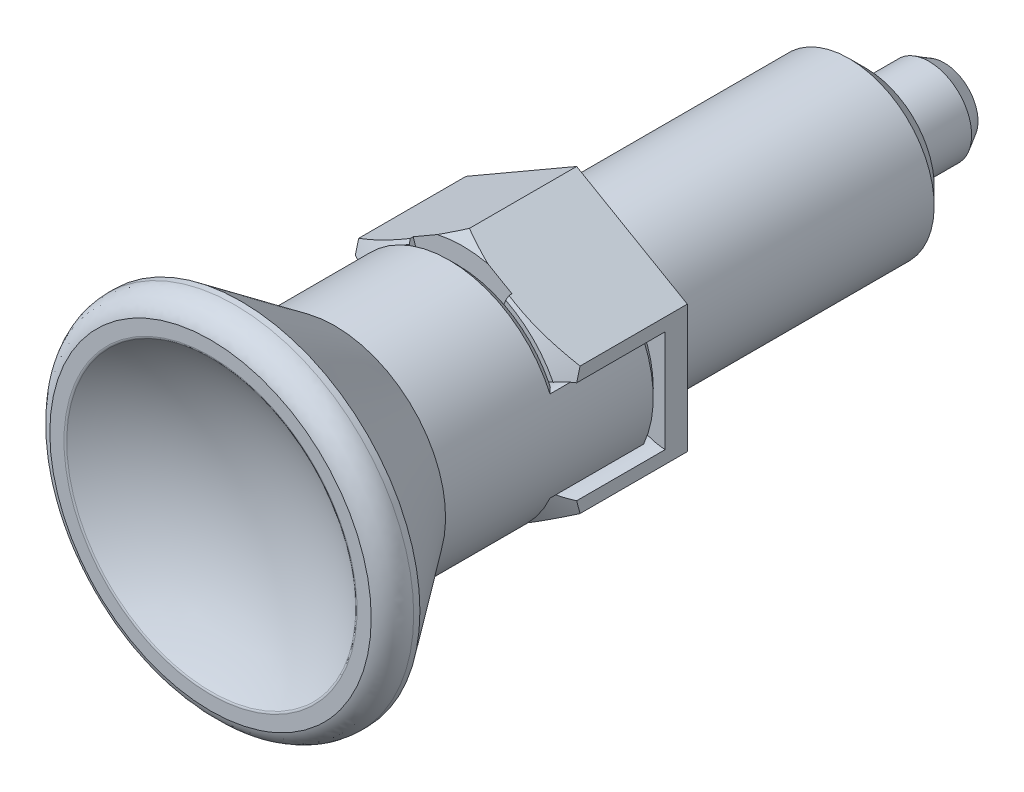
ISO-10303-21;
HEADER;
FILE_DESCRIPTION(('STEP AP214'),'2;1');
FILE_NAME('part.step','',(''),(''),'','','');
FILE_SCHEMA(('AUTOMOTIVE_DESIGN { 1 0 10303 214 1 1 1 1 }'));
ENDSEC;
DATA;
#1=APPLICATION_CONTEXT('core data for automotive mechanical design processes');
#2=APPLICATION_PROTOCOL_DEFINITION('international standard','automotive_design',2000,#1);
#3=PRODUCT_CONTEXT('',#1,'mechanical');
#4=PRODUCT('Part','Part','',(#3));
#5=PRODUCT_RELATED_PRODUCT_CATEGORY('part','',(#4));
#6=PRODUCT_DEFINITION_FORMATION('','',#4);
#7=PRODUCT_DEFINITION_CONTEXT('part definition',#1,'design');
#8=PRODUCT_DEFINITION('design','',#6,#7);
#9=PRODUCT_DEFINITION_SHAPE('','',#8);
#10=(LENGTH_UNIT() NAMED_UNIT(*) SI_UNIT(.MILLI.,.METRE.));
#11=(NAMED_UNIT(*) PLANE_ANGLE_UNIT() SI_UNIT($,.RADIAN.));
#12=(NAMED_UNIT(*) SI_UNIT($,.STERADIAN.) SOLID_ANGLE_UNIT());
#13=UNCERTAINTY_MEASURE_WITH_UNIT(LENGTH_MEASURE(1.E-05),#10,'distance_accuracy_value','');
#14=(GEOMETRIC_REPRESENTATION_CONTEXT(3) GLOBAL_UNCERTAINTY_ASSIGNED_CONTEXT((#13)) GLOBAL_UNIT_ASSIGNED_CONTEXT((#10,
#11,#12)) REPRESENTATION_CONTEXT('',''));
#15=CARTESIAN_POINT('',(0.,0.,0.));
#16=DIRECTION('',(0.,0.,1.));
#17=DIRECTION('',(1.,0.,0.));
#18=AXIS2_PLACEMENT_3D('',#15,#16,#17);
#19=CARTESIAN_POINT('',(-3.10947441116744,-3.10947441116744,-17.));
#20=DIRECTION('',(0.,0.,-1.));
#21=DIRECTION('',(0.,1.,0.));
#22=AXIS2_PLACEMENT_3D('',#19,#20,#21);
#23=PLANE('',#22);
#24=CARTESIAN_POINT('',(0.,0.,-17.));
#25=DIRECTION('',(0.,0.,1.));
#26=DIRECTION('',(0.,1.,0.));
#27=AXIS2_PLACEMENT_3D('',#24,#25,#26);
#28=CIRCLE('',#27,2.6);
#29=CARTESIAN_POINT('',(0.,2.6,-17.));
#30=VERTEX_POINT('',#29);
#31=EDGE_CURVE('E24',#30,#30,#28,.T.);
#32=ORIENTED_EDGE('',*,*,#31,.T.);
#33=EDGE_LOOP('',(#32));
#34=FACE_BOUND('',#33,.T.);
#35=CARTESIAN_POINT('',(0.,0.,-17.));
#36=DIRECTION('',(0.,0.,-1.));
#37=DIRECTION('',(0.,1.,0.));
#38=AXIS2_PLACEMENT_3D('',#35,#36,#37);
#39=CIRCLE('',#38,4.);
#40=CARTESIAN_POINT('',(0.,4.,-17.));
#41=VERTEX_POINT('',#40);
#42=EDGE_CURVE('E1102',#41,#41,#39,.T.);
#43=ORIENTED_EDGE('',*,*,#42,.T.);
#44=EDGE_LOOP('',(#43));
#45=FACE_BOUND('',#44,.T.);
#46=ADVANCED_FACE('F14',(#34,#45),#23,.T.);
#47=CARTESIAN_POINT('',(0.,2.6,-17.));
#48=CARTESIAN_POINT('',(0.,2.4,-17.));
#49=CARTESIAN_POINT('',(0.,2.4,-17.2));
#50=CARTESIAN_POINT('',(4.50333209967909,2.6,-17.));
#51=CARTESIAN_POINT('',(4.1569219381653,2.4,-17.));
#52=CARTESIAN_POINT('',(4.15692193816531,2.4,-17.2));
#53=CARTESIAN_POINT('',(2.25166604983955,-1.3,-17.));
#54=CARTESIAN_POINT('',(2.07846096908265,-1.2,-17.));
#55=CARTESIAN_POINT('',(2.07846096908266,-1.2,-17.2));
#56=CARTESIAN_POINT('',(0.,-5.2,-17.));
#57=CARTESIAN_POINT('',(0.,-4.8,-17.));
#58=CARTESIAN_POINT('',(0.,-4.8,-17.2));
#59=CARTESIAN_POINT('',(-2.25166604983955,-1.3,-17.));
#60=CARTESIAN_POINT('',(-2.07846096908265,-1.2,-17.));
#61=CARTESIAN_POINT('',(-2.07846096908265,-1.2,-17.2));
#62=CARTESIAN_POINT('',(-4.50333209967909,2.6,-17.));
#63=CARTESIAN_POINT('',(-4.1569219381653,2.4,-17.));
#64=CARTESIAN_POINT('',(-4.15692193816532,2.4,-17.2));
#65=CARTESIAN_POINT('',(0.,2.6,-17.));
#66=CARTESIAN_POINT('',(0.,2.4,-17.));
#67=CARTESIAN_POINT('',(0.,2.4,-17.2));
#68=(BOUNDED_SURFACE() B_SPLINE_SURFACE(2,2,((#47,#48,#49),(#50,#51,#52),(#53,#54,#55),(#56,#57,
#58),(#59,#60,#61),(#62,#63,#64),(#65,#66,#67)),.UNSPECIFIED.,.T.,.F.,
.F.) B_SPLINE_SURFACE_WITH_KNOTS((3,2,2,3),(3,3),(0.,21.2919156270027,42.5838312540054,
63.8757468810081),(0.,1.),
.UNSPECIFIED.) GEOMETRIC_REPRESENTATION_ITEM() RATIONAL_B_SPLINE_SURFACE(((1.,0.707106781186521,
1.),(0.5,0.353553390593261,0.5),(1.,0.707106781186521,1.),(0.5,0.353553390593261,0.5),(1.,
0.707106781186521,1.),(0.5,0.353553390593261,0.5),(1.,0.707106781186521,1.))) REPRESENTATION_ITEM('') SURFACE());
#69=CARTESIAN_POINT('',(0.,0.,-17.2));
#70=DIRECTION('',(0.,0.,1.));
#71=DIRECTION('',(0.,1.,0.));
#72=AXIS2_PLACEMENT_3D('',#69,#70,#71);
#73=CIRCLE('',#72,2.4);
#74=CARTESIAN_POINT('',(0.,2.4,-17.2));
#75=VERTEX_POINT('',#74);
#76=EDGE_CURVE('E750',#75,#75,#73,.T.);
#77=CARTESIAN_POINT('',(0.,2.6,-17.));
#78=CARTESIAN_POINT('',(0.,2.59852014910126,-16.9999999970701));
#79=CARTESIAN_POINT('',(0.,2.59704029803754,-17.000016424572));
#80=CARTESIAN_POINT('',(0.,2.59406802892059,-17.0000824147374));
#81=CARTESIAN_POINT('',(0.,2.59257561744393,-17.0001322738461));
#82=CARTESIAN_POINT('',(0.,2.58957919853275,-17.0002659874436));
#83=CARTESIAN_POINT('',(0.,2.5880752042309,-17.0003501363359));
#84=CARTESIAN_POINT('',(0.,2.58505664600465,-17.0005532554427));
#85=CARTESIAN_POINT('',(0.,2.58354210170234,-17.0006725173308));
#86=CARTESIAN_POINT('',(0.,2.58050352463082,-17.0009466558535));
#87=CARTESIAN_POINT('',(0.,2.57897951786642,-17.0011018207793));
#88=CARTESIAN_POINT('',(0.,2.57592315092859,-17.0014485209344));
#89=CARTESIAN_POINT('',(0.,2.57439082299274,-17.0016403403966));
#90=CARTESIAN_POINT('',(0.,2.57131900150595,-17.0020610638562));
#91=CARTESIAN_POINT('',(0.,2.56977954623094,-17.0022902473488));
#92=CARTESIAN_POINT('',(0.,2.56669470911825,-17.0027863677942));
#93=CARTESIAN_POINT('',(0.,2.56514937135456,-17.0030535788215));
#94=CARTESIAN_POINT('',(0.,2.5620540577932,-17.0036263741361));
#95=CARTESIAN_POINT('',(0.,2.56050413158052,-17.003932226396));
#96=CARTESIAN_POINT('',(0.,2.55740097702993,-17.0045828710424));
#97=CARTESIAN_POINT('',(0.,2.55584780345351,-17.004927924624));
#98=CARTESIAN_POINT('',(0.,2.55273953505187,-17.0056574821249));
#99=CARTESIAN_POINT('',(0.,2.55118449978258,-17.006042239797));
#100=CARTESIAN_POINT('',(0.,2.54807393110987,-17.0068516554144));
#101=CARTESIAN_POINT('',(0.,2.54651846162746,-17.0072765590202));
#102=CARTESIAN_POINT('',(0.,2.54340848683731,-17.0081666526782));
#103=CARTESIAN_POINT('',(0.,2.54185404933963,-17.0086320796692));
#104=CARTESIAN_POINT('',(0.,2.5387476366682,-17.0096035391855));
#105=CARTESIAN_POINT('',(0.,2.53719573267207,-17.0101097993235));
#106=CARTESIAN_POINT('',(0.,2.53409591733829,-17.011163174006));
#107=CARTESIAN_POINT('',(0.,2.53254807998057,-17.0117105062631));
#108=CARTESIAN_POINT('',(0.,2.52945795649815,-17.0128462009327));
#109=CARTESIAN_POINT('',(0.,2.52791574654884,-17.0134347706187));
#110=CARTESIAN_POINT('',(0.,2.52483846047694,-17.0146530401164));
#111=CARTESIAN_POINT('',(0.,2.52330346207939,-17.0152829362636));
#112=CARTESIAN_POINT('',(0.,2.520242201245,-17.0165838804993));
#113=CARTESIAN_POINT('',(0.,2.51871601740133,-17.017255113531));
#114=CARTESIAN_POINT('',(0.,2.51567400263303,-17.0186386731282));
#115=CARTESIAN_POINT('',(0.,2.51415825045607,-17.0193511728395));
#116=CARTESIAN_POINT('',(0.,2.51113872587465,-17.0208171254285));
#117=CARTESIAN_POINT('',(0.,2.50963503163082,-17.0215707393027));
#118=CARTESIAN_POINT('',(0.,2.50664125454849,-17.0231186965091));
#119=CARTESIAN_POINT('',(0.,2.50515124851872,-17.0239131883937));
#120=CARTESIAN_POINT('',(0.,2.5021864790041,-17.0255425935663));
#121=CARTESIAN_POINT('',(0.,2.5007117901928,-17.0263776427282));
#122=CARTESIAN_POINT('',(0.,2.49777928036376,-17.0280877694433));
#123=CARTESIAN_POINT('',(0.,2.49632153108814,-17.0289629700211));
#124=CARTESIAN_POINT('',(0.,2.49342451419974,-17.0307529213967));
#125=CARTESIAN_POINT('',(0.,2.49198531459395,-17.0316677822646));
#126=CARTESIAN_POINT('',(0.,2.48912699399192,-17.0335364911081));
#127=CARTESIAN_POINT('',(0.,2.48770793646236,-17.0344904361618));
#128=CARTESIAN_POINT('',(0.,2.48489147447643,-17.0364366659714));
#129=CARTESIAN_POINT('',(0.,2.48349412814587,-17.0374290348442));
#130=CARTESIAN_POINT('',(0.,2.48072263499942,-17.039451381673));
#131=CARTESIAN_POINT('',(0.,2.47934854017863,-17.0404814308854));
#132=CARTESIAN_POINT('',(0.,2.4766250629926,-17.0425783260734));
#133=CARTESIAN_POINT('',(0.,2.47527572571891,-17.0436452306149));
#134=CARTESIAN_POINT('',(0.,2.47260323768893,-17.045814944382));
#135=CARTESIAN_POINT('',(0.,2.47128012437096,-17.0469177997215));
#136=CARTESIAN_POINT('',(0.,2.46866151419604,-17.04915844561));
#137=CARTESIAN_POINT('',(0.,2.46736604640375,-17.0502962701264));
#138=CARTESIAN_POINT('',(0.,2.46480410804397,-17.05260581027));
#139=CARTESIAN_POINT('',(0.,2.46353765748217,-17.0537775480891));
#140=CARTESIAN_POINT('',(0.,2.46103508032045,-17.0561537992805));
#141=CARTESIAN_POINT('',(0.,2.45979896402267,-17.0573583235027));
#142=CARTESIAN_POINT('',(0.,2.45735832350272,-17.0597989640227));
#143=CARTESIAN_POINT('',(0.,2.45615379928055,-17.0610350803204));
#144=CARTESIAN_POINT('',(0.,2.45377754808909,-17.0635376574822));
#145=CARTESIAN_POINT('',(0.,2.45260581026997,-17.064804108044));
#146=CARTESIAN_POINT('',(0.,2.45029627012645,-17.0673660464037));
#147=CARTESIAN_POINT('',(0.,2.44915844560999,-17.068661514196));
#148=CARTESIAN_POINT('',(0.,2.44691779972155,-17.0712801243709));
#149=CARTESIAN_POINT('',(0.,2.44581494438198,-17.0726032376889));
#150=CARTESIAN_POINT('',(0.,2.44364523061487,-17.0752757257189));
#151=CARTESIAN_POINT('',(0.,2.44257832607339,-17.0766250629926));
#152=CARTESIAN_POINT('',(0.,2.44048143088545,-17.0793485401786));
#153=CARTESIAN_POINT('',(0.,2.43945138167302,-17.0807226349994));
#154=CARTESIAN_POINT('',(0.,2.43742903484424,-17.0834941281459));
#155=CARTESIAN_POINT('',(0.,2.43643666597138,-17.0848914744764));
#156=CARTESIAN_POINT('',(0.,2.4344904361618,-17.0877079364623));
#157=CARTESIAN_POINT('',(0.,2.43353649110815,-17.0891269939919));
#158=CARTESIAN_POINT('',(0.,2.43166778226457,-17.0919853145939));
#159=CARTESIAN_POINT('',(0.,2.4307529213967,-17.0934245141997));
#160=CARTESIAN_POINT('',(0.,2.42896297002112,-17.0963215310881));
#161=CARTESIAN_POINT('',(0.,2.42808776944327,-17.0977792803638));
#162=CARTESIAN_POINT('',(0.,2.42637764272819,-17.1007117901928));
#163=CARTESIAN_POINT('',(0.,2.42554259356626,-17.1021864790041));
#164=CARTESIAN_POINT('',(0.,2.42391318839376,-17.1051512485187));
#165=CARTESIAN_POINT('',(0.,2.42311869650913,-17.1066412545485));
#166=CARTESIAN_POINT('',(0.,2.42157073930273,-17.1096350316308));
#167=CARTESIAN_POINT('',(0.,2.4208171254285,-17.1111387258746));
#168=CARTESIAN_POINT('',(0.,2.41935117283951,-17.1141582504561));
#169=CARTESIAN_POINT('',(0.,2.41863867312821,-17.115674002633));
#170=CARTESIAN_POINT('',(0.,2.41725511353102,-17.1187160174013));
#171=CARTESIAN_POINT('',(0.,2.41658388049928,-17.120242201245));
#172=CARTESIAN_POINT('',(0.,2.41528293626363,-17.1233034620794));
#173=CARTESIAN_POINT('',(0.,2.41465304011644,-17.1248384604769));
#174=CARTESIAN_POINT('',(0.,2.41343477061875,-17.1279157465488));
#175=CARTESIAN_POINT('',(0.,2.41284620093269,-17.1294579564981));
#176=CARTESIAN_POINT('',(0.,2.41171050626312,-17.1325480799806));
#177=CARTESIAN_POINT('',(0.,2.41116317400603,-17.1340959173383));
#178=CARTESIAN_POINT('',(0.,2.41010979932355,-17.1371957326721));
#179=CARTESIAN_POINT('',(0.,2.4096035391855,-17.1387476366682));
#180=CARTESIAN_POINT('',(0.,2.4086320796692,-17.1418540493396));
#181=CARTESIAN_POINT('',(0.,2.40816665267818,-17.1434084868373));
#182=CARTESIAN_POINT('',(0.,2.40727655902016,-17.1465184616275));
#183=CARTESIAN_POINT('',(0.,2.40685165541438,-17.1480739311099));
#184=CARTESIAN_POINT('',(0.,2.40604223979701,-17.1511844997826));
#185=CARTESIAN_POINT('',(0.,2.40565748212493,-17.1527395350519));
#186=CARTESIAN_POINT('',(0.,2.40492792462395,-17.1558478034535));
#187=CARTESIAN_POINT('',(0.,2.40458287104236,-17.1574009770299));
#188=CARTESIAN_POINT('',(0.,2.40393222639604,-17.1605041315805));
#189=CARTESIAN_POINT('',(0.,2.40362637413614,-17.1620540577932));
#190=CARTESIAN_POINT('',(0.,2.40305357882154,-17.1651493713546));
#191=CARTESIAN_POINT('',(0.,2.40278636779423,-17.1666947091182));
#192=CARTESIAN_POINT('',(0.,2.40229024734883,-17.1697795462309));
#193=CARTESIAN_POINT('',(0.,2.40206106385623,-17.1713190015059));
#194=CARTESIAN_POINT('',(0.,2.40164034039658,-17.1743908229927));
#195=CARTESIAN_POINT('',(0.,2.40144852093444,-17.1759231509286));
#196=CARTESIAN_POINT('',(0.,2.40110182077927,-17.1789795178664));
#197=CARTESIAN_POINT('',(0.,2.40094665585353,-17.1805035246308));
#198=CARTESIAN_POINT('',(0.,2.40067251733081,-17.1835421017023));
#199=CARTESIAN_POINT('',(0.,2.40055325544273,-17.1850566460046));
#200=CARTESIAN_POINT('',(0.,2.4003501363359,-17.1880752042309));
#201=CARTESIAN_POINT('',(0.,2.40026598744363,-17.1895791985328));
#202=CARTESIAN_POINT('',(0.,2.40013227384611,-17.1925756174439));
#203=CARTESIAN_POINT('',(0.,2.40008241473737,-17.1940680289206));
#204=CARTESIAN_POINT('',(0.,2.40001642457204,-17.1970402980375));
#205=CARTESIAN_POINT('',(0.,2.39999999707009,-17.1985201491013));
#206=CARTESIAN_POINT('',(0.,2.4,-17.2));
#207=B_SPLINE_CURVE_WITH_KNOTS('',3,(#77,#78,#79,#80,#81,#82,#83,#84,#85,#86,#87,#88,#89,#90,
#91,#92,#93,#94,#95,#96,#97,#98,#99,#100,#101,#102,#103,#104,#105,#106,#107,#108,#109,#110,#111,
#112,#113,#114,#115,#116,#117,#118,#119,#120,#121,#122,#123,#124,#125,#126,#127,#128,#129,#130,
#131,#132,#133,#134,#135,#136,#137,#138,#139,#140,#141,#142,#143,#144,#145,#146,#147,#148,#149,
#150,#151,#152,#153,#154,#155,#156,#157,#158,#159,#160,#161,#162,#163,#164,#165,#166,#167,#168,
#169,#170,#171,#172,#173,#174,#175,#176,#177,#178,#179,#180,#181,#182,#183,#184,#185,#186,#187,
#188,#189,#190,#191,#192,#193,#194,#195,#196,#197,#198,#199,#200,#201,#202,#203,#204,#205,#206),
.UNSPECIFIED.,.F.,.F.,(4,2,2,2,2,2,2,2,2,2,2,2,2,2,2,2,2,2,2,2,2,2,2,2,2,2,2,2,2,2,2,2,2,2,2,2,
2,2,2,2,2,2,2,2,2,2,2,2,2,2,2,2,2,2,2,2,2,2,2,2,2,2,2,2,4),(0.,0.00443946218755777,
0.00891881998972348,0.0134374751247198,0.0179947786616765,0.022590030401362,0.0272224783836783,
0.031891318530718,0.036595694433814,0.041334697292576,0.0461073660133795,0.0509126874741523,
0.0557495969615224,0.0606169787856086,0.0655136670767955,0.0704384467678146,0.0753900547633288,
0.0803671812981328,0.0853684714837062,0.0903925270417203,0.095437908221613,0.100503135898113,
0.105586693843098,0.110687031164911,0.11580256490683,0.120931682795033,0.126072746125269,
0.131224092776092,0.136384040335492,0.141550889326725,0.146722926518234,0.151898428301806,
0.157075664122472,0.162252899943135,0.16742840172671,0.172600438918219,0.177767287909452,
0.182927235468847,0.188078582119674,0.193219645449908,0.198348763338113,0.203464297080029,
0.208564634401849,0.213648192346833,0.218713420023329,0.223758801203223,0.228782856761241,
0.23378414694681,0.238761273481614,0.243712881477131,0.248637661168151,0.253534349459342,
0.258401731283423,0.263238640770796,0.268043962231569,0.272816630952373,0.277555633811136,
0.28226000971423,0.286928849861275,0.291561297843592,0.296156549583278,0.300713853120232,
0.305232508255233,0.309711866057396,0.314151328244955),.UNSPECIFIED.);
#208=EDGE_CURVE('BSEAM816',#30,#75,#207,.T.);
#209=ORIENTED_EDGE('',*,*,#31,.F.);
#210=ORIENTED_EDGE('',*,*,#76,.T.);
#211=ORIENTED_EDGE('',*,*,#208,.T.);
#212=ORIENTED_EDGE('',*,*,#208,.F.);
#213=EDGE_LOOP('',(#209,#211,#210,#212));
#214=FACE_BOUND('',#213,.T.);
#215=ADVANCED_FACE('F816',(#214),#68,.T.);
#216=CARTESIAN_POINT('',(0.,0.,-17.2));
#217=DIRECTION('',(0.,0.,-1.));
#218=DIRECTION('',(0.,1.,0.));
#219=AXIS2_PLACEMENT_3D('',#216,#217,#218);
#220=CYLINDRICAL_SURFACE('',#219,2.4);
#221=ORIENTED_EDGE('',*,*,#76,.F.);
#222=EDGE_LOOP('',(#221));
#223=FACE_BOUND('',#222,.T.);
#224=CARTESIAN_POINT('',(0.,0.,-17.2732050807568));
#225=DIRECTION('',(0.,0.,1.));
#226=DIRECTION('',(0.,1.,0.));
#227=AXIS2_PLACEMENT_3D('',#224,#225,#226);
#228=CIRCLE('',#227,2.4);
#229=CARTESIAN_POINT('',(0.,2.4,-17.2732050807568));
#230=VERTEX_POINT('',#229);
#231=EDGE_CURVE('E754',#230,#230,#228,.T.);
#232=ORIENTED_EDGE('',*,*,#231,.T.);
#233=EDGE_LOOP('',(#232));
#234=FACE_BOUND('',#233,.T.);
#235=ADVANCED_FACE('F807',(#223,#234),#220,.T.);
#236=CARTESIAN_POINT('',(0.,2.4,-17.2732050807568));
#237=CARTESIAN_POINT('',(0.,2.40000000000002,-17.3267949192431));
#238=CARTESIAN_POINT('',(0.,2.42679491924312,-17.3732050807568));
#239=CARTESIAN_POINT('',(4.15692193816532,2.4,-17.2732050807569));
#240=CARTESIAN_POINT('',(4.15692193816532,2.40000000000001,-17.3267949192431));
#241=CARTESIAN_POINT('',(4.20333209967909,2.42679491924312,-17.3732050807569));
#242=CARTESIAN_POINT('',(2.07846096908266,-1.2,-17.2732050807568));
#243=CARTESIAN_POINT('',(2.07846096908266,-1.2,-17.3267949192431));
#244=CARTESIAN_POINT('',(2.10166604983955,-1.21339745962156,-17.3732050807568));
#245=CARTESIAN_POINT('',(0.,-4.8,-17.2732050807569));
#246=CARTESIAN_POINT('',(0.,-4.80000000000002,-17.3267949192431));
#247=CARTESIAN_POINT('',(0.,-4.85358983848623,-17.3732050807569));
#248=CARTESIAN_POINT('',(-2.07846096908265,-1.2,-17.2732050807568));
#249=CARTESIAN_POINT('',(-2.07846096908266,-1.2,-17.3267949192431));
#250=CARTESIAN_POINT('',(-2.10166604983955,-1.21339745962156,-17.3732050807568));
#251=CARTESIAN_POINT('',(-4.15692193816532,2.4,-17.2732050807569));
#252=CARTESIAN_POINT('',(-4.15692193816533,2.40000000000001,-17.3267949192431));
#253=CARTESIAN_POINT('',(-4.20333209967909,2.42679491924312,-17.3732050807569));
#254=CARTESIAN_POINT('',(0.,2.4,-17.2732050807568));
#255=CARTESIAN_POINT('',(0.,2.40000000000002,-17.3267949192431));
#256=CARTESIAN_POINT('',(0.,2.42679491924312,-17.3732050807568));
#257=(BOUNDED_SURFACE() B_SPLINE_SURFACE(2,2,((#236,#237,#238),(#239,#240,#241),(#242,#243,
#244),(#245,#246,#247),(#248,#249,#250),(#251,#252,#253),(#254,#255,#256)),.UNSPECIFIED.,.T.,
.F.,.F.) B_SPLINE_SURFACE_WITH_KNOTS((3,2,2,3),(3,3),(0.,77.7894783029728,155.578956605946,
233.368434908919),(0.,1.),
.UNSPECIFIED.) GEOMETRIC_REPRESENTATION_ITEM() RATIONAL_B_SPLINE_SURFACE(((1.,0.965925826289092,
1.),(0.5,0.482962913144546,0.5),(1.,0.965925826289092,1.),(0.5,0.482962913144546,0.5),(1.,
0.965925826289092,1.),(0.5,0.482962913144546,0.5),(1.,0.965925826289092,1.))) REPRESENTATION_ITEM('') SURFACE());
#258=CARTESIAN_POINT('',(0.,0.,-17.3732050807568));
#259=DIRECTION('',(0.,0.,1.));
#260=DIRECTION('',(0.,1.,0.));
#261=AXIS2_PLACEMENT_3D('',#258,#259,#260);
#262=CIRCLE('',#261,2.42679491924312);
#263=CARTESIAN_POINT('',(0.,2.42679491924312,-17.3732050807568));
#264=VERTEX_POINT('',#263);
#265=EDGE_CURVE('E758',#264,#264,#262,.T.);
#266=CARTESIAN_POINT('',(0.,2.4,-17.2732050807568));
#267=CARTESIAN_POINT('',(0.,2.39999999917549,-17.2742846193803));
#268=CARTESIAN_POINT('',(0.,2.40000874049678,-17.2753641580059));
#269=CARTESIAN_POINT('',(0.,2.4000437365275,-17.2775251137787));
#270=CARTESIAN_POINT('',(0.,2.40007002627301,-17.2786065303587));
#271=CARTESIAN_POINT('',(0.,2.40014021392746,-17.2807708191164));
#272=CARTESIAN_POINT('',(0.,2.40018414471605,-17.2818536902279));
#273=CARTESIAN_POINT('',(0.,2.40028969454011,-17.2840204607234));
#274=CARTESIAN_POINT('',(0.,2.40035134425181,-17.2851043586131));
#275=CARTESIAN_POINT('',(0.,2.40049239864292,-17.2872727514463));
#276=CARTESIAN_POINT('',(0.,2.40057183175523,-17.2883572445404));
#277=CARTESIAN_POINT('',(0.,2.40074850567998,-17.290526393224));
#278=CARTESIAN_POINT('',(0.,2.40084577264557,-17.2916110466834));
#279=CARTESIAN_POINT('',(0.,2.40105815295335,-17.2937800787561));
#280=CARTESIAN_POINT('',(0.,2.40117329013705,-17.294864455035));
#281=CARTESIAN_POINT('',(0.,2.40142143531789,-17.297032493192));
#282=CARTESIAN_POINT('',(0.,2.40155446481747,-17.2981161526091));
#283=CARTESIAN_POINT('',(0.,2.40183840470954,-17.300282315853));
#284=CARTESIAN_POINT('',(0.,2.40198933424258,-17.301364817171));
#285=CARTESIAN_POINT('',(0.,2.4023090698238,-17.3035282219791));
#286=CARTESIAN_POINT('',(0.,2.4024778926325,-17.3046091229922));
#287=CARTESIAN_POINT('',(0.,2.40283339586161,-17.3067688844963));
#288=CARTESIAN_POINT('',(0.,2.40302009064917,-17.3078477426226));
#289=CARTESIAN_POINT('',(0.,2.40341130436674,-17.3100029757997));
#290=CARTESIAN_POINT('',(0.,2.40361583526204,-17.3110793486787));
#291=CARTESIAN_POINT('',(0.,2.40404267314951,-17.3132291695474));
#292=CARTESIAN_POINT('',(0.,2.4042649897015,-17.3143026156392));
#293=CARTESIAN_POINT('',(0.,2.40472733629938,-17.3164461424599));
#294=CARTESIAN_POINT('',(0.,2.40496737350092,-17.3175162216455));
#295=CARTESIAN_POINT('',(0.,2.4054650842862,-17.3196525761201));
#296=CARTESIAN_POINT('',(0.,2.40572276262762,-17.3207188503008));
#297=CARTESIAN_POINT('',(0.,2.40625566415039,-17.322847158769));
#298=CARTESIAN_POINT('',(0.,2.40653088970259,-17.323909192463));
#299=CARTESIAN_POINT('',(0.,2.4070987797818,-17.3260285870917));
#300=CARTESIAN_POINT('',(0.,2.40739144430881,-17.3270859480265));
#301=CARTESIAN_POINT('',(0.,2.40799409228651,-17.3291955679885));
#302=CARTESIAN_POINT('',(0.,2.40830407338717,-17.3302478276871));
#303=CARTESIAN_POINT('',(0.,2.4089412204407,-17.3323468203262));
#304=CARTESIAN_POINT('',(0.,2.40926838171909,-17.3333935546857));
#305=CARTESIAN_POINT('',(0.,2.40993974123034,-17.3354810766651));
#306=CARTESIAN_POINT('',(0.,2.4102839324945,-17.3365218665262));
#307=CARTESIAN_POINT('',(0.,2.41098919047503,-17.3385970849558));
#308=CARTESIAN_POINT('',(0.,2.41135024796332,-17.3396315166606));
#309=CARTESIAN_POINT('',(0.,2.41208906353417,-17.3416936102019));
#310=CARTESIAN_POINT('',(0.,2.41246681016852,-17.3427212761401));
#311=CARTESIAN_POINT('',(0.,2.41323881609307,-17.3447694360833));
#312=CARTESIAN_POINT('',(0.,2.4136330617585,-17.3457899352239));
#313=CARTESIAN_POINT('',(0.,2.41443786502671,-17.347823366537));
#314=CARTESIAN_POINT('',(0.,2.41484840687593,-17.3488363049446));
#315=CARTESIAN_POINT('',(0.,2.41568558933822,-17.3508542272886));
#316=CARTESIAN_POINT('',(0.,2.41611221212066,-17.3518592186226));
#317=CARTESIAN_POINT('',(0.,2.41698133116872,-17.3538608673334));
#318=CARTESIAN_POINT('',(0.,2.41742380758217,-17.35485753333));
#319=CARTESIAN_POINT('',(0.,2.41832439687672,-17.3568421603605));
#320=CARTESIAN_POINT('',(0.,2.41878248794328,-17.3578301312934));
#321=CARTESIAN_POINT('',(0.,2.41971405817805,-17.3597970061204));
#322=CARTESIAN_POINT('',(0.,2.42018751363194,-17.3607759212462));
#323=CARTESIAN_POINT('',(0.,2.42114955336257,-17.3627243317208));
#324=CARTESIAN_POINT('',(0.,2.42163811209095,-17.3636938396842));
#325=CARTESIAN_POINT('',(0.,2.42263008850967,-17.3656230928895));
#326=CARTESIAN_POINT('',(0.,2.42313347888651,-17.3665828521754));
#327=CARTESIAN_POINT('',(0.,2.42415483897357,-17.3684922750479));
#328=CARTESIAN_POINT('',(0.,2.4246727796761,-17.369441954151));
#329=CARTESIAN_POINT('',(0.,2.42572295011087,-17.3713308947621));
#330=CARTESIAN_POINT('',(0.,2.42625514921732,-17.3722701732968));
#331=CARTESIAN_POINT('',(0.,2.42679491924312,-17.3732050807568));
#332=B_SPLINE_CURVE_WITH_KNOTS('',3,(#266,#267,#268,#269,#270,#271,#272,#273,#274,#275,#276,
#277,#278,#279,#280,#281,#282,#283,#284,#285,#286,#287,#288,#289,#290,#291,#292,#293,#294,#295,
#296,#297,#298,#299,#300,#301,#302,#303,#304,#305,#306,#307,#308,#309,#310,#311,#312,#313,#314,
#315,#316,#317,#318,#319,#320,#321,#322,#323,#324,#325,#326,#327,#328,#329,#330,#331),
.UNSPECIFIED.,.F.,.F.,(4,2,2,2,2,2,2,2,2,2,2,2,2,2,2,2,2,2,2,2,2,2,2,2,2,2,2,2,2,2,2,2,4),(0.,
0.00323858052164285,0.00648364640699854,0.00973478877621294,0.0129915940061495,
0.0162536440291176,0.0195205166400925,0.0227917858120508,0.0260670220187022,0.02934579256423,
0.0326276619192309,0.035912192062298,0.0391989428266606,0.0424874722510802,0.0457773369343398,
0.0490680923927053,0.0523592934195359,0.0556504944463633,0.0589412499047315,0.0622311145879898,
0.06551964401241,0.0688063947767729,0.0720909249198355,0.0753727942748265,0.0786515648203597,
0.0819268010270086,0.0851980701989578,0.0884649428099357,0.0917269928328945,0.0949837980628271,
0.0982349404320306,0.101480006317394,0.104718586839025),.UNSPECIFIED.);
#333=EDGE_CURVE('BSEAM801',#230,#264,#332,.T.);
#334=ORIENTED_EDGE('',*,*,#231,.F.);
#335=ORIENTED_EDGE('',*,*,#265,.T.);
#336=ORIENTED_EDGE('',*,*,#333,.T.);
#337=ORIENTED_EDGE('',*,*,#333,.F.);
#338=EDGE_LOOP('',(#334,#336,#335,#337));
#339=FACE_BOUND('',#338,.T.);
#340=ADVANCED_FACE('F801',(#339),#257,.T.);
#341=CARTESIAN_POINT('',(0.,0.,-17.3732050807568));
#342=DIRECTION('',(0.,0.,-1.));
#343=DIRECTION('',(0.,1.,0.));
#344=AXIS2_PLACEMENT_3D('',#341,#342,#343);
#345=CONICAL_SURFACE('',#344,2.42679491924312,0.523598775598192);
#346=ORIENTED_EDGE('',*,*,#265,.F.);
#347=EDGE_LOOP('',(#346));
#348=FACE_BOUND('',#347,.T.);
#349=CARTESIAN_POINT('',(0.,0.,-17.5));
#350=DIRECTION('',(0.,0.,1.));
#351=DIRECTION('',(0.,1.,0.));
#352=AXIS2_PLACEMENT_3D('',#349,#350,#351);
#353=CIRCLE('',#352,2.5);
#354=CARTESIAN_POINT('',(0.,2.5,-17.5));
#355=VERTEX_POINT('',#354);
#356=EDGE_CURVE('E762',#355,#355,#353,.T.);
#357=ORIENTED_EDGE('',*,*,#356,.T.);
#358=EDGE_LOOP('',(#357));
#359=FACE_BOUND('',#358,.T.);
#360=ADVANCED_FACE('F794',(#348,#359),#345,.T.);
#361=CARTESIAN_POINT('',(0.,0.,-17.5));
#362=DIRECTION('',(0.,0.,-1.));
#363=DIRECTION('',(0.,1.,0.));
#364=AXIS2_PLACEMENT_3D('',#361,#362,#363);
#365=CYLINDRICAL_SURFACE('',#364,2.5);
#366=ORIENTED_EDGE('',*,*,#356,.F.);
#367=EDGE_LOOP('',(#366));
#368=FACE_BOUND('',#367,.T.);
#369=CARTESIAN_POINT('',(0.,0.,-20.7));
#370=DIRECTION('',(0.,0.,1.));
#371=DIRECTION('',(0.,1.,0.));
#372=AXIS2_PLACEMENT_3D('',#369,#370,#371);
#373=CIRCLE('',#372,2.5);
#374=CARTESIAN_POINT('',(0.,2.5,-20.7));
#375=VERTEX_POINT('',#374);
#376=EDGE_CURVE('E766',#375,#375,#373,.T.);
#377=ORIENTED_EDGE('',*,*,#376,.T.);
#378=EDGE_LOOP('',(#377));
#379=FACE_BOUND('',#378,.T.);
#380=ADVANCED_FACE('F788',(#368,#379),#365,.T.);
#381=CARTESIAN_POINT('',(0.,0.,-21.588122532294));
#382=DIRECTION('',(0.,0.,1.));
#383=DIRECTION('',(0.,1.,0.));
#384=AXIS2_PLACEMENT_3D('',#381,#382,#383);
#385=CONICAL_SURFACE('',#384,1.9872422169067,0.523598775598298);
#386=ORIENTED_EDGE('',*,*,#376,.F.);
#387=EDGE_LOOP('',(#386));
#388=FACE_BOUND('',#387,.T.);
#389=CARTESIAN_POINT('',(0.,0.,-21.588122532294));
#390=DIRECTION('',(0.,0.,1.));
#391=DIRECTION('',(0.,1.,0.));
#392=AXIS2_PLACEMENT_3D('',#389,#390,#391);
#393=CIRCLE('',#392,1.9872422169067);
#394=CARTESIAN_POINT('',(0.,1.9872422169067,-21.588122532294));
#395=VERTEX_POINT('',#394);
#396=EDGE_CURVE('E746',#395,#395,#393,.T.);
#397=ORIENTED_EDGE('',*,*,#396,.T.);
#398=EDGE_LOOP('',(#397));
#399=FACE_BOUND('',#398,.T.);
#400=ADVANCED_FACE('F777',(#388,#399),#385,.T.);
#401=CARTESIAN_POINT('',(0.,0.,-17.));
#402=DIRECTION('',(0.,0.,-1.));
#403=DIRECTION('',(0.,1.,0.));
#404=AXIS2_PLACEMENT_3D('',#401,#402,#403);
#405=SPHERICAL_SURFACE('',#404,5.);
#406=ORIENTED_EDGE('',*,*,#396,.F.);
#407=EDGE_LOOP('',(#406));
#408=FACE_BOUND('',#407,.T.);
#409=ADVANCED_FACE('F16',(#408),#405,.T.);
#410=CARTESIAN_POINT('',(0.,1.28703991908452E-09,32.599147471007));
#411=DIRECTION('',(0.,0.,-1.));
#412=DIRECTION('',(-1.74532925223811E-06,0.999999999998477,0.));
#413=AXIS2_PLACEMENT_3D('',#410,#411,#412);
#414=SPHERICAL_SURFACE('',#413,14.0000000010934);
#415=CARTESIAN_POINT('',(0.,-4.8919202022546E-13,21.4645927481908));
#416=DIRECTION('',(0.,0.,1.));
#417=DIRECTION('',(-1.74532925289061E-06,0.999999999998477,0.));
#418=AXIS2_PLACEMENT_3D('',#415,#416,#417);
#419=CIRCLE('',#418,8.48655944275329);
#420=CARTESIAN_POINT('',(-1.48118404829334E-05,8.48655944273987,21.464592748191));
#421=VERTEX_POINT('',#420);
#422=EDGE_CURVE('E606',#421,#421,#419,.T.);
#423=ORIENTED_EDGE('',*,*,#422,.T.);
#424=EDGE_LOOP('',(#423));
#425=FACE_BOUND('',#424,.T.);
#426=ADVANCED_FACE('F780',(#425),#414,.F.);
#427=CARTESIAN_POINT('',(-1.48118404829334E-05,8.48655944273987,21.464592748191));
#428=CARTESIAN_POINT('',(-1.49049371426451E-05,8.53989989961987,21.5066671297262));
#429=CARTESIAN_POINT('',(-1.50234382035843E-05,8.60779600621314,21.5055276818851));
#430=CARTESIAN_POINT('',(14.6991373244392,8.48658509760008,21.464592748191));
#431=CARTESIAN_POINT('',(14.7915256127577,8.53992571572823,21.5066671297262));
#432=CARTESIAN_POINT('',(14.9091250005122,8.60782202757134,21.505527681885));
#433=CARTESIAN_POINT('',(7.34958347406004,-4.24326689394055,21.4645927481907));
#434=CARTESIAN_POINT('',(7.39577771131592,-4.26993704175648,21.506667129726));
#435=CARTESIAN_POINT('',(7.45457752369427,-4.30388499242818,21.5055276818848));
#436=CARTESIAN_POINT('',(2.96236808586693E-05,-16.9731188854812,21.4645927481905));
#437=CARTESIAN_POINT('',(2.98098741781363E-05,-17.0797997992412,21.5066671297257));
#438=CARTESIAN_POINT('',(3.00468763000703E-05,-17.2155920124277,21.5055276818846));
#439=CARTESIAN_POINT('',(-7.34956866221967,-4.24329254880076,21.4645927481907));
#440=CARTESIAN_POINT('',(-7.39576280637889,-4.26996285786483,21.506667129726));
#441=CARTESIAN_POINT('',(-7.45456250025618,-4.30391101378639,21.5055276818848));
#442=CARTESIAN_POINT('',(-14.6991669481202,8.48653378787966,21.464592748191));
#443=CARTESIAN_POINT('',(-14.791555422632,8.53987408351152,21.5066671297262));
#444=CARTESIAN_POINT('',(-14.9091550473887,8.60776998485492,21.505527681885));
#445=CARTESIAN_POINT('',(-1.48118404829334E-05,8.48655944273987,21.464592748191));
#446=CARTESIAN_POINT('',(-1.49049371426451E-05,8.53989989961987,21.5066671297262));
#447=CARTESIAN_POINT('',(-1.50234382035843E-05,8.60779600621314,21.5055276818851));
#448=(BOUNDED_SURFACE() B_SPLINE_SURFACE(2,2,((#427,#428,#429),(#430,#431,#432),(#433,#434,
#435),(#436,#437,#438),(#439,#440,#441),(#442,#443,#444),(#445,#446,#447)),.UNSPECIFIED.,.T.,
.F.,.F.) B_SPLINE_SURFACE_WITH_KNOTS((3,2,2,3),(3,3),(0.,217.869655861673,435.739311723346,
653.60896758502),(0.,1.),
.UNSPECIFIED.) GEOMETRIC_REPRESENTATION_ITEM() RATIONAL_B_SPLINE_SURFACE(((1.,0.946908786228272,
1.),(0.5,0.473454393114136,0.5),(1.,0.946908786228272,1.),(0.5,0.473454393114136,0.5),(1.,
0.946908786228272,1.),(0.5,0.473454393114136,0.5),(1.,0.946908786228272,1.))) REPRESENTATION_ITEM('') SURFACE());
#449=CARTESIAN_POINT('',(0.,-4.77048955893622E-13,21.5055276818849));
#450=DIRECTION('',(0.,0.,-1.));
#451=DIRECTION('',(-1.74532925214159E-06,0.999999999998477,0.));
#452=AXIS2_PLACEMENT_3D('',#449,#450,#451);
#453=CIRCLE('',#452,8.60779600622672);
#454=CARTESIAN_POINT('',(-1.50234382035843E-05,8.60779600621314,21.5055276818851));
#455=VERTEX_POINT('',#454);
#456=EDGE_CURVE('E611',#455,#455,#453,.T.);
#457=CARTESIAN_POINT('',(-1.48118404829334E-05,8.48655944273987,21.464592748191));
#458=CARTESIAN_POINT('',(-1.48136794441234E-05,8.48761308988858,21.465423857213));
#459=CARTESIAN_POINT('',(-1.48155335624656E-05,8.48867542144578,21.4662439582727));
#460=CARTESIAN_POINT('',(-1.48192760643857E-05,8.49081971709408,21.4678637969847));
#461=CARTESIAN_POINT('',(-1.4821164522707E-05,8.49190172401,21.4686634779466));
#462=CARTESIAN_POINT('',(-1.48249748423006E-05,8.49408487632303,21.4702417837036));
#463=CARTESIAN_POINT('',(-1.48268967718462E-05,8.49518606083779,21.4710203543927));
#464=CARTESIAN_POINT('',(-1.483077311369E-05,8.49740704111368,21.4725557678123));
#465=CARTESIAN_POINT('',(-1.4832727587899E-05,8.49852687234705,21.4733125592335));
#466=CARTESIAN_POINT('',(-1.48366680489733E-05,8.50078459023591,21.4748037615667));
#467=CARTESIAN_POINT('',(-1.48386540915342E-05,8.5019225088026,21.4755381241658));
#468=CARTESIAN_POINT('',(-1.4842656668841E-05,8.50421581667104,21.4769838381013));
#469=CARTESIAN_POINT('',(-1.4844673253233E-05,8.50537123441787,21.4776951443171));
#470=CARTESIAN_POINT('',(-1.48487358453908E-05,8.50769892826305,21.4790941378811));
#471=CARTESIAN_POINT('',(-1.48507818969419E-05,8.50887122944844,21.4797817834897));
#472=CARTESIAN_POINT('',(-1.48549023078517E-05,8.51123205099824,21.4811328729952));
#473=CARTESIAN_POINT('',(-1.48569767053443E-05,8.51242059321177,21.4817962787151));
#474=CARTESIAN_POINT('',(-1.48611526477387E-05,8.51481323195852,21.4830983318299));
#475=CARTESIAN_POINT('',(-1.48632542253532E-05,8.51601734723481,21.4837369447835));
#476=CARTESIAN_POINT('',(-1.48674833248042E-05,8.51844044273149,21.4849888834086));
#477=CARTESIAN_POINT('',(-1.4869610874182E-05,8.51965943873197,21.4856021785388));
#478=CARTESIAN_POINT('',(-1.4873890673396E-05,8.52211158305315,21.4868029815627));
#479=CARTESIAN_POINT('',(-1.48760429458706E-05,8.52334474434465,21.4873904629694));
#480=CARTESIAN_POINT('',(-1.48803709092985E-05,8.52582448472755,21.4885391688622));
#481=CARTESIAN_POINT('',(-1.48825466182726E-05,8.52707107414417,21.4891003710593));
#482=CARTESIAN_POINT('',(-1.48869201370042E-05,8.52957691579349,21.4901960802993));
#483=CARTESIAN_POINT('',(-1.4889117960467E-05,8.53083617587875,21.4907305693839));
#484=CARTESIAN_POINT('',(-1.48935343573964E-05,8.53336658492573,21.4917724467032));
#485=CARTESIAN_POINT('',(-1.48957529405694E-05,8.53463773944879,21.4922798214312));
#486=CARTESIAN_POINT('',(-1.49002094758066E-05,8.53719114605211,21.4932670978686));
#487=CARTESIAN_POINT('',(-1.49024474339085E-05,8.53847340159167,21.4937469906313));
#488=CARTESIAN_POINT('',(-1.49069413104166E-05,8.54104820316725,21.4946789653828));
#489=CARTESIAN_POINT('',(-1.49091972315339E-05,8.54234075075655,21.4951310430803));
#490=CARTESIAN_POINT('',(-1.49137256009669E-05,8.5449353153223,21.4960070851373));
#491=CARTESIAN_POINT('',(-1.49159980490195E-05,8.54623733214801,21.4964310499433));
#492=CARTESIAN_POINT('',(-1.49205580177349E-05,8.54885000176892,21.4972505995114));
#493=CARTESIAN_POINT('',(-1.4922845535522E-05,8.55016065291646,21.4976461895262));
#494=CARTESIAN_POINT('',(-1.49274341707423E-05,8.55278974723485,21.4984087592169));
#495=CARTESIAN_POINT('',(-1.49297352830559E-05,8.55410818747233,21.4987757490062));
#496=CARTESIAN_POINT('',(-1.49343496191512E-05,8.55675200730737,21.4994809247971));
#497=CARTESIAN_POINT('',(-1.49366628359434E-05,8.55807738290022,21.4998191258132));
#498=CARTESIAN_POINT('',(-1.49412998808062E-05,8.5607342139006,21.5004665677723));
#499=CARTESIAN_POINT('',(-1.49436237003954E-05,8.56206566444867,21.5007758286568));
#500=CARTESIAN_POINT('',(-1.49482804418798E-05,8.56473378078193,21.5013652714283));
#501=CARTESIAN_POINT('',(-1.4950613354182E-05,8.56607044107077,21.5016454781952));
#502=CARTESIAN_POINT('',(-1.49552867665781E-05,8.56874810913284,21.5021767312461));
#503=CARTESIAN_POINT('',(-1.4957627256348E-05,8.57008911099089,21.5024278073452));
#504=CARTESIAN_POINT('',(-1.4962314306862E-05,8.57277459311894,21.5029007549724));
#505=CARTESIAN_POINT('',(-1.49646608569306E-05,8.5741190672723,21.5031226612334));
#506=CARTESIAN_POINT('',(-1.49693585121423E-05,8.57681062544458,21.5035372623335));
#507=CARTESIAN_POINT('',(-1.49717096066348E-05,8.57815770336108,21.5037299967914));
#508=CARTESIAN_POINT('',(-1.49764148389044E-05,8.58085360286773,21.5040862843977));
#509=CARTESIAN_POINT('',(-1.49787689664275E-05,8.58220241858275,21.5042498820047));
#510=CARTESIAN_POINT('',(-1.49834787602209E-05,8.58490093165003,21.5045479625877));
#511=CARTESIAN_POINT('',(-1.49858344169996E-05,8.58625062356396,21.504682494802));
#512=CARTESIAN_POINT('',(-1.49905457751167E-05,8.58895003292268,21.5049225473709));
#513=CARTESIAN_POINT('',(-1.49929014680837E-05,8.59029974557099,21.5050281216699));
#514=CARTESIAN_POINT('',(-1.49976114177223E-05,8.59299834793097,21.5052103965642));
#515=CARTESIAN_POINT('',(-1.49999656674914E-05,8.59434723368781,21.5052871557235));
#516=CARTESIAN_POINT('',(-1.50046712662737E-05,8.59704334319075,21.5054119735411));
#517=CARTESIAN_POINT('',(-1.50070226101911E-05,8.59839056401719,21.5054600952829));
#518=CARTESIAN_POINT('',(-1.50117209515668E-05,8.60108251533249,21.5055278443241));
#519=CARTESIAN_POINT('',(-1.50140679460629E-05,8.60242724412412,21.5055475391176));
#520=CARTESIAN_POINT('',(-1.50187561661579E-05,8.60511339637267,21.5055586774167));
#521=CARTESIAN_POINT('',(-1.50210973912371E-05,8.60645481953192,21.5055501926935));
#522=CARTESIAN_POINT('',(-1.50234382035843E-05,8.60779600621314,21.5055276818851));
#523=B_SPLINE_CURVE_WITH_KNOTS('',3,(#457,#458,#459,#460,#461,#462,#463,#464,#465,#466,#467,
#468,#469,#470,#471,#472,#473,#474,#475,#476,#477,#478,#479,#480,#481,#482,#483,#484,#485,#486,
#487,#488,#489,#490,#491,#492,#493,#494,#495,#496,#497,#498,#499,#500,#501,#502,#503,#504,#505,
#506,#507,#508,#509,#510,#511,#512,#513,#514,#515,#516,#517,#518,#519,#520,#521,#522),
.UNSPECIFIED.,.F.,.F.,(4,2,2,2,2,2,2,2,2,2,2,2,2,2,2,2,2,2,2,2,2,2,2,2,2,2,2,2,2,2,2,2,4),(0.,
0.00402587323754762,0.00806191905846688,0.0121074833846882,0.0161619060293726,
0.0202245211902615,0.0242946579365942,0.0283716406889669,0.0324547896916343,0.0365434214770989,
0.0406368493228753,0.0447343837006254,0.0488353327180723,0.0529390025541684,0.0570446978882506,
0.0611517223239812,0.0652593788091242,0.0693669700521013,0.0734737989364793,0.0775791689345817,
0.0816823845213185,0.0857827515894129,0.0898795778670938,0.0939721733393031,0.0980598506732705,
0.10214192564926,0.106217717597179,0.110286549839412,0.114347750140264,0.118400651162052,
0.122444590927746,0.126478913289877,0.130502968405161),.UNSPECIFIED.);
#524=EDGE_CURVE('BSEAM787',#421,#455,#523,.T.);
#525=ORIENTED_EDGE('',*,*,#422,.F.);
#526=ORIENTED_EDGE('',*,*,#456,.F.);
#527=ORIENTED_EDGE('',*,*,#524,.T.);
#528=ORIENTED_EDGE('',*,*,#524,.F.);
#529=EDGE_LOOP('',(#525,#527,#526,#528));
#530=FACE_BOUND('',#529,.T.);
#531=ADVANCED_FACE('F787',(#530),#448,.T.);
#532=CARTESIAN_POINT('',(10.3840181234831,-10.3839818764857,21.5055276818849));
#533=DIRECTION('',(0.,0.,1.));
#534=DIRECTION('',(-1.74532925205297E-06,0.999999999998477,0.));
#535=AXIS2_PLACEMENT_3D('',#532,#533,#534);
#536=PLANE('',#535);
#537=CARTESIAN_POINT('',(0.,-4.77048955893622E-13,21.5055276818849));
#538=DIRECTION('',(0.,0.,-1.));
#539=DIRECTION('',(-1.74532925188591E-06,0.999999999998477,0.));
#540=AXIS2_PLACEMENT_3D('',#537,#538,#539);
#541=CIRCLE('',#540,9.44);
#542=CARTESIAN_POINT('',(-1.64759081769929E-05,9.43999999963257,21.505527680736));
#543=VERTEX_POINT('',#542);
#544=EDGE_CURVE('E619',#543,#543,#541,.T.);
#545=ORIENTED_EDGE('',*,*,#544,.F.);
#546=EDGE_LOOP('',(#545));
#547=FACE_BOUND('',#546,.T.);
#548=ORIENTED_EDGE('',*,*,#456,.T.);
#549=EDGE_LOOP('',(#548));
#550=FACE_BOUND('',#549,.T.);
#551=ADVANCED_FACE('F1586',(#547,#550),#536,.T.);
#552=CARTESIAN_POINT('',(-1.64759081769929E-05,9.43999999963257,21.505527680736));
#553=CARTESIAN_POINT('',(-1.83259571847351E-05,10.4999999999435,21.1802870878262));
#554=CARTESIAN_POINT('',(-1.83259571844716E-05,10.4999999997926,20.0715123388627));
#555=CARTESIAN_POINT('',(16.3505431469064,9.44002853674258,21.505527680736));
#556=CARTESIAN_POINT('',(18.186515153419,10.5000317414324,21.1802870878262));
#557=CARTESIAN_POINT('',(18.1865151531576,10.5000317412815,20.0715123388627));
#558=CARTESIAN_POINT('',(8.17528804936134,-4.719985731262,21.5055276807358));
#559=CARTESIAN_POINT('',(9.09327590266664,-5.24998412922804,21.1802870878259));
#560=CARTESIAN_POINT('',(9.09327590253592,-5.24998412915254,20.0715123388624));
#561=CARTESIAN_POINT('',(3.29518162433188E-05,-18.8799999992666,21.5055276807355));
#562=CARTESIAN_POINT('',(3.66519142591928E-05,-20.9999999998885,21.1802870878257));
#563=CARTESIAN_POINT('',(3.66519142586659E-05,-20.9999999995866,20.0715123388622));
#564=CARTESIAN_POINT('',(-8.17527157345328,-4.720014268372,21.5055276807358));
#565=CARTESIAN_POINT('',(-9.09325757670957,-5.25001587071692,21.1802870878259));
#566=CARTESIAN_POINT('',(-9.09325757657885,-5.25001587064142,20.0715123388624));
#567=CARTESIAN_POINT('',(-16.3505760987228,9.43997146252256,21.505527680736));
#568=CARTESIAN_POINT('',(-18.1865518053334,10.4999682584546,21.1802870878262));
#569=CARTESIAN_POINT('',(-18.186551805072,10.4999682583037,20.0715123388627));
#570=CARTESIAN_POINT('',(-1.64759081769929E-05,9.43999999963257,21.505527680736));
#571=CARTESIAN_POINT('',(-1.83259571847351E-05,10.4999999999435,21.1802870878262));
#572=CARTESIAN_POINT('',(-1.83259571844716E-05,10.4999999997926,20.0715123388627));
#573=(BOUNDED_SURFACE() B_SPLINE_SURFACE(2,2,((#552,#553,#554),(#555,#556,#557),(#558,#559,
#560),(#561,#562,#563),(#564,#565,#566),(#567,#568,#569),(#570,#571,#572)),.UNSPECIFIED.,.T.,
.F.,.F.) B_SPLINE_SURFACE_WITH_KNOTS((3,2,2,3),(3,3),(0.,15.9434687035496,31.8869374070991,
47.8304061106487),(0.,1.),
.UNSPECIFIED.) GEOMETRIC_REPRESENTATION_ITEM() RATIONAL_B_SPLINE_SURFACE(((1.,0.804155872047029,
1.),(0.5,0.402077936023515,0.5),(1.,0.804155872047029,1.),(0.5,0.402077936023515,0.5),(1.,
0.804155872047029,1.),(0.5,0.402077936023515,0.5),(1.,0.804155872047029,1.))) REPRESENTATION_ITEM('') SURFACE());
#574=CARTESIAN_POINT('',(0.,-4.54497550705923E-13,20.0715123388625));
#575=DIRECTION('',(0.,0.,-1.));
#576=DIRECTION('',(-1.74532925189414E-06,0.999999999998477,0.));
#577=AXIS2_PLACEMENT_3D('',#574,#575,#576);
#578=CIRCLE('',#577,10.499999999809);
#579=CARTESIAN_POINT('',(-1.83259571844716E-05,10.4999999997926,20.0715123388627));
#580=VERTEX_POINT('',#579);
#581=EDGE_CURVE('E626',#580,#580,#578,.T.);
#582=CARTESIAN_POINT('',(-1.64759081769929E-05,9.43999999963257,21.505527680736));
#583=CARTESIAN_POINT('',(-1.64836685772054E-05,9.44444638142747,21.5041633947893));
#584=CARTESIAN_POINT('',(-1.64914179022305E-05,9.44888641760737,21.5027784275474));
#585=CARTESIAN_POINT('',(-1.6506917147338E-05,9.45776683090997,21.4999629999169));
#586=CARTESIAN_POINT('',(-1.65146669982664E-05,9.46220716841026,21.4985324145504));
#587=CARTESIAN_POINT('',(-1.65301661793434E-05,9.47108754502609,21.495625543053));
#588=CARTESIAN_POINT('',(-1.65379154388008E-05,9.47552754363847,21.4941491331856));
#589=CARTESIAN_POINT('',(-1.65534123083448E-05,9.48440659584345,21.4911504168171));
#590=CARTESIAN_POINT('',(-1.65611598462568E-05,9.48884560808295,21.4896279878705));
#591=CARTESIAN_POINT('',(-1.65766521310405E-05,9.49772203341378,21.4865370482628));
#592=CARTESIAN_POINT('',(-1.65843968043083E-05,9.50215940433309,21.4849684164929));
#593=CARTESIAN_POINT('',(-1.65998822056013E-05,9.51103188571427,21.4817848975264));
#594=CARTESIAN_POINT('',(-1.66076228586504E-05,9.51546695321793,21.4801698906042));
#595=CARTESIAN_POINT('',(-1.66230990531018E-05,9.5243341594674,21.4768934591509));
#596=CARTESIAN_POINT('',(-1.6630834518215E-05,9.52876625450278,21.4752319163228));
#597=CARTESIAN_POINT('',(-1.66462991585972E-05,9.53762684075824,21.4718622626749));
#598=CARTESIAN_POINT('',(-1.66540282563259E-05,9.542055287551,21.4701540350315));
#599=CARTESIAN_POINT('',(-1.66694789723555E-05,9.55090789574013,21.4666908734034));
#600=CARTESIAN_POINT('',(-1.6677200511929E-05,9.55533201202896,21.464935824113));
#601=CARTESIAN_POINT('',(-1.66926349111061E-05,9.56417527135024,21.461378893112));
#602=CARTESIAN_POINT('',(-1.67003476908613E-05,9.56859436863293,21.4595768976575));
#603=CARTESIAN_POINT('',(-1.67157633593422E-05,9.57742689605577,21.4559259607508));
#604=CARTESIAN_POINT('',(-1.67234661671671E-05,9.58184027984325,21.4540769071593));
#605=CARTESIAN_POINT('',(-1.67388606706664E-05,9.59066068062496,21.4503317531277));
#606=CARTESIAN_POINT('',(-1.67465522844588E-05,9.59506765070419,21.448435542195));
#607=CARTESIAN_POINT('',(-1.67619231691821E-05,9.60387451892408,21.4445959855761));
#608=CARTESIAN_POINT('',(-1.67696023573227E-05,9.60827436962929,21.4426525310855));
#609=CARTESIAN_POINT('',(-1.67849471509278E-05,9.61706628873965,21.4387184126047));
#610=CARTESIAN_POINT('',(-1.67926126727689E-05,9.621458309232,21.4367276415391));
#611=CARTESIAN_POINT('',(-1.68079288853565E-05,9.63023385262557,21.432698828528));
#612=CARTESIAN_POINT('',(-1.68155794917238E-05,9.634617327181,21.4306606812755));
#613=CARTESIAN_POINT('',(-1.68308646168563E-05,9.64337505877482,21.4265370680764));
#614=CARTESIAN_POINT('',(-1.6838499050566E-05,9.64774926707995,21.4244514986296));
#615=CARTESIAN_POINT('',(-1.68537505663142E-05,9.65648774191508,21.4202330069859));
#616=CARTESIAN_POINT('',(-1.68613675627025E-05,9.66085195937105,21.4180999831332));
#617=CARTESIAN_POINT('',(-1.687658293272E-05,9.66956972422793,21.4137865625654));
#618=CARTESIAN_POINT('',(-1.68841812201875E-05,9.67392322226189,21.4116060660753));
#619=CARTESIAN_POINT('',(-1.68993578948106E-05,9.68261881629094,21.4071976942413));
#620=CARTESIAN_POINT('',(-1.69069361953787E-05,9.68696086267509,21.4049697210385));
#621=CARTESIAN_POINT('',(-1.69220716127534E-05,9.69563281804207,21.4004664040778));
#622=CARTESIAN_POINT('',(-1.69296286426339E-05,9.69996267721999,21.3981909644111));
#623=CARTESIAN_POINT('',(-1.69447202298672E-05,9.7086095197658,21.3935927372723));
#624=CARTESIAN_POINT('',(-1.69522547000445E-05,9.71292645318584,21.3912698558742));
#625=CARTESIAN_POINT('',(-1.69672998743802E-05,9.7215467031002,21.3865767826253));
#626=CARTESIAN_POINT('',(-1.69748104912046E-05,9.72584996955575,21.3842064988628));
#627=CARTESIAN_POINT('',(-1.69898066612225E-05,9.73444214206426,21.3794186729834));
#628=CARTESIAN_POINT('',(-1.69972921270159E-05,9.73873099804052,21.3770010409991));
#629=CARTESIAN_POINT('',(-1.70122366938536E-05,9.74729360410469,21.3721185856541));
#630=CARTESIAN_POINT('',(-1.70196957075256E-05,9.75156730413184,21.369653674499));
#631=CARTESIAN_POINT('',(-1.70345860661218E-05,9.76009885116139,21.3646767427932));
#632=CARTESIAN_POINT('',(-1.70420173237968E-05,9.76435664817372,21.3621646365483));
#633=CARTESIAN_POINT('',(-1.70568508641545E-05,9.77285564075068,21.3570934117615));
#634=CARTESIAN_POINT('',(-1.70642530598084E-05,9.77709678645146,21.3545342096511));
#635=CARTESIAN_POINT('',(-1.7079027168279E-05,9.78556172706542,21.3493689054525));
#636=CARTESIAN_POINT('',(-1.70863989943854E-05,9.78978547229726,21.3467627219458));
#637=CARTESIAN_POINT('',(-1.71011110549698E-05,9.79821486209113,21.3415035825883));
#638=CARTESIAN_POINT('',(-1.71084512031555E-05,9.80242045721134,21.3388505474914));
#639=CARTESIAN_POINT('',(-1.71230985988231E-05,9.81081279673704,21.3334978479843));
#640=CARTESIAN_POINT('',(-1.71304057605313E-05,9.81499949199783,21.3307981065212));
#641=CARTESIAN_POINT('',(-1.71449858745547E-05,9.82335328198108,21.3253521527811));
#642=CARTESIAN_POINT('',(-1.71522587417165E-05,9.8275203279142,21.3226058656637));
#643=CARTESIAN_POINT('',(-1.71667689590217E-05,9.83583407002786,21.3170669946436));
#644=CARTESIAN_POINT('',(-1.71740062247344E-05,9.8399807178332,21.3142743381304));
#645=CARTESIAN_POINT('',(-1.71884439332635E-05,9.84825291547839,21.3086429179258));
#646=CARTESIAN_POINT('',(-1.71956442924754E-05,9.85237841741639,21.3058040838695));
#647=CARTESIAN_POINT('',(-1.72100068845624E-05,9.86060757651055,21.3000805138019));
#648=CARTESIAN_POINT('',(-1.72171690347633E-05,9.86471118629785,21.2971957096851));
#649=CARTESIAN_POINT('',(-1.72314539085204E-05,9.8728958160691,21.291380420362));
#650=CARTESIAN_POINT('',(-1.72385765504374E-05,9.87697678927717,21.2884498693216));
#651=CARTESIAN_POINT('',(-1.72527811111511E-05,9.8851154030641,21.2825433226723));
#652=CARTESIAN_POINT('',(-1.72598629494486E-05,9.88917299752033,21.2795672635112));
#653=CARTESIAN_POINT('',(-1.72739846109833E-05,9.89726411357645,21.2735699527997));
#654=CARTESIAN_POINT('',(-1.72810243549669E-05,9.9012975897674,21.270548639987));
#655=CARTESIAN_POINT('',(-1.72950605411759E-05,9.90933973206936,21.2644610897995));
#656=CARTESIAN_POINT('',(-1.73020569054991E-05,9.91334835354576,21.2613947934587));
#657=CARTESIAN_POINT('',(-1.73160050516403E-05,9.92134005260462,21.2552175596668));
#658=CARTESIAN_POINT('',(-1.73229567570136E-05,9.92532308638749,21.2521065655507));
#659=CARTESIAN_POINT('',(-1.73368143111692E-05,9.93326288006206,21.2458402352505));
#660=CARTESIAN_POINT('',(-1.73437200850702E-05,9.93721959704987,21.2426848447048));
#661=CARTESIAN_POINT('',(-1.73574845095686E-05,9.9451060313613,21.2363300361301));
#662=CARTESIAN_POINT('',(-1.73643430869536E-05,9.94903570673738,21.2331305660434));
#663=CARTESIAN_POINT('',(-1.73780118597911E-05,9.95686733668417,21.2266879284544));
#664=CARTESIAN_POINT('',(-1.73848219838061E-05,9.96076925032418,21.2234447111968));
#665=CARTESIAN_POINT('',(-1.73983926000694E-05,9.9685446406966,21.2169149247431));
#666=CARTESIAN_POINT('',(-1.74051530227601E-05,9.97241807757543,21.2136283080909));
#667=CARTESIAN_POINT('',(-1.74186229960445E-05,9.98013580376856,21.2070120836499));
#668=CARTESIAN_POINT('',(-1.74253324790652E-05,9.9839800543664,21.2036824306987));
#669=CARTESIAN_POINT('',(-1.74386993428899E-05,9.99163870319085,21.1969805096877));
#670=CARTESIAN_POINT('',(-1.74453566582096E-05,9.99545306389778,21.193608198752));
#671=CARTESIAN_POINT('',(-1.7458617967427E-05,10.0030512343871,21.1868213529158));
#672=CARTESIAN_POINT('',(-1.74652218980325E-05,10.0068350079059,21.1834067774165));
#673=CARTESIAN_POINT('',(-1.74783752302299E-05,10.01437131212,21.1765358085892));
#674=CARTESIAN_POINT('',(-1.74849245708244E-05,10.0181238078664,21.173079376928));
#675=CARTESIAN_POINT('',(-1.74979675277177E-05,10.0255968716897,21.1661251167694));
#676=CARTESIAN_POINT('',(-1.75044610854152E-05,10.0293174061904,21.1626272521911));
#677=CARTESIAN_POINT('',(-1.75173912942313E-05,10.0367258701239,21.1555905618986));
#678=CARTESIAN_POINT('',(-1.75238278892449E-05,10.0404137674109,21.1520517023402));
#679=CARTESIAN_POINT('',(-1.75366430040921E-05,10.0477562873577,21.1449334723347));
#680=CARTESIAN_POINT('',(-1.75430214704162E-05,10.051410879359,21.1413540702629));
#681=CARTESIAN_POINT('',(-1.75557191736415E-05,10.0586861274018,21.1341552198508));
#682=CARTESIAN_POINT('',(-1.75620383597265E-05,10.0623067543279,21.130535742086));
#683=CARTESIAN_POINT('',(-1.75746163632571E-05,10.0695134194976,21.123257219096));
#684=CARTESIAN_POINT('',(-1.75808751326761E-05,10.073099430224,21.1195981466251));
#685=CARTESIAN_POINT('',(-1.75933311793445E-05,10.0802362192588,21.1122409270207));
#686=CARTESIAN_POINT('',(-1.75995284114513E-05,10.0837869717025,21.1085427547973));
#687=CARTESIAN_POINT('',(-1.76118602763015E-05,10.0908526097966,21.1011078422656));
#688=CARTESIAN_POINT('',(-1.76179948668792E-05,10.0943674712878,21.0973710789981));
#689=CARTESIAN_POINT('',(-1.76302003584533E-05,10.1013607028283,21.0898595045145));
#690=CARTESIAN_POINT('',(-1.76362712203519E-05,10.1048390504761,21.0860846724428));
#691=CARTESIAN_POINT('',(-1.76483481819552E-05,10.1117586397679,21.0784974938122));
#692=CARTESIAN_POINT('',(-1.76543542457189E-05,10.1151998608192,21.0746851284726));
#693=CARTESIAN_POINT('',(-1.76663005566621E-05,10.1220445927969,21.0670234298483));
#694=CARTESIAN_POINT('',(-1.76722407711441E-05,10.1254480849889,21.0631740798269));
#695=CARTESIAN_POINT('',(-1.76840543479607E-05,10.1322167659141,21.055438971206));
#696=CARTESIAN_POINT('',(-1.76899276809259E-05,10.1355819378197,21.0515531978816));
#697=CARTESIAN_POINT('',(-1.77016064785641E-05,10.142273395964,21.0437458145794));
#698=CARTESIAN_POINT('',(-1.77074119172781E-05,10.1455996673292,21.0398241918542));
#699=CARTESIAN_POINT('',(-1.77189539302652E-05,10.1522127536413,21.0319456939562));
#700=CARTESIAN_POINT('',(-1.77246904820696E-05,10.1554995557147,21.0279888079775));
#701=CARTESIAN_POINT('',(-1.77360937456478E-05,10.1620331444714,21.020040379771));
#702=CARTESIAN_POINT('',(-1.77417604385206E-05,10.1652799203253,21.0160488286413));
#703=CARTESIAN_POINT('',(-1.77530230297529E-05,10.171732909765,21.0080316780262));
#704=CARTESIAN_POINT('',(-1.77586189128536E-05,10.174939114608,21.0040060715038));
#705=CARTESIAN_POINT('',(-1.77697389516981E-05,10.1813104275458,20.9959214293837));
#706=CARTESIAN_POINT('',(-1.77752630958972E-05,10.184475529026,20.9918623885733));
#707=CARTESIAN_POINT('',(-1.77862387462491E-05,10.1907641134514,20.9837115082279));
#708=CARTESIAN_POINT('',(-1.77916902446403E-05,10.1938875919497,20.9796196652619));
#709=CARTESIAN_POINT('',(-1.780251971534E-05,10.2000924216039,20.9714038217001));
#710=CARTESIAN_POINT('',(-1.78078976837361E-05,10.2031737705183,20.9672798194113));
#711=CARTESIAN_POINT('',(-1.78185792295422E-05,10.2092938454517,20.959000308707));
#712=CARTESIAN_POINT('',(-1.78238828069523E-05,10.2123325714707,20.9548448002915));
#713=CARTESIAN_POINT('',(-1.78344147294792E-05,10.2183669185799,20.9465029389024));
#714=CARTESIAN_POINT('',(-1.78396430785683E-05,10.2213625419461,20.9423165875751));
#715=CARTESIAN_POINT('',(-1.78500237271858E-05,10.2273102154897,20.9339137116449));
#716=CARTESIAN_POINT('',(-1.78551760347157E-05,10.2302622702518,20.9296971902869));
#717=CARTESIAN_POINT('',(-1.78654038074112E-05,10.2361223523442,20.9212346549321));
#718=CARTESIAN_POINT('',(-1.78704792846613E-05,10.2390303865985,20.9169886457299));
#719=CARTESIAN_POINT('',(-1.78805526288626E-05,10.2448019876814,20.9084678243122));
#720=CARTESIAN_POINT('',(-1.78855505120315E-05,10.2476655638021,20.9041930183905));
#721=CARTESIAN_POINT('',(-1.78954679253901E-05,10.2533478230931,20.8956153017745));
#722=CARTESIAN_POINT('',(-1.79003874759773E-05,10.2561665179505,20.8913123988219));
#723=CARTESIAN_POINT('',(-1.791014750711E-05,10.2617586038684,20.8826791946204));
#724=CARTESIAN_POINT('',(-1.79149880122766E-05,10.2645320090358,20.8783489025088));
#725=CARTESIAN_POINT('',(-1.79245892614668E-05,10.2700331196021,20.8696616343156));
#726=CARTESIAN_POINT('',(-1.79293500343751E-05,10.2727608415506,20.8653046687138));
#727=CARTESIAN_POINT('',(-1.79387911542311E-05,10.2781702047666,20.8565647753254));
#728=CARTESIAN_POINT('',(-1.79434715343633E-05,10.2808518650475,20.8521818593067));
#729=CARTESIAN_POINT('',(-1.79527512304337E-05,10.2861687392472,20.8433907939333));
#730=CARTESIAN_POINT('',(-1.79573505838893E-05,10.288803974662,20.8389826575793));
#731=CARTESIAN_POINT('',(-1.79664676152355E-05,10.2940276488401,20.8301418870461));
#732=CARTESIAN_POINT('',(-1.79709853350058E-05,10.2966161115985,20.8257092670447));
#733=CARTESIAN_POINT('',(-1.79799385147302E-05,10.3017459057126,20.8168202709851));
#734=CARTESIAN_POINT('',(-1.79843740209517E-05,10.3042872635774,20.8123639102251));
#735=CARTESIAN_POINT('',(-1.79931622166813E-05,10.3093225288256,20.8034281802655));
#736=CARTESIAN_POINT('',(-1.79975149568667E-05,10.3118164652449,20.7989488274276));
#737=CARTESIAN_POINT('',(-1.80061370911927E-05,10.3167565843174,20.7899678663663));
#738=CARTESIAN_POINT('',(-1.80104065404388E-05,10.3192027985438,20.7854662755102));
#739=CARTESIAN_POINT('',(-1.80188615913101E-05,10.3240471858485,20.7764415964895));
#740=CARTESIAN_POINT('',(-1.80230472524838E-05,10.3264453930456,20.7719185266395));
#741=CARTESIAN_POINT('',(-1.80313342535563E-05,10.3311934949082,20.7628516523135));
#742=CARTESIAN_POINT('',(-1.80354356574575E-05,10.3335434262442,20.7583078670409));
#743=CARTESIAN_POINT('',(-1.80435536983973E-05,10.3381947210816,20.7492003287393));
#744=CARTESIAN_POINT('',(-1.80475704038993E-05,10.3404961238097,20.7446365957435));
#745=CARTESIAN_POINT('',(-1.80555186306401E-05,10.3450501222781,20.735489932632));
#746=CARTESIAN_POINT('',(-1.80594502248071E-05,10.3473027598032,20.7309070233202));
#747=CARTESIAN_POINT('',(-1.80672278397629E-05,10.3517590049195,20.7217227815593));
#748=CARTESIAN_POINT('',(-1.80710739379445E-05,10.3539626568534,20.7171214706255));
#749=CARTESIAN_POINT('',(-1.80786802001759E-05,10.3583207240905,20.7079012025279));
#750=CARTESIAN_POINT('',(-1.80824404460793E-05,10.3604751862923,20.7032822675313));
#751=CARTESIAN_POINT('',(-1.80898746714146E-05,10.3647346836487,20.6940275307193));
#752=CARTESIAN_POINT('',(-1.80935487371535E-05,10.3668397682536,20.6893917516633));
#753=CARTESIAN_POINT('',(-1.81008102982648E-05,10.3710003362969,20.6801041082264));
#754=CARTESIAN_POINT('',(-1.81043978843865E-05,10.3730558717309,20.6754522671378));
#755=CARTESIAN_POINT('',(-1.81114862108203E-05,10.3771171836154,20.6661332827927));
#756=CARTESIAN_POINT('',(-1.81149870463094E-05,10.3791230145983,20.661466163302));
#757=CARTESIAN_POINT('',(-1.81219016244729E-05,10.3830847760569,20.6521174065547));
#758=CARTESIAN_POINT('',(-1.81253154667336E-05,10.3850407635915,20.6474357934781));
#759=CARTESIAN_POINT('',(-1.81320558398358E-05,10.3889027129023,20.6380588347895));
#760=CARTESIAN_POINT('',(-1.81353824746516E-05,10.3908087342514,20.6333635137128));
#761=CARTESIAN_POINT('',(-1.81419482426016E-05,10.3945706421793,20.6239599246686));
#762=CARTESIAN_POINT('',(-1.81451874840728E-05,10.3964265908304,20.6192516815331));
#763=CARTESIAN_POINT('',(-1.81515783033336E-05,10.400088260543,20.6098230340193));
#764=CARTESIAN_POINT('',(-1.8154729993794E-05,10.4018940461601,20.6051026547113));
#765=CARTESIAN_POINT('',(-1.81609455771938E-05,10.40545531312,20.5956505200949));
#766=CARTESIAN_POINT('',(-1.81640095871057E-05,10.4072108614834,20.5909187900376));
#767=CARTESIAN_POINT('',(-1.81700497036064E-05,10.4106715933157,20.5814447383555));
#768=CARTESIAN_POINT('',(-1.81730259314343E-05,10.4123768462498,20.5767024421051));
#769=CARTESIAN_POINT('',(-1.81788904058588E-05,10.4157369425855,20.5672080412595));
#770=CARTESIAN_POINT('',(-1.81817787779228E-05,10.4173918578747,20.5624559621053));
#771=CARTESIAN_POINT('',(-1.81874674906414E-05,10.4206512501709,20.5529427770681));
#772=CARTESIAN_POINT('',(-1.81902679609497E-05,10.4222558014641,20.5481816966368));
#773=CARTESIAN_POINT('',(-1.81957808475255E-05,10.4254144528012,20.5386512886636));
#774=CARTESIAN_POINT('',(-1.8198493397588E-05,10.4269686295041,20.5338819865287));
#775=CARTESIAN_POINT('',(-1.82038304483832E-05,10.4300265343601,20.5243359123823));
#776=CARTESIAN_POINT('',(-1.82064550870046E-05,10.4315303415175,20.5195591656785));
#777=CARTESIAN_POINT('',(-1.82116163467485E-05,10.4344875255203,20.5099989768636));
#778=CARTESIAN_POINT('',(-1.82141531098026E-05,10.4359409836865,20.5052155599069));
#779=CARTESIAN_POINT('',(-1.82191386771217E-05,10.4387975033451,20.4956428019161));
#780=CARTESIAN_POINT('',(-1.82215876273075E-05,10.4402006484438,20.4908534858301));
#781=CARTESIAN_POINT('',(-1.82263976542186E-05,10.4429565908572,20.4812696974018));
#782=CARTESIAN_POINT('',(-1.82287588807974E-05,10.4443094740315,20.4764752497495));
#783=CARTESIAN_POINT('',(-1.82333935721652E-05,10.4469649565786,20.4668819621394));
#784=CARTESIAN_POINT('',(-1.82356671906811E-05,10.4482676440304,20.4620831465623));
#785=CARTESIAN_POINT('',(-1.82401268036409E-05,10.4508228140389,20.4524818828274));
#786=CARTESIAN_POINT('',(-1.82423129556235E-05,10.4520753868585,20.447679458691));
#787=CARTESIAN_POINT('',(-1.82465977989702E-05,10.4545304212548,20.4380717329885));
#788=CARTESIAN_POINT('',(-1.82486966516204E-05,10.4557329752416,20.4332664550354));
#789=CARTESIAN_POINT('',(-1.8252807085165E-05,10.4580880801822,20.4236537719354));
#790=CARTESIAN_POINT('',(-1.82548188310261E-05,10.4592407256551,20.4188463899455));
#791=CARTESIAN_POINT('',(-1.82587552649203E-05,10.4614961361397,20.4092302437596));
#792=CARTESIAN_POINT('',(-1.82606801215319E-05,10.4625989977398,20.4044215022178));
#793=CARTESIAN_POINT('',(-1.8264443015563E-05,10.464754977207,20.394803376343));
#794=CARTESIAN_POINT('',(-1.82662812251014E-05,10.4658081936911,20.3899940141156));
#795=CARTESIAN_POINT('',(-1.82698710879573E-05,10.4678650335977,20.3803753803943));
#796=CARTESIAN_POINT('',(-1.82716229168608E-05,10.4688687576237,20.375566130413));
#797=CARTESIAN_POINT('',(-1.82750403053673E-05,10.4708267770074,20.3659484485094));
#798=CARTESIAN_POINT('',(-1.8276706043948E-05,10.4717811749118,20.3611400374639));
#799=CARTESIAN_POINT('',(-1.82799515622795E-05,10.473640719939,20.3515247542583));
#800=CARTESIAN_POINT('',(-1.82815315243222E-05,10.4745459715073,20.3467179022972));
#801=CARTESIAN_POINT('',(-1.82846058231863E-05,10.476307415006,20.3371064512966));
#802=CARTESIAN_POINT('',(-1.82861003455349E-05,10.4771637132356,20.3323018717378));
#803=CARTESIAN_POINT('',(-1.82890041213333E-05,10.4788274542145,20.3226956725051));
#804=CARTESIAN_POINT('',(-1.82904135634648E-05,10.4796350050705,20.3178940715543));
#805=CARTESIAN_POINT('',(-1.82931475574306E-05,10.481201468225,20.3082945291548));
#806=CARTESIAN_POINT('',(-1.82944723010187E-05,10.4819604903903,20.303496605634));
#807=CARTESIAN_POINT('',(-1.82970372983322E-05,10.4834301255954,20.2939051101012));
#808=CARTESIAN_POINT('',(-1.82982777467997E-05,10.4841408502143,20.2891115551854));
#809=CARTESIAN_POINT('',(-1.83006745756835E-05,10.4855141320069,20.2795294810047));
#810=CARTESIAN_POINT('',(-1.83018311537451E-05,10.4861768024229,20.2747409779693));
#811=CARTESIAN_POINT('',(-1.83040606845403E-05,10.4874542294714,20.265169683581));
#812=CARTESIAN_POINT('',(-1.83051338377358E-05,10.4880691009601,20.2603869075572));
#813=CARTESIAN_POINT('',(-1.83071969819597E-05,10.4892511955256,20.2508277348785));
#814=CARTESIAN_POINT('',(-1.83081871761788E-05,10.4898185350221,20.2460513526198));
#815=CARTESIAN_POINT('',(-1.83100848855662E-05,10.4909058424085,20.2365056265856));
#816=CARTESIAN_POINT('',(-1.83109926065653E-05,10.4914259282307,20.2317362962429));
#817=CARTESIAN_POINT('',(-1.83127258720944E-05,10.4924190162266,20.2222053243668));
#818=CARTESIAN_POINT('',(-1.83135516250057E-05,10.4928921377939,20.2174436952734));
#819=CARTESIAN_POINT('',(-1.83151214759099E-05,10.4937915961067,20.2079287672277));
#820=CARTESIAN_POINT('',(-1.83158657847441E-05,10.4942180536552,20.2031754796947));
#821=CARTESIAN_POINT('',(-1.83172732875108E-05,10.495024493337,20.19367786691));
#822=CARTESIAN_POINT('',(-1.83179366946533E-05,10.4954045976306,20.1889335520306));
#823=CARTESIAN_POINT('',(-1.8319182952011E-05,10.4961186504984,20.1794545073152));
#824=CARTESIAN_POINT('',(-1.83197660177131E-05,10.4964527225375,20.1747197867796));
#825=CARTESIAN_POINT('',(-1.83208521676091E-05,10.4970750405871,20.1652605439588));
#826=CARTESIAN_POINT('',(-1.83213554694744E-05,10.4973634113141,20.1605360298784));
#827=CARTESIAN_POINT('',(-1.832228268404E-05,10.4978946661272,20.1510978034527));
#828=CARTESIAN_POINT('',(-1.83227068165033E-05,10.4981376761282,20.1463840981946));
#829=CARTESIAN_POINT('',(-1.83234763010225E-05,10.4985785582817,20.1369680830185));
#830=CARTESIAN_POINT('',(-1.83238218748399E-05,10.4987765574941,20.1322657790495));
#831=CARTESIAN_POINT('',(-1.83244348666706E-05,10.4991277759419,20.1228731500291));
#832=CARTESIAN_POINT('',(-1.83247025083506E-05,10.4992811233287,20.1181828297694));
#833=CARTESIAN_POINT('',(-1.83251602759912E-05,10.4995434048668,20.1088147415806));
#834=CARTESIAN_POINT('',(-1.83253506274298E-05,10.4996524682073,20.1041369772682));
#835=CARTESIAN_POINT('',(-1.83256544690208E-05,10.4998265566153,20.0947945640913));
#836=CARTESIAN_POINT('',(-1.83257681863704E-05,10.4998917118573,20.0901299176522));
#837=CARTESIAN_POINT('',(-1.83259194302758E-05,10.4999783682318,20.0808142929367));
#838=CARTESIAN_POINT('',(-1.83259571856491E-05,10.5000000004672,20.0761633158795));
#839=CARTESIAN_POINT('',(-1.83259571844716E-05,10.4999999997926,20.0715123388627));
#840=B_SPLINE_CURVE_WITH_KNOTS('',3,(#582,#583,#584,#585,#586,#587,#588,#589,#590,#591,#592,
#593,#594,#595,#596,#597,#598,#599,#600,#601,#602,#603,#604,#605,#606,#607,#608,#609,#610,#611,
#612,#613,#614,#615,#616,#617,#618,#619,#620,#621,#622,#623,#624,#625,#626,#627,#628,#629,#630,
#631,#632,#633,#634,#635,#636,#637,#638,#639,#640,#641,#642,#643,#644,#645,#646,#647,#648,#649,
#650,#651,#652,#653,#654,#655,#656,#657,#658,#659,#660,#661,#662,#663,#664,#665,#666,#667,#668,
#669,#670,#671,#672,#673,#674,#675,#676,#677,#678,#679,#680,#681,#682,#683,#684,#685,#686,#687,
#688,#689,#690,#691,#692,#693,#694,#695,#696,#697,#698,#699,#700,#701,#702,#703,#704,#705,#706,
#707,#708,#709,#710,#711,#712,#713,#714,#715,#716,#717,#718,#719,#720,#721,#722,#723,#724,#725,
#726,#727,#728,#729,#730,#731,#732,#733,#734,#735,#736,#737,#738,#739,#740,#741,#742,#743,#744,
#745,#746,#747,#748,#749,#750,#751,#752,#753,#754,#755,#756,#757,#758,#759,#760,#761,#762,#763,
#764,#765,#766,#767,#768,#769,#770,#771,#772,#773,#774,#775,#776,#777,#778,#779,#780,#781,#782,
#783,#784,#785,#786,#787,#788,#789,#790,#791,#792,#793,#794,#795,#796,#797,#798,#799,#800,#801,
#802,#803,#804,#805,#806,#807,#808,#809,#810,#811,#812,#813,#814,#815,#816,#817,#818,#819,#820,
#821,#822,#823,#824,#825,#826,#827,#828,#829,#830,#831,#832,#833,#834,#835,#836,#837,#838,#839),
.UNSPECIFIED.,.F.,.F.,(4,2,2,2,2,2,2,2,2,2,2,2,2,2,2,2,2,2,2,2,2,2,2,2,2,2,2,2,2,2,2,2,2,2,2,2,
2,2,2,2,2,2,2,2,2,2,2,2,2,2,2,2,2,2,2,2,2,2,2,2,2,2,2,2,2,2,2,2,2,2,2,2,2,2,2,2,2,2,2,2,2,2,2,2,
2,2,2,2,2,2,2,2,2,2,2,2,2,2,2,2,2,2,2,2,2,2,2,2,2,2,2,2,2,2,2,2,2,2,2,2,2,2,2,2,2,2,2,2,4),(0.,
0.0139528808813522,0.0279479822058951,0.0419848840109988,0.0560631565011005,0.0701823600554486,
0.0843420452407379,0.0985417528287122,0.112781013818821,0.127059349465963,0.141376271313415,
0.155731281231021,0.170123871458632,0.184553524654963,0.199019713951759,0.213521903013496,
0.228059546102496,0.242632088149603,0.257238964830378,0.271879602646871,0.286553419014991,
0.301259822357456,0.315998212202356,0.33076797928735,0.345568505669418,0.360399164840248,
0.375259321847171,0.390148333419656,0.405065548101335,0.420010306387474,0.434981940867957,
0.44997977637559,0.465003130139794,0.480051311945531,0.495123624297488,0.510219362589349,
0.52533781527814,0.540478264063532,0.555639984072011,0.570822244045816,0.58602430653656,
0.601245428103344,0.616484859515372,0.631741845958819,0.647015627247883,0.662305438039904,
0.677610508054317,0.692930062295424,0.708263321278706,0.723609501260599,0.738967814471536,
0.754337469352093,0.769717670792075,0.78510762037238,0.80050651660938,0.815913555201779,
0.831327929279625,0.846748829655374,0.862175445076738,0.877606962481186,0.8930425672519,
0.908481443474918,0.923922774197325,0.939365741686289,0.954809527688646,0.970253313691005,
0.985696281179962,1.00113761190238,1.01657648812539,1.0320120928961,1.04744361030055,
1.06287022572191,1.07829112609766,1.09370550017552,1.10911253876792,1.12451143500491,
1.13990138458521,1.1552815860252,1.17065124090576,1.18600955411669,1.20135573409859,
1.21668899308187,1.23200854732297,1.24731361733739,1.2626034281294,1.27787720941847,
1.29313419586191,1.30837362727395,1.32359474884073,1.33879681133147,1.35397907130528,
1.36914079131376,1.38428124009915,1.39939969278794,1.4144954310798,1.42956774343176,
1.44461592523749,1.45963927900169,1.47463711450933,1.48960874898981,1.50455350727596,
1.51947072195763,1.53435973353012,1.54921989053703,1.56405054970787,1.57885107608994,
1.59362084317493,1.60835923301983,1.62306563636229,1.63773945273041,1.6523800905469,
1.66698696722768,1.68155950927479,1.69609715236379,1.71059934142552,1.72506553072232,
1.73949518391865,1.75388777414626,1.76824278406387,1.78255970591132,1.79683804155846,
1.81107730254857,1.82527701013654,1.83943669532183,1.85355589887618,1.86763417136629,
1.88167107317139,1.89566617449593,1.90961905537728),.UNSPECIFIED.);
#841=EDGE_CURVE('BSEAM1599',#543,#580,#840,.T.);
#842=ORIENTED_EDGE('',*,*,#544,.T.);
#843=ORIENTED_EDGE('',*,*,#581,.F.);
#844=ORIENTED_EDGE('',*,*,#841,.T.);
#845=ORIENTED_EDGE('',*,*,#841,.F.);
#846=EDGE_LOOP('',(#842,#844,#843,#845));
#847=FACE_BOUND('',#846,.T.);
#848=ADVANCED_FACE('F1599',(#847),#573,.T.);
#849=CARTESIAN_POINT('',(0.,-4.55921975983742E-13,20.0715123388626));
#850=DIRECTION('',(0.,0.,-1.));
#851=DIRECTION('',(-1.74532925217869E-06,0.999999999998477,0.));
#852=AXIS2_PLACEMENT_3D('',#849,#850,#851);
#853=CYLINDRICAL_SURFACE('',#852,10.5);
#854=ORIENTED_EDGE('',*,*,#581,.T.);
#855=EDGE_LOOP('',(#854));
#856=FACE_BOUND('',#855,.T.);
#857=CARTESIAN_POINT('',(0.,-4.49293380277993E-13,19.7055276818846));
#858=DIRECTION('',(0.,0.,-1.));
#859=DIRECTION('',(-1.74532925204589E-06,0.999999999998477,0.));
#860=AXIS2_PLACEMENT_3D('',#857,#858,#859);
#861=CIRCLE('',#860,10.5);
#862=CARTESIAN_POINT('',(-1.83259571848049E-05,10.4999999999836,19.7055276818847));
#863=VERTEX_POINT('',#862);
#864=EDGE_CURVE('E631',#863,#863,#861,.T.);
#865=ORIENTED_EDGE('',*,*,#864,.F.);
#866=EDGE_LOOP('',(#865));
#867=FACE_BOUND('',#866,.T.);
#868=ADVANCED_FACE('F1611',(#856,#867),#853,.T.);
#869=CARTESIAN_POINT('',(-7.5,9.9,0.));
#870=DIRECTION('',(0.,0.,-1.));
#871=DIRECTION('',(1.,0.,0.));
#872=AXIS2_PLACEMENT_3D('',#869,#870,#871);
#873=PLANE('',#872);
#874=DIRECTION('',(0.,-1.,0.));
#875=VECTOR('',#874,1.);
#876=CARTESIAN_POINT('',(6.5,3.75277674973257,0.));
#877=LINE('',#876,#875);
#878=CARTESIAN_POINT('',(6.5,3.75277674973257,0.));
#879=VERTEX_POINT('',#878);
#880=CARTESIAN_POINT('',(6.5,-3.75277674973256,0.));
#881=VERTEX_POINT('',#880);
#882=EDGE_CURVE('E1234',#879,#881,#877,.T.);
#883=ORIENTED_EDGE('',*,*,#882,.T.);
#884=DIRECTION('',(-0.866025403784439,-0.5,0.));
#885=VECTOR('',#884,1.);
#886=CARTESIAN_POINT('',(6.5,-3.75277674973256,0.));
#887=LINE('',#886,#885);
#888=CARTESIAN_POINT('',(0.,-7.50555349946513,0.));
#889=VERTEX_POINT('',#888);
#890=EDGE_CURVE('E1263',#881,#889,#887,.T.);
#891=ORIENTED_EDGE('',*,*,#890,.T.);
#892=DIRECTION('',(-0.866025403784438,0.5,0.));
#893=VECTOR('',#892,1.);
#894=CARTESIAN_POINT('',(0.,-7.50555349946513,0.));
#895=LINE('',#894,#893);
#896=CARTESIAN_POINT('',(-6.5,-3.75277674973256,0.));
#897=VERTEX_POINT('',#896);
#898=EDGE_CURVE('E1325',#889,#897,#895,.T.);
#899=ORIENTED_EDGE('',*,*,#898,.T.);
#900=DIRECTION('',(0.,1.,0.));
#901=VECTOR('',#900,1.);
#902=CARTESIAN_POINT('',(-6.5,-3.75277674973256,0.));
#903=LINE('',#902,#901);
#904=CARTESIAN_POINT('',(-6.5,3.75277674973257,0.));
#905=VERTEX_POINT('',#904);
#906=EDGE_CURVE('E1268',#897,#905,#903,.T.);
#907=ORIENTED_EDGE('',*,*,#906,.T.);
#908=DIRECTION('',(0.866025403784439,0.5,0.));
#909=VECTOR('',#908,1.);
#910=CARTESIAN_POINT('',(-6.5,3.75277674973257,0.));
#911=LINE('',#910,#909);
#912=CARTESIAN_POINT('',(0.,7.50555349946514,0.));
#913=VERTEX_POINT('',#912);
#914=EDGE_CURVE('E1264',#905,#913,#911,.T.);
#915=ORIENTED_EDGE('',*,*,#914,.T.);
#916=DIRECTION('',(0.866025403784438,-0.5,0.));
#917=VECTOR('',#916,1.);
#918=CARTESIAN_POINT('',(0.,7.50555349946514,0.));
#919=LINE('',#918,#917);
#920=EDGE_CURVE('E1269',#913,#879,#919,.T.);
#921=ORIENTED_EDGE('',*,*,#920,.T.);
#922=EDGE_LOOP('',(#883,#891,#899,#907,#915,#921));
#923=FACE_BOUND('',#922,.T.);
#924=CARTESIAN_POINT('',(0.,0.,0.));
#925=DIRECTION('',(0.,0.,1.));
#926=DIRECTION('',(0.,1.,0.));
#927=AXIS2_PLACEMENT_3D('',#924,#925,#926);
#928=CIRCLE('',#927,5.);
#929=CARTESIAN_POINT('',(0.,5.,0.));
#930=VERTEX_POINT('',#929);
#931=EDGE_CURVE('E1272',#930,#930,#928,.T.);
#932=ORIENTED_EDGE('',*,*,#931,.T.);
#933=EDGE_LOOP('',(#932));
#934=FACE_BOUND('',#933,.T.);
#935=ADVANCED_FACE('F1326',(#923,#934),#873,.T.);
#936=CARTESIAN_POINT('',(0.,-3.47311272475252E-13,14.2));
#937=DIRECTION('',(0.,0.,1.));
#938=DIRECTION('',(-1.74532925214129E-06,0.999999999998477,0.));
#939=AXIS2_PLACEMENT_3D('',#936,#937,#938);
#940=CONICAL_SURFACE('',#939,6.50000000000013,0.628318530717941);
#941=ORIENTED_EDGE('',*,*,#864,.T.);
#942=EDGE_LOOP('',(#941));
#943=FACE_BOUND('',#942,.T.);
#944=CARTESIAN_POINT('',(0.,-3.60822483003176E-13,14.2));
#945=DIRECTION('',(0.,0.,1.));
#946=DIRECTION('',(-1.74532925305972E-06,0.999999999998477,0.));
#947=AXIS2_PLACEMENT_3D('',#944,#945,#946);
#948=CIRCLE('',#947,6.50000000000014);
#949=CARTESIAN_POINT('',(-1.13446401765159E-05,6.49999999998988,14.2000000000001));
#950=VERTEX_POINT('',#949);
#951=EDGE_CURVE('E630',#950,#950,#948,.T.);
#952=ORIENTED_EDGE('',*,*,#951,.T.);
#953=EDGE_LOOP('',(#952));
#954=FACE_BOUND('',#953,.T.);
#955=ADVANCED_FACE('F1635',(#943,#954),#940,.T.);
#956=CARTESIAN_POINT('',(6.5,-3.75277674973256,7.));
#957=DIRECTION('',(-1.,0.,0.));
#958=DIRECTION('',(0.,1.,0.));
#959=AXIS2_PLACEMENT_3D('',#956,#957,#958);
#960=PLANE('',#959);
#961=DIRECTION('',(0.,1.,0.));
#962=VECTOR('',#961,1.);
#963=CARTESIAN_POINT('',(6.5,-2.99833287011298,1.3));
#964=LINE('',#963,#962);
#965=CARTESIAN_POINT('',(6.5,-2.99833287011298,1.3));
#966=VERTEX_POINT('',#965);
#967=CARTESIAN_POINT('',(6.5,2.998332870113,1.3));
#968=VERTEX_POINT('',#967);
#969=EDGE_CURVE('E1277',#966,#968,#964,.T.);
#970=ORIENTED_EDGE('',*,*,#969,.F.);
#971=DIRECTION('',(0.,0.,-1.));
#972=VECTOR('',#971,1.);
#973=CARTESIAN_POINT('',(6.5,-2.99833287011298,6.500537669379));
#974=LINE('',#973,#972);
#975=CARTESIAN_POINT('',(6.5,-2.99833287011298,6.500537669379));
#976=VERTEX_POINT('',#975);
#977=EDGE_CURVE('E957',#976,#966,#974,.T.);
#978=ORIENTED_EDGE('',*,*,#977,.F.);
#979=CARTESIAN_POINT('',(6.5,-2.99833287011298,6.50053766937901));
#980=CARTESIAN_POINT('',(6.5,-3.36661953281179,6.41147398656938));
#981=CARTESIAN_POINT('',(6.5,-3.75277674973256,6.3));
#982=(BOUNDED_CURVE() B_SPLINE_CURVE(2,(#979,#980,#981),.UNSPECIFIED.,.F.,
.F.) B_SPLINE_CURVE_WITH_KNOTS((3,3),(0.,0.0903588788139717),
.UNSPECIFIED.) CURVE() GEOMETRIC_REPRESENTATION_ITEM() RATIONAL_B_SPLINE_CURVE((1.02543095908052,
1.01397856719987,1.)) REPRESENTATION_ITEM(''));
#983=CARTESIAN_POINT('',(6.5,-3.75277674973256,6.3));
#984=VERTEX_POINT('',#983);
#985=EDGE_CURVE('E1276',#976,#984,#982,.T.);
#986=ORIENTED_EDGE('',*,*,#985,.T.);
#987=DIRECTION('',(0.,0.,-1.));
#988=VECTOR('',#987,1.);
#989=CARTESIAN_POINT('',(6.5,-3.75277674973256,6.3));
#990=LINE('',#989,#988);
#991=EDGE_CURVE('E1255',#984,#881,#990,.T.);
#992=ORIENTED_EDGE('',*,*,#991,.T.);
#993=ORIENTED_EDGE('',*,*,#882,.F.);
#994=DIRECTION('',(0.,0.,1.));
#995=VECTOR('',#994,1.);
#996=CARTESIAN_POINT('',(6.5,3.75277674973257,0.));
#997=LINE('',#996,#995);
#998=CARTESIAN_POINT('',(6.5,3.75277674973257,6.3));
#999=VERTEX_POINT('',#998);
#1000=EDGE_CURVE('E965',#879,#999,#997,.T.);
#1001=ORIENTED_EDGE('',*,*,#1000,.T.);
#1002=CARTESIAN_POINT('',(6.5,3.75277674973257,6.3));
#1003=CARTESIAN_POINT('',(6.5,3.3666195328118,6.41147398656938));
#1004=CARTESIAN_POINT('',(6.5,2.998332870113,6.50053766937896));
#1005=(BOUNDED_CURVE() B_SPLINE_CURVE(2,(#1002,#1003,#1004),.UNSPECIFIED.,.F.,
.F.) B_SPLINE_CURVE_WITH_KNOTS((3,3),(0.90964112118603,1.),
.UNSPECIFIED.) CURVE() GEOMETRIC_REPRESENTATION_ITEM() RATIONAL_B_SPLINE_CURVE((1.,
1.01397856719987,1.02543095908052)) REPRESENTATION_ITEM(''));
#1006=CARTESIAN_POINT('',(6.5,2.998332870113,6.500537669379));
#1007=VERTEX_POINT('',#1006);
#1008=EDGE_CURVE('E961',#999,#1007,#1005,.T.);
#1009=ORIENTED_EDGE('',*,*,#1008,.T.);
#1010=DIRECTION('',(0.,0.,1.));
#1011=VECTOR('',#1010,1.);
#1012=CARTESIAN_POINT('',(6.5,2.998332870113,1.3));
#1013=LINE('',#1012,#1011);
#1014=EDGE_CURVE('E949',#968,#1007,#1013,.T.);
#1015=ORIENTED_EDGE('',*,*,#1014,.F.);
#1016=EDGE_LOOP('',(#970,#978,#986,#992,#993,#1001,#1009,#1015));
#1017=FACE_BOUND('',#1016,.T.);
#1018=ADVANCED_FACE('F878',(#1017),#960,.F.);
#1019=CARTESIAN_POINT('',(0.,0.,7.));
#1020=DIRECTION('',(0.,0.,-1.));
#1021=DIRECTION('',(0.,1.,0.));
#1022=AXIS2_PLACEMENT_3D('',#1019,#1020,#1021);
#1023=CONICAL_SURFACE('',#1022,6.29311793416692,1.0471975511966);
#1024=CARTESIAN_POINT('',(-1.48294029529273,-6.64937752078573,6.69999999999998));
#1025=CARTESIAN_POINT('',(-0.777347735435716,-7.05675157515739,6.55911591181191));
#1026=CARTESIAN_POINT('',(0.,-7.50555349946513,6.3));
#1027=(BOUNDED_CURVE() B_SPLINE_CURVE(2,(#1024,#1025,#1026),.UNSPECIFIED.,.F.,
.F.) B_SPLINE_CURVE_WITH_KNOTS((3,3),(0.786003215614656,1.),
.UNSPECIFIED.) CURVE() GEOMETRIC_REPRESENTATION_ITEM() RATIONAL_B_SPLINE_CURVE((1.05204192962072,
1.03310541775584,1.)) REPRESENTATION_ITEM(''));
#1028=CARTESIAN_POINT('',(-1.48294029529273,-6.64937752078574,6.7));
#1029=VERTEX_POINT('',#1028);
#1030=CARTESIAN_POINT('',(0.,-7.50555349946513,6.3));
#1031=VERTEX_POINT('',#1030);
#1032=EDGE_CURVE('E1216',#1029,#1031,#1027,.T.);
#1033=ORIENTED_EDGE('',*,*,#1032,.T.);
#1034=CARTESIAN_POINT('',(0.,-7.50555349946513,6.3));
#1035=CARTESIAN_POINT('',(0.777347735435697,-7.05675157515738,6.55911591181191));
#1036=CARTESIAN_POINT('',(1.48294029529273,-6.64937752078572,6.70000000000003));
#1037=(BOUNDED_CURVE() B_SPLINE_CURVE(2,(#1034,#1035,#1036),.UNSPECIFIED.,.F.,
.F.) B_SPLINE_CURVE_WITH_KNOTS((3,3),(0.,0.213996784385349),
.UNSPECIFIED.) CURVE() GEOMETRIC_REPRESENTATION_ITEM() RATIONAL_B_SPLINE_CURVE((1.,
1.03310541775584,1.05204192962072)) REPRESENTATION_ITEM(''));
#1038=CARTESIAN_POINT('',(1.48294029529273,-6.64937752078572,6.7));
#1039=VERTEX_POINT('',#1038);
#1040=EDGE_CURVE('E1226',#1031,#1039,#1037,.T.);
#1041=ORIENTED_EDGE('',*,*,#1040,.T.);
#1042=CARTESIAN_POINT('',(0.,0.,6.7));
#1043=DIRECTION('',(0.,0.,-1.));
#1044=DIRECTION('',(0.217671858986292,-0.976022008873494,0.));
#1045=AXIS2_PLACEMENT_3D('',#1042,#1043,#1044);
#1046=CIRCLE('',#1045,6.81273317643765);
#1047=EDGE_CURVE('E2340',#1039,#1029,#1046,.T.);
#1048=ORIENTED_EDGE('',*,*,#1047,.T.);
#1049=EDGE_LOOP('',(#1033,#1041,#1048));
#1050=FACE_BOUND('',#1049,.T.);
#1051=ADVANCED_FACE('F925',(#1050),#1023,.T.);
#1052=CARTESIAN_POINT('',(-7.5,-7.29311793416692,7.));
#1053=DIRECTION('',(0.,0.,1.));
#1054=DIRECTION('',(1.,0.,0.));
#1055=AXIS2_PLACEMENT_3D('',#1052,#1053,#1054);
#1056=PLANE('',#1055);
#1057=CARTESIAN_POINT('',(0.,-2.3189592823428E-13,7.));
#1058=DIRECTION('',(0.,0.,1.));
#1059=DIRECTION('',(1.,0.,0.));
#1060=AXIS2_PLACEMENT_3D('',#1057,#1058,#1059);
#1061=CIRCLE('',#1060,5.99999999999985);
#1062=CARTESIAN_POINT('',(2.72509003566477,-5.34545454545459,7.));
#1063=VERTEX_POINT('',#1062);
#1064=CARTESIAN_POINT('',(5.34545454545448,-2.72509003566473,6.99999999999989));
#1065=VERTEX_POINT('',#1064);
#1066=EDGE_CURVE('E730',#1063,#1065,#1061,.T.);
#1067=ORIENTED_EDGE('',*,*,#1066,.F.);
#1068=CARTESIAN_POINT('',(0.,-6.6,7.));
#1069=DIRECTION('',(0.,0.,-1.));
#1070=DIRECTION('',(-0.944959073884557,0.327188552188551,0.));
#1071=AXIS2_PLACEMENT_3D('',#1068,#1069,#1070);
#1072=CIRCLE('',#1071,3.);
#1073=CARTESIAN_POINT('',(2.83487722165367,-5.61843434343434,7.));
#1074=VERTEX_POINT('',#1073);
#1075=EDGE_CURVE('E1184',#1063,#1074,#1072,.T.);
#1076=ORIENTED_EDGE('',*,*,#1075,.T.);
#1077=CARTESIAN_POINT('',(0.,0.,7.));
#1078=DIRECTION('',(0.,0.,1.));
#1079=DIRECTION('',(0.450472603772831,-0.892790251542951,0.));
#1080=AXIS2_PLACEMENT_3D('',#1077,#1078,#1079);
#1081=CIRCLE('',#1080,6.29311793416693);
#1082=CARTESIAN_POINT('',(5.61843434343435,-2.83487722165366,7.));
#1083=VERTEX_POINT('',#1082);
#1084=EDGE_CURVE('E909',#1074,#1083,#1081,.T.);
#1085=ORIENTED_EDGE('',*,*,#1084,.T.);
#1086=CARTESIAN_POINT('',(6.6,0.,7.));
#1087=DIRECTION('',(0.,0.,-1.));
#1088=DIRECTION('',(-0.327188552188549,-0.944959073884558,0.));
#1089=AXIS2_PLACEMENT_3D('',#1086,#1087,#1088);
#1090=CIRCLE('',#1089,3.00000000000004);
#1091=EDGE_CURVE('E970',#1083,#1065,#1090,.T.);
#1092=ORIENTED_EDGE('',*,*,#1091,.T.);
#1093=EDGE_LOOP('',(#1067,#1076,#1085,#1092));
#1094=FACE_BOUND('',#1093,.T.);
#1095=ADVANCED_FACE('F871',(#1094),#1056,.T.);
#1096=ORIENTED_EDGE('',*,*,#1084,.F.);
#1097=CARTESIAN_POINT('',(2.83487722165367,-5.61843434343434,7.));
#1098=CARTESIAN_POINT('',(2.85914346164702,-5.68851810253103,6.9575639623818));
#1099=CARTESIAN_POINT('',(2.88078570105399,-5.75940223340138,6.9153844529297));
#1100=CARTESIAN_POINT('',(2.89985114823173,-5.83132365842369,6.8733035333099));
#1101=B_SPLINE_CURVE_WITH_KNOTS('',3,(#1097,#1098,#1099,#1100),.UNSPECIFIED.,.F.,.F.,(4,4),(0.,
0.41902559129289),.UNSPECIFIED.);
#1102=CARTESIAN_POINT('',(2.89985114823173,-5.83132365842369,6.8733035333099));
#1103=VERTEX_POINT('',#1102);
#1104=EDGE_CURVE('E1235',#1074,#1103,#1101,.T.);
#1105=ORIENTED_EDGE('',*,*,#1104,.T.);
#1106=CARTESIAN_POINT('',(2.89985114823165,-5.83132365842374,6.87330353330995));
#1107=CARTESIAN_POINT('',(4.57241504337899,-4.86566844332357,6.94252831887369));
#1108=CARTESIAN_POINT('',(6.5,-3.75277674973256,6.3));
#1109=(BOUNDED_CURVE() B_SPLINE_CURVE(2,(#1106,#1107,#1108),.UNSPECIFIED.,.F.,
.F.) B_SPLINE_CURVE_WITH_KNOTS((3,3),(0.442020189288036,1.),
.UNSPECIFIED.) CURVE() GEOMETRIC_REPRESENTATION_ITEM() RATIONAL_B_SPLINE_CURVE((1.07631016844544,
1.08631977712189,1.)) REPRESENTATION_ITEM(''));
#1110=EDGE_CURVE('E975',#1103,#984,#1109,.T.);
#1111=ORIENTED_EDGE('',*,*,#1110,.T.);
#1112=ORIENTED_EDGE('',*,*,#985,.F.);
#1113=CARTESIAN_POINT('',(5.61843434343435,-2.83487722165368,7.00000000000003));
#1114=CARTESIAN_POINT('',(5.65814550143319,-2.8486274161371,6.97595512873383));
#1115=CARTESIAN_POINT('',(5.69817737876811,-2.86155349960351,6.95196831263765));
#1116=CARTESIAN_POINT('',(5.77750414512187,-2.88533502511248,6.90490580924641));
#1117=CARTESIAN_POINT('',(5.81678042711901,-2.89624429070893,6.88182594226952));
#1118=CARTESIAN_POINT('',(5.89448565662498,-2.91612813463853,6.83657714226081));
#1119=CARTESIAN_POINT('',(5.9328984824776,-2.92515556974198,6.81440374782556));
#1120=CARTESIAN_POINT('',(6.00877939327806,-2.94141304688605,6.77096833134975));
#1121=CARTESIAN_POINT('',(6.04623365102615,-2.94869483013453,6.74970151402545));
#1122=CARTESIAN_POINT('',(6.12011232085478,-2.96159799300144,6.70807954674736));
#1123=CARTESIAN_POINT('',(6.15652500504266,-2.96726988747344,6.68771923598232));
#1124=CARTESIAN_POINT('',(6.22824701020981,-2.97708922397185,6.64791074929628));
#1125=CARTESIAN_POINT('',(6.26354650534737,-2.98128585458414,6.62845699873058));
#1126=CARTESIAN_POINT('',(6.33297931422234,-2.98828873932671,6.5904618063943));
#1127=CARTESIAN_POINT('',(6.36710451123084,-2.99114277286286,6.57191433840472));
#1128=CARTESIAN_POINT('',(6.43413630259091,-2.99559198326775,6.53573310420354));
#1129=CARTESIAN_POINT('',(6.46703627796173,-2.99723346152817,6.51809275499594));
#1130=CARTESIAN_POINT('',(6.50000000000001,-2.99833287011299,6.50053766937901));
#1131=B_SPLINE_CURVE_WITH_KNOTS('',3,(#1113,#1114,#1115,#1116,#1117,#1118,#1119,#1120,#1121,
#1122,#1123,#1124,#1125,#1126,#1127,#1128,#1129,#1130),.UNSPECIFIED.,.F.,.F.,(4,2,2,2,2,2,2,2,
4),(0.,0.14524284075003,0.285743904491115,0.421504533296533,0.552526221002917,0.678810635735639,
0.80035964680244,0.917175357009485,1.02926014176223),.UNSPECIFIED.);
#1132=EDGE_CURVE('E903',#1083,#976,#1131,.T.);
#1133=ORIENTED_EDGE('',*,*,#1132,.F.);
#1134=EDGE_LOOP('',(#1096,#1105,#1111,#1112,#1133));
#1135=FACE_BOUND('',#1134,.T.);
#1136=ADVANCED_FACE('F1671',(#1135),#1023,.T.);
#1137=CARTESIAN_POINT('',(0.,-7.50555349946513,7.));
#1138=DIRECTION('',(-0.5,0.866025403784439,0.));
#1139=DIRECTION('',(0.866025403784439,0.5,0.));
#1140=AXIS2_PLACEMENT_3D('',#1137,#1138,#1139);
#1141=PLANE('',#1140);
#1142=DIRECTION('',(-0.86602540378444,-0.5,0.));
#1143=VECTOR('',#1142,1.);
#1144=CARTESIAN_POINT('',(2.89985114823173,-5.83132365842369,6.7));
#1145=LINE('',#1144,#1143);
#1146=CARTESIAN_POINT('',(2.89985114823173,-5.83132365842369,6.7));
#1147=VERTEX_POINT('',#1146);
#1148=EDGE_CURVE('E1214',#1147,#1039,#1145,.T.);
#1149=ORIENTED_EDGE('',*,*,#1148,.T.);
#1150=ORIENTED_EDGE('',*,*,#1040,.F.);
#1151=DIRECTION('',(0.,0.,-1.));
#1152=VECTOR('',#1151,1.);
#1153=CARTESIAN_POINT('',(0.,-7.50555349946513,6.3));
#1154=LINE('',#1153,#1152);
#1155=EDGE_CURVE('E1233',#1031,#889,#1154,.T.);
#1156=ORIENTED_EDGE('',*,*,#1155,.T.);
#1157=ORIENTED_EDGE('',*,*,#890,.F.);
#1158=ORIENTED_EDGE('',*,*,#991,.F.);
#1159=ORIENTED_EDGE('',*,*,#1110,.F.);
#1160=DIRECTION('',(0.,0.,-1.));
#1161=VECTOR('',#1160,1.);
#1162=CARTESIAN_POINT('',(2.89985114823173,-5.83132365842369,6.8733035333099));
#1163=LINE('',#1162,#1161);
#1164=EDGE_CURVE('E1231',#1103,#1147,#1163,.T.);
#1165=ORIENTED_EDGE('',*,*,#1164,.T.);
#1166=EDGE_LOOP('',(#1149,#1150,#1156,#1157,#1158,#1159,#1165));
#1167=FACE_BOUND('',#1166,.T.);
#1168=ADVANCED_FACE('F1320',(#1167),#1141,.F.);
#1169=CARTESIAN_POINT('',(-6.5,-3.75277674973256,7.));
#1170=DIRECTION('',(0.5,0.866025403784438,0.));
#1171=DIRECTION('',(0.866025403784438,-0.5,0.));
#1172=AXIS2_PLACEMENT_3D('',#1169,#1170,#1171);
#1173=PLANE('',#1172);
#1174=CARTESIAN_POINT('',(-6.5,-3.75277674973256,6.3));
#1175=CARTESIAN_POINT('',(-4.572415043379,-4.86566844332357,6.94252831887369));
#1176=CARTESIAN_POINT('',(-2.89985114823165,-5.83132365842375,6.8733035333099));
#1177=(BOUNDED_CURVE() B_SPLINE_CURVE(2,(#1174,#1175,#1176),.UNSPECIFIED.,.F.,
.F.) B_SPLINE_CURVE_WITH_KNOTS((3,3),(0.,0.557979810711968),
.UNSPECIFIED.) CURVE() GEOMETRIC_REPRESENTATION_ITEM() RATIONAL_B_SPLINE_CURVE((1.,
1.08631977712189,1.07631016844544)) REPRESENTATION_ITEM(''));
#1178=CARTESIAN_POINT('',(-6.5,-3.75277674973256,6.3));
#1179=VERTEX_POINT('',#1178);
#1180=CARTESIAN_POINT('',(-2.89985114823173,-5.8313236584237,6.8733035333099));
#1181=VERTEX_POINT('',#1180);
#1182=EDGE_CURVE('E2262',#1179,#1181,#1177,.T.);
#1183=ORIENTED_EDGE('',*,*,#1182,.F.);
#1184=DIRECTION('',(0.,0.,1.));
#1185=VECTOR('',#1184,1.);
#1186=CARTESIAN_POINT('',(-6.5,-3.75277674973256,0.));
#1187=LINE('',#1186,#1185);
#1188=EDGE_CURVE('E2227',#897,#1179,#1187,.T.);
#1189=ORIENTED_EDGE('',*,*,#1188,.F.);
#1190=ORIENTED_EDGE('',*,*,#898,.F.);
#1191=ORIENTED_EDGE('',*,*,#1155,.F.);
#1192=ORIENTED_EDGE('',*,*,#1032,.F.);
#1193=DIRECTION('',(-0.866025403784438,0.5,0.));
#1194=VECTOR('',#1193,1.);
#1195=CARTESIAN_POINT('',(-1.48294029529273,-6.64937752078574,6.7));
#1196=LINE('',#1195,#1194);
#1197=CARTESIAN_POINT('',(-2.89985114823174,-5.8313236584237,6.7));
#1198=VERTEX_POINT('',#1197);
#1199=EDGE_CURVE('E2274',#1029,#1198,#1196,.T.);
#1200=ORIENTED_EDGE('',*,*,#1199,.T.);
#1201=DIRECTION('',(0.,0.,1.));
#1202=VECTOR('',#1201,1.);
#1203=CARTESIAN_POINT('',(-2.89985114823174,-5.8313236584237,6.7));
#1204=LINE('',#1203,#1202);
#1205=EDGE_CURVE('E1223',#1198,#1181,#1204,.T.);
#1206=ORIENTED_EDGE('',*,*,#1205,.T.);
#1207=EDGE_LOOP('',(#1183,#1189,#1190,#1191,#1192,#1200,#1206));
#1208=FACE_BOUND('',#1207,.T.);
#1209=ADVANCED_FACE('F929',(#1208),#1173,.F.);
#1210=CARTESIAN_POINT('',(-5.34545454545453,-2.72509003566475,7.));
#1211=VERTEX_POINT('',#1210);
#1212=CARTESIAN_POINT('',(-2.72509003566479,-5.34545454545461,7.));
#1213=VERTEX_POINT('',#1212);
#1214=EDGE_CURVE('E735',#1211,#1213,#1061,.T.);
#1215=ORIENTED_EDGE('',*,*,#1214,.F.);
#1216=CARTESIAN_POINT('',(-6.6,0.,7.));
#1217=DIRECTION('',(0.,0.,-1.));
#1218=DIRECTION('',(1.,0.,0.));
#1219=AXIS2_PLACEMENT_3D('',#1216,#1217,#1218);
#1220=CIRCLE('',#1219,3.);
#1221=CARTESIAN_POINT('',(-5.61843434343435,-2.83487722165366,7.));
#1222=VERTEX_POINT('',#1221);
#1223=EDGE_CURVE('E994',#1211,#1222,#1220,.T.);
#1224=ORIENTED_EDGE('',*,*,#1223,.T.);
#1225=CARTESIAN_POINT('',(-3.30464822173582E-13,-1.0842021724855E-13,6.9999999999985));
#1226=DIRECTION('',(2.06154397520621E-13,1.1305057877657E-13,1.));
#1227=DIRECTION('',(-0.892790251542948,-0.450472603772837,2.34857254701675E-13));
#1228=AXIS2_PLACEMENT_3D('',#1225,#1226,#1227);
#1229=CIRCLE('',#1228,6.29311793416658);
#1230=CARTESIAN_POINT('',(-2.83487722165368,-5.61843434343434,7.));
#1231=VERTEX_POINT('',#1230);
#1232=EDGE_CURVE('E1007',#1222,#1231,#1229,.T.);
#1233=ORIENTED_EDGE('',*,*,#1232,.T.);
#1234=EDGE_CURVE('E1016',#1231,#1213,#1072,.T.);
#1235=ORIENTED_EDGE('',*,*,#1234,.T.);
#1236=EDGE_LOOP('',(#1215,#1224,#1233,#1235));
#1237=FACE_BOUND('',#1236,.T.);
#1238=ADVANCED_FACE('F922',(#1237),#1056,.T.);
#1239=CARTESIAN_POINT('',(-6.5,-3.75277674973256,6.3));
#1240=CARTESIAN_POINT('',(-6.50000000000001,-3.36661953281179,6.41147398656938));
#1241=CARTESIAN_POINT('',(-6.50000000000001,-2.99833287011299,6.50053766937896));
#1242=(BOUNDED_CURVE() B_SPLINE_CURVE(2,(#1239,#1240,#1241),.UNSPECIFIED.,.F.,
.F.) B_SPLINE_CURVE_WITH_KNOTS((3,3),(0.90964112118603,1.),
.UNSPECIFIED.) CURVE() GEOMETRIC_REPRESENTATION_ITEM() RATIONAL_B_SPLINE_CURVE((1.,
1.01397856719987,1.02543095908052)) REPRESENTATION_ITEM(''));
#1243=CARTESIAN_POINT('',(-6.5,-2.99833287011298,6.50053766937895));
#1244=VERTEX_POINT('',#1243);
#1245=EDGE_CURVE('E1087',#1179,#1244,#1242,.T.);
#1246=ORIENTED_EDGE('',*,*,#1245,.F.);
#1247=ORIENTED_EDGE('',*,*,#1182,.T.);
#1248=CARTESIAN_POINT('',(-2.89985114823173,-5.8313236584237,6.8733035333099));
#1249=CARTESIAN_POINT('',(-2.88079377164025,-5.75943115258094,6.9153674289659));
#1250=CARTESIAN_POINT('',(-2.85913307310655,-5.68848809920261,6.9575821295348));
#1251=CARTESIAN_POINT('',(-2.83487722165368,-5.61843434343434,7.));
#1252=B_SPLINE_CURVE_WITH_KNOTS('',3,(#1248,#1249,#1250,#1251),.UNSPECIFIED.,.F.,.F.,(4,4),
(0.58081963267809,1.),.UNSPECIFIED.);
#1253=EDGE_CURVE('E2267',#1181,#1231,#1252,.T.);
#1254=ORIENTED_EDGE('',*,*,#1253,.T.);
#1255=ORIENTED_EDGE('',*,*,#1232,.F.);
#1256=CARTESIAN_POINT('',(-6.50000000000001,-2.99833287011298,6.50053766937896));
#1257=CARTESIAN_POINT('',(-6.46703355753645,-2.99723337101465,6.51809432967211));
#1258=CARTESIAN_POINT('',(-6.43413085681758,-2.99559171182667,6.53573623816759));
#1259=CARTESIAN_POINT('',(-6.36709441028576,-2.99114200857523,6.5719201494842));
#1260=CARTESIAN_POINT('',(-6.33296727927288,-2.98828768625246,6.59046873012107));
#1261=CARTESIAN_POINT('',(-6.26353140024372,-2.9812841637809,6.62846570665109));
#1262=CARTESIAN_POINT('',(-6.22823076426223,-2.97708720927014,6.64792012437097));
#1263=CARTESIAN_POINT('',(-6.15650727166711,-2.96726724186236,6.68772950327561));
#1264=CARTESIAN_POINT('',(-6.12009423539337,-2.96159506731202,6.70809003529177));
#1265=CARTESIAN_POINT('',(-6.04621564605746,-2.94869144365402,6.74971200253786));
#1266=CARTESIAN_POINT('',(-6.00876181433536,-2.94140950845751,6.77097859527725));
#1267=CARTESIAN_POINT('',(-5.93288252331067,-2.92515191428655,6.81441311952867));
#1268=CARTESIAN_POINT('',(-5.89447088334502,-2.91612454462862,6.83658584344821));
#1269=CARTESIAN_POINT('',(-5.81676876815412,-2.89624111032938,6.88183285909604));
#1270=CARTESIAN_POINT('',(-5.77749440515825,-2.88533222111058,6.90491160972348));
#1271=CARTESIAN_POINT('',(-5.698172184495,-2.86155182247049,6.95197143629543));
#1272=CARTESIAN_POINT('',(-5.65814292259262,-2.84862652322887,6.97595668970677));
#1273=CARTESIAN_POINT('',(-5.61843434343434,-2.83487722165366,7.));
#1274=B_SPLINE_CURVE_WITH_KNOTS('',3,(#1256,#1257,#1258,#1259,#1260,#1261,#1262,#1263,#1264,
#1265,#1266,#1267,#1268,#1269,#1270,#1271,#1272,#1273),.UNSPECIFIED.,.F.,.F.,(4,2,2,2,2,2,2,2,
4),(0.,0.112094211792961,0.228916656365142,0.350469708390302,0.47675547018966,0.607775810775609,
0.743532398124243,0.884026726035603,1.02926013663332),.UNSPECIFIED.);
#1275=EDGE_CURVE('E2249',#1244,#1222,#1274,.T.);
#1276=ORIENTED_EDGE('',*,*,#1275,.F.);
#1277=EDGE_LOOP('',(#1246,#1247,#1254,#1255,#1276));
#1278=FACE_BOUND('',#1277,.T.);
#1279=ADVANCED_FACE('F911',(#1278),#1023,.T.);
#1280=CARTESIAN_POINT('',(-6.5,3.75277674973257,7.));
#1281=DIRECTION('',(1.,0.,0.));
#1282=DIRECTION('',(0.,-1.,0.));
#1283=AXIS2_PLACEMENT_3D('',#1280,#1281,#1282);
#1284=PLANE('',#1283);
#1285=DIRECTION('',(0.,-1.,0.));
#1286=VECTOR('',#1285,1.);
#1287=CARTESIAN_POINT('',(-6.5,2.998332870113,1.3));
#1288=LINE('',#1287,#1286);
#1289=CARTESIAN_POINT('',(-6.5,2.998332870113,1.3));
#1290=VERTEX_POINT('',#1289);
#1291=CARTESIAN_POINT('',(-6.5,-2.99833287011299,1.3));
#1292=VERTEX_POINT('',#1291);
#1293=EDGE_CURVE('E1501',#1290,#1292,#1288,.T.);
#1294=ORIENTED_EDGE('',*,*,#1293,.F.);
#1295=DIRECTION('',(0.,0.,-1.));
#1296=VECTOR('',#1295,1.);
#1297=CARTESIAN_POINT('',(-6.5,2.998332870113,6.50053766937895));
#1298=LINE('',#1297,#1296);
#1299=CARTESIAN_POINT('',(-6.5,2.998332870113,6.50053766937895));
#1300=VERTEX_POINT('',#1299);
#1301=EDGE_CURVE('E1088',#1300,#1290,#1298,.T.);
#1302=ORIENTED_EDGE('',*,*,#1301,.F.);
#1303=CARTESIAN_POINT('',(-6.50000000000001,2.998332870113,6.50053766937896));
#1304=CARTESIAN_POINT('',(-6.50000000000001,3.36661953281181,6.41147398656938));
#1305=CARTESIAN_POINT('',(-6.5,3.75277674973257,6.3));
#1306=(BOUNDED_CURVE() B_SPLINE_CURVE(2,(#1303,#1304,#1305),.UNSPECIFIED.,.F.,
.F.) B_SPLINE_CURVE_WITH_KNOTS((3,3),(0.,0.0903588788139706),
.UNSPECIFIED.) CURVE() GEOMETRIC_REPRESENTATION_ITEM() RATIONAL_B_SPLINE_CURVE((1.02543095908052,
1.01397856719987,1.)) REPRESENTATION_ITEM(''));
#1307=CARTESIAN_POINT('',(-6.5,3.75277674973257,6.3));
#1308=VERTEX_POINT('',#1307);
#1309=EDGE_CURVE('E1085',#1300,#1308,#1306,.T.);
#1310=ORIENTED_EDGE('',*,*,#1309,.T.);
#1311=DIRECTION('',(0.,0.,-1.));
#1312=VECTOR('',#1311,1.);
#1313=CARTESIAN_POINT('',(-6.5,3.75277674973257,6.3));
#1314=LINE('',#1313,#1312);
#1315=EDGE_CURVE('E2225',#1308,#905,#1314,.T.);
#1316=ORIENTED_EDGE('',*,*,#1315,.T.);
#1317=ORIENTED_EDGE('',*,*,#906,.F.);
#1318=ORIENTED_EDGE('',*,*,#1188,.T.);
#1319=ORIENTED_EDGE('',*,*,#1245,.T.);
#1320=DIRECTION('',(0.,0.,1.));
#1321=VECTOR('',#1320,1.);
#1322=CARTESIAN_POINT('',(-6.5,-2.99833287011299,1.3));
#1323=LINE('',#1322,#1321);
#1324=EDGE_CURVE('E2261',#1292,#1244,#1323,.T.);
#1325=ORIENTED_EDGE('',*,*,#1324,.F.);
#1326=EDGE_LOOP('',(#1294,#1302,#1310,#1316,#1317,#1318,#1319,#1325));
#1327=FACE_BOUND('',#1326,.T.);
#1328=ADVANCED_FACE('F921',(#1327),#1284,.F.);
#1329=CARTESIAN_POINT('',(1.48294029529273,6.64937752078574,6.69999999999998));
#1330=CARTESIAN_POINT('',(0.777347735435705,7.05675157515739,6.55911591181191));
#1331=CARTESIAN_POINT('',(0.,7.50555349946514,6.3));
#1332=(BOUNDED_CURVE() B_SPLINE_CURVE(2,(#1329,#1330,#1331),.UNSPECIFIED.,.F.,
.F.) B_SPLINE_CURVE_WITH_KNOTS((3,3),(0.786003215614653,1.),
.UNSPECIFIED.) CURVE() GEOMETRIC_REPRESENTATION_ITEM() RATIONAL_B_SPLINE_CURVE((1.05204192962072,
1.03310541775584,1.)) REPRESENTATION_ITEM(''));
#1333=CARTESIAN_POINT('',(1.48294029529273,6.64937752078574,6.7));
#1334=VERTEX_POINT('',#1333);
#1335=CARTESIAN_POINT('',(0.,7.50555349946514,6.3));
#1336=VERTEX_POINT('',#1335);
#1337=EDGE_CURVE('E1115',#1334,#1336,#1332,.T.);
#1338=ORIENTED_EDGE('',*,*,#1337,.T.);
#1339=CARTESIAN_POINT('',(0.,7.50555349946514,6.3));
#1340=CARTESIAN_POINT('',(-0.777347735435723,7.05675157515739,6.55911591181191));
#1341=CARTESIAN_POINT('',(-1.48294029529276,6.64937752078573,6.70000000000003));
#1342=(BOUNDED_CURVE() B_SPLINE_CURVE(2,(#1339,#1340,#1341),.UNSPECIFIED.,.F.,
.F.) B_SPLINE_CURVE_WITH_KNOTS((3,3),(0.,0.213996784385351),
.UNSPECIFIED.) CURVE() GEOMETRIC_REPRESENTATION_ITEM() RATIONAL_B_SPLINE_CURVE((1.,
1.03310541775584,1.05204192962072)) REPRESENTATION_ITEM(''));
#1343=CARTESIAN_POINT('',(-1.48294029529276,6.64937752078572,6.7));
#1344=VERTEX_POINT('',#1343);
#1345=EDGE_CURVE('E1110',#1336,#1344,#1342,.T.);
#1346=ORIENTED_EDGE('',*,*,#1345,.T.);
#1347=CARTESIAN_POINT('',(0.,2.25514051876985E-13,6.7));
#1348=DIRECTION('',(0.,0.,-1.));
#1349=DIRECTION('',(-0.217671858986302,0.976022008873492,0.));
#1350=AXIS2_PLACEMENT_3D('',#1347,#1348,#1349);
#1351=CIRCLE('',#1350,6.81273317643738);
#1352=EDGE_CURVE('E1107',#1344,#1334,#1351,.T.);
#1353=ORIENTED_EDGE('',*,*,#1352,.T.);
#1354=EDGE_LOOP('',(#1338,#1346,#1353));
#1355=FACE_BOUND('',#1354,.T.);
#1356=ADVANCED_FACE('F924',(#1355),#1023,.T.);
#1357=CARTESIAN_POINT('',(0.,-2.30492873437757E-13,7.));
#1358=DIRECTION('',(0.,0.,1.));
#1359=DIRECTION('',(1.,0.,0.));
#1360=AXIS2_PLACEMENT_3D('',#1357,#1358,#1359);
#1361=CIRCLE('',#1360,5.99999999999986);
#1362=CARTESIAN_POINT('',(-2.72509003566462,5.34545454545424,7.));
#1363=VERTEX_POINT('',#1362);
#1364=CARTESIAN_POINT('',(-5.34545454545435,2.72509003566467,7.));
#1365=VERTEX_POINT('',#1364);
#1366=EDGE_CURVE('E738',#1363,#1365,#1361,.T.);
#1367=ORIENTED_EDGE('',*,*,#1366,.F.);
#1368=CARTESIAN_POINT('',(0.,6.6,7.));
#1369=DIRECTION('',(0.,0.,-1.));
#1370=DIRECTION('',(0.944959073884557,-0.327188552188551,0.));
#1371=AXIS2_PLACEMENT_3D('',#1368,#1369,#1370);
#1372=CIRCLE('',#1371,3.);
#1373=CARTESIAN_POINT('',(-2.83487722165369,5.61843434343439,7.));
#1374=VERTEX_POINT('',#1373);
#1375=EDGE_CURVE('E1053',#1363,#1374,#1372,.T.);
#1376=ORIENTED_EDGE('',*,*,#1375,.T.);
#1377=CARTESIAN_POINT('',(0.,0.,7.));
#1378=DIRECTION('',(0.,0.,1.));
#1379=DIRECTION('',(-0.450472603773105,0.892790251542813,0.));
#1380=AXIS2_PLACEMENT_3D('',#1377,#1378,#1379);
#1381=CIRCLE('',#1380,6.29311793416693);
#1382=CARTESIAN_POINT('',(-5.61843434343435,2.83487722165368,7.));
#1383=VERTEX_POINT('',#1382);
#1384=EDGE_CURVE('E998',#1374,#1383,#1381,.T.);
#1385=ORIENTED_EDGE('',*,*,#1384,.T.);
#1386=CARTESIAN_POINT('',(-6.6,0.,7.));
#1387=DIRECTION('',(0.,0.,-1.));
#1388=DIRECTION('',(0.327188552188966,0.944959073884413,0.));
#1389=AXIS2_PLACEMENT_3D('',#1386,#1387,#1388);
#1390=CIRCLE('',#1389,3.);
#1391=EDGE_CURVE('E992',#1383,#1365,#1390,.T.);
#1392=ORIENTED_EDGE('',*,*,#1391,.T.);
#1393=EDGE_LOOP('',(#1367,#1376,#1385,#1392));
#1394=FACE_BOUND('',#1393,.T.);
#1395=ADVANCED_FACE('F870',(#1394),#1056,.T.);
#1396=ORIENTED_EDGE('',*,*,#1384,.F.);
#1397=CARTESIAN_POINT('',(-2.83487722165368,5.61843434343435,7.));
#1398=CARTESIAN_POINT('',(-2.85913934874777,5.68850622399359,6.95757115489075));
#1399=CARTESIAN_POINT('',(-2.88079340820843,5.75943026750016,6.91536798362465));
#1400=CARTESIAN_POINT('',(-2.89985114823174,5.83132365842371,6.8733035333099));
#1401=B_SPLINE_CURVE_WITH_KNOTS('',3,(#1397,#1398,#1399,#1400),.UNSPECIFIED.,.F.,.F.,(4,4),(0.,
0.419061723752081),.UNSPECIFIED.);
#1402=CARTESIAN_POINT('',(-2.89985114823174,5.83132365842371,6.8733035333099));
#1403=VERTEX_POINT('',#1402);
#1404=EDGE_CURVE('E1129',#1374,#1403,#1401,.T.);
#1405=ORIENTED_EDGE('',*,*,#1404,.T.);
#1406=CARTESIAN_POINT('',(-2.89985114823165,5.83132365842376,6.8733035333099));
#1407=CARTESIAN_POINT('',(-4.572415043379,4.86566844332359,6.94252831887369));
#1408=CARTESIAN_POINT('',(-6.5,3.75277674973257,6.3));
#1409=(BOUNDED_CURVE() B_SPLINE_CURVE(2,(#1406,#1407,#1408),.UNSPECIFIED.,.F.,
.F.) B_SPLINE_CURVE_WITH_KNOTS((3,3),(0.442020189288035,1.),
.UNSPECIFIED.) CURVE() GEOMETRIC_REPRESENTATION_ITEM() RATIONAL_B_SPLINE_CURVE((1.07631016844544,
1.08631977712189,1.)) REPRESENTATION_ITEM(''));
#1410=EDGE_CURVE('E1123',#1403,#1308,#1409,.T.);
#1411=ORIENTED_EDGE('',*,*,#1410,.T.);
#1412=ORIENTED_EDGE('',*,*,#1309,.F.);
#1413=CARTESIAN_POINT('',(-5.61843434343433,2.83487722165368,7.));
#1414=CARTESIAN_POINT('',(-5.65814550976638,2.84862741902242,6.97595512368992));
#1415=CARTESIAN_POINT('',(-5.69817739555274,2.86155350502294,6.95196830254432));
#1416=CARTESIAN_POINT('',(-5.77750417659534,2.8853350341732,6.90490579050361));
#1417=CARTESIAN_POINT('',(-5.81678046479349,2.89624430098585,6.88182591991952));
#1418=CARTESIAN_POINT('',(-5.89448570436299,2.91612814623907,6.83657711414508));
#1419=CARTESIAN_POINT('',(-5.93289853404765,2.92515558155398,6.81440371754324));
#1420=CARTESIAN_POINT('',(-6.00877945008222,2.94141305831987,6.77096829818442));
#1421=CARTESIAN_POINT('',(-6.04623370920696,2.94869484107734,6.74970148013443));
#1422=CARTESIAN_POINT('',(-6.12011237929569,2.96159800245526,6.70807951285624));
#1423=CARTESIAN_POINT('',(-6.15652506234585,2.96726989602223,6.68771920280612));
#1424=CARTESIAN_POINT('',(-6.22824706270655,2.97708923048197,6.64791071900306));
#1425=CARTESIAN_POINT('',(-6.26354655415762,2.98128586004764,6.6284569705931));
#1426=CARTESIAN_POINT('',(-6.33297935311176,2.98828874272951,6.59046178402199));
#1427=CARTESIAN_POINT('',(-6.36710454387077,2.99114277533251,6.57191431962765));
#1428=CARTESIAN_POINT('',(-6.43413632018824,2.99559198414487,6.5357330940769));
#1429=CARTESIAN_POINT('',(-6.46703628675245,2.99723346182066,6.51809274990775));
#1430=CARTESIAN_POINT('',(-6.5,2.998332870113,6.50053766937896));
#1431=B_SPLINE_CURVE_WITH_KNOTS('',3,(#1413,#1414,#1415,#1416,#1417,#1418,#1419,#1420,#1421,
#1422,#1423,#1424,#1425,#1426,#1427,#1428,#1429,#1430),.UNSPECIFIED.,.F.,.F.,(4,2,2,2,2,2,2,2,
4),(0.,0.145242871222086,0.285743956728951,0.421504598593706,0.552526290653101,
0.678810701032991,0.800359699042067,0.917175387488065,1.0292601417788),.UNSPECIFIED.);
#1432=EDGE_CURVE('E1077',#1383,#1300,#1431,.T.);
#1433=ORIENTED_EDGE('',*,*,#1432,.F.);
#1434=EDGE_LOOP('',(#1396,#1405,#1411,#1412,#1433));
#1435=FACE_BOUND('',#1434,.T.);
#1436=ADVANCED_FACE('F855',(#1435),#1023,.T.);
#1437=CARTESIAN_POINT('',(0.,7.50555349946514,7.));
#1438=DIRECTION('',(0.5,-0.866025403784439,0.));
#1439=DIRECTION('',(-0.866025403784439,-0.5,0.));
#1440=AXIS2_PLACEMENT_3D('',#1437,#1438,#1439);
#1441=PLANE('',#1440);
#1442=DIRECTION('',(0.866025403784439,0.5,0.));
#1443=VECTOR('',#1442,1.);
#1444=CARTESIAN_POINT('',(-2.89985114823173,5.83132365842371,6.7));
#1445=LINE('',#1444,#1443);
#1446=CARTESIAN_POINT('',(-2.89985114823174,5.8313236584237,6.7));
#1447=VERTEX_POINT('',#1446);
#1448=EDGE_CURVE('E1116',#1447,#1344,#1445,.T.);
#1449=ORIENTED_EDGE('',*,*,#1448,.T.);
#1450=ORIENTED_EDGE('',*,*,#1345,.F.);
#1451=DIRECTION('',(0.,0.,-1.));
#1452=VECTOR('',#1451,1.);
#1453=CARTESIAN_POINT('',(0.,7.50555349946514,6.3));
#1454=LINE('',#1453,#1452);
#1455=EDGE_CURVE('E1124',#1336,#913,#1454,.T.);
#1456=ORIENTED_EDGE('',*,*,#1455,.T.);
#1457=ORIENTED_EDGE('',*,*,#914,.F.);
#1458=ORIENTED_EDGE('',*,*,#1315,.F.);
#1459=ORIENTED_EDGE('',*,*,#1410,.F.);
#1460=DIRECTION('',(0.,0.,-1.));
#1461=VECTOR('',#1460,1.);
#1462=CARTESIAN_POINT('',(-2.89985114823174,5.8313236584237,6.8733035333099));
#1463=LINE('',#1462,#1461);
#1464=EDGE_CURVE('E1138',#1403,#1447,#1463,.T.);
#1465=ORIENTED_EDGE('',*,*,#1464,.T.);
#1466=EDGE_LOOP('',(#1449,#1450,#1456,#1457,#1458,#1459,#1465));
#1467=FACE_BOUND('',#1466,.T.);
#1468=ADVANCED_FACE('F851',(#1467),#1441,.F.);
#1469=CARTESIAN_POINT('',(6.5,3.75277674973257,7.));
#1470=DIRECTION('',(-0.5,-0.866025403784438,0.));
#1471=DIRECTION('',(-0.866025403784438,0.5,0.));
#1472=AXIS2_PLACEMENT_3D('',#1469,#1470,#1471);
#1473=PLANE('',#1472);
#1474=CARTESIAN_POINT('',(6.5,3.75277674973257,6.3));
#1475=CARTESIAN_POINT('',(4.572415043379,4.86566844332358,6.94252831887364));
#1476=CARTESIAN_POINT('',(2.89985114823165,5.83132365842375,6.8733035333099));
#1477=(BOUNDED_CURVE() B_SPLINE_CURVE(2,(#1474,#1475,#1476),.UNSPECIFIED.,.F.,
.F.) B_SPLINE_CURVE_WITH_KNOTS((3,3),(0.,0.557979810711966),
.UNSPECIFIED.) CURVE() GEOMETRIC_REPRESENTATION_ITEM() RATIONAL_B_SPLINE_CURVE((1.,
1.08631977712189,1.07631016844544)) REPRESENTATION_ITEM(''));
#1478=CARTESIAN_POINT('',(2.89985114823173,5.83132365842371,6.8733035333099));
#1479=VERTEX_POINT('',#1478);
#1480=EDGE_CURVE('E1170',#999,#1479,#1477,.T.);
#1481=ORIENTED_EDGE('',*,*,#1480,.F.);
#1482=ORIENTED_EDGE('',*,*,#1000,.F.);
#1483=ORIENTED_EDGE('',*,*,#920,.F.);
#1484=ORIENTED_EDGE('',*,*,#1455,.F.);
#1485=ORIENTED_EDGE('',*,*,#1337,.F.);
#1486=DIRECTION('',(0.866025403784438,-0.5,0.));
#1487=VECTOR('',#1486,1.);
#1488=CARTESIAN_POINT('',(1.48294029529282,6.64937752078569,6.7));
#1489=LINE('',#1488,#1487);
#1490=CARTESIAN_POINT('',(2.89985114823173,5.83132365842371,6.7));
#1491=VERTEX_POINT('',#1490);
#1492=EDGE_CURVE('E1153',#1334,#1491,#1489,.T.);
#1493=ORIENTED_EDGE('',*,*,#1492,.T.);
#1494=DIRECTION('',(0.,0.,1.));
#1495=VECTOR('',#1494,1.);
#1496=CARTESIAN_POINT('',(2.89985114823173,5.83132365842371,6.7));
#1497=LINE('',#1496,#1495);
#1498=EDGE_CURVE('E1149',#1491,#1479,#1497,.T.);
#1499=ORIENTED_EDGE('',*,*,#1498,.T.);
#1500=EDGE_LOOP('',(#1481,#1482,#1483,#1484,#1485,#1493,#1499));
#1501=FACE_BOUND('',#1500,.T.);
#1502=ADVANCED_FACE('F854',(#1501),#1473,.F.);
#1503=ORIENTED_EDGE('',*,*,#1008,.F.);
#1504=ORIENTED_EDGE('',*,*,#1480,.T.);
#1505=CARTESIAN_POINT('',(2.89985114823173,5.83132365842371,6.8733035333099));
#1506=CARTESIAN_POINT('',(2.88078271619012,5.75939063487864,6.9153912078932));
#1507=CARTESIAN_POINT('',(2.85913476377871,5.68849298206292,6.9575791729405));
#1508=CARTESIAN_POINT('',(2.83487722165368,5.61843434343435,7.));
#1509=B_SPLINE_CURVE_WITH_KNOTS('',3,(#1505,#1506,#1507,#1508),.UNSPECIFIED.,.F.,.F.,(4,4),
(0.580790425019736,1.),.UNSPECIFIED.);
#1510=CARTESIAN_POINT('',(2.83487722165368,5.61843434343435,7.));
#1511=VERTEX_POINT('',#1510);
#1512=EDGE_CURVE('E1039',#1479,#1511,#1509,.T.);
#1513=ORIENTED_EDGE('',*,*,#1512,.T.);
#1514=CARTESIAN_POINT('',(0.,0.,7.));
#1515=DIRECTION('',(0.,0.,1.));
#1516=DIRECTION('',(0.892790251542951,0.450472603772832,0.));
#1517=AXIS2_PLACEMENT_3D('',#1514,#1515,#1516);
#1518=CIRCLE('',#1517,6.29311793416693);
#1519=CARTESIAN_POINT('',(5.61843434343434,2.83487722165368,7.));
#1520=VERTEX_POINT('',#1519);
#1521=EDGE_CURVE('E979',#1520,#1511,#1518,.T.);
#1522=ORIENTED_EDGE('',*,*,#1521,.F.);
#1523=CARTESIAN_POINT('',(6.50000000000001,2.99833287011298,6.500537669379));
#1524=CARTESIAN_POINT('',(6.46703357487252,2.99723337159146,6.51809431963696));
#1525=CARTESIAN_POINT('',(6.43413089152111,2.99559171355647,6.53573621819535));
#1526=CARTESIAN_POINT('',(6.36709447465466,2.9911420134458,6.57192011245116));
#1527=CARTESIAN_POINT('',(6.33296735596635,2.9882876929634,6.59046868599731));
#1528=CARTESIAN_POINT('',(6.26353149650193,2.9812841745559,6.62846565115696));
#1529=CARTESIAN_POINT('',(6.22823086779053,2.97708722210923,6.64792006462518));
#1530=CARTESIAN_POINT('',(6.15650738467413,2.96726725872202,6.68772943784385));
#1531=CARTESIAN_POINT('',(6.12009435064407,2.96159508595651,6.70808996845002));
#1532=CARTESIAN_POINT('',(6.04621576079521,2.94869146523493,6.74971193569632));
#1533=CARTESIAN_POINT('',(6.00876192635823,2.9414095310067,6.77097852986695));
#1534=CARTESIAN_POINT('',(5.93288262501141,2.92515193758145,6.81441305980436));
#1535=CARTESIAN_POINT('',(5.89447097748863,2.91612456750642,6.83658578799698));
#1536=CARTESIAN_POINT('',(5.81676884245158,2.89624113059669,6.88183281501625));
#1537=CARTESIAN_POINT('',(5.77749446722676,2.88533223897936,6.90491157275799));
#1538=CARTESIAN_POINT('',(5.69817221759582,2.86155183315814,6.95197141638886));
#1539=CARTESIAN_POINT('',(5.65814293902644,2.84862652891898,6.97595667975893));
#1540=CARTESIAN_POINT('',(5.61843434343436,2.83487722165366,7.00000000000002));
#1541=B_SPLINE_CURVE_WITH_KNOTS('',3,(#1523,#1524,#1525,#1526,#1527,#1528,#1529,#1530,#1531,
#1532,#1533,#1534,#1535,#1536,#1537,#1538,#1539,#1540),.UNSPECIFIED.,.F.,.F.,(4,2,2,2,2,2,2,2,
4),(0.,0.112094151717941,0.228916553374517,0.350469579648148,0.47675533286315,0.607775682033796,
0.743532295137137,0.88402666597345,1.02926013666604),.UNSPECIFIED.);
#1542=EDGE_CURVE('E958',#1007,#1520,#1541,.T.);
#1543=ORIENTED_EDGE('',*,*,#1542,.F.);
#1544=EDGE_LOOP('',(#1503,#1504,#1513,#1522,#1543));
#1545=FACE_BOUND('',#1544,.T.);
#1546=ADVANCED_FACE('F864',(#1545),#1023,.T.);
#1547=CARTESIAN_POINT('',(0.,-2.3088794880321E-13,7.));
#1548=DIRECTION('',(0.,0.,1.));
#1549=DIRECTION('',(1.,0.,0.));
#1550=AXIS2_PLACEMENT_3D('',#1547,#1548,#1549);
#1551=CIRCLE('',#1550,5.99999999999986);
#1552=CARTESIAN_POINT('',(5.34545454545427,2.72509003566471,7.00000000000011));
#1553=VERTEX_POINT('',#1552);
#1554=CARTESIAN_POINT('',(2.72509003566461,5.34545454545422,7.));
#1555=VERTEX_POINT('',#1554);
#1556=EDGE_CURVE('E736',#1553,#1555,#1551,.T.);
#1557=ORIENTED_EDGE('',*,*,#1556,.F.);
#1558=EDGE_CURVE('E986',#1553,#1520,#1090,.T.);
#1559=ORIENTED_EDGE('',*,*,#1558,.T.);
#1560=ORIENTED_EDGE('',*,*,#1521,.T.);
#1561=EDGE_CURVE('E1042',#1511,#1555,#1372,.T.);
#1562=ORIENTED_EDGE('',*,*,#1561,.T.);
#1563=EDGE_LOOP('',(#1557,#1559,#1560,#1562));
#1564=FACE_BOUND('',#1563,.T.);
#1565=ADVANCED_FACE('F866',(#1564),#1056,.T.);
#1566=CARTESIAN_POINT('',(-7.14998752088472,-7.15001247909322,7.));
#1567=DIRECTION('',(0.,0.,-1.));
#1568=DIRECTION('',(-1.74532925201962E-06,0.999999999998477,0.));
#1569=AXIS2_PLACEMENT_3D('',#1566,#1567,#1568);
#1570=PLANE('',#1569);
#1571=CARTESIAN_POINT('',(0.,0.,7.));
#1572=DIRECTION('',(0.,0.,-1.));
#1573=DIRECTION('',(-1.,0.,0.));
#1574=AXIS2_PLACEMENT_3D('',#1571,#1572,#1573);
#1575=CIRCLE('',#1574,4.);
#1576=CARTESIAN_POINT('',(1.15272663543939,-3.83030303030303,7.));
#1577=VERTEX_POINT('',#1576);
#1578=CARTESIAN_POINT('',(-1.1527266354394,-3.83030303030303,7.));
#1579=VERTEX_POINT('',#1578);
#1580=EDGE_CURVE('E688',#1577,#1579,#1575,.T.);
#1581=ORIENTED_EDGE('',*,*,#1580,.F.);
#1582=EDGE_CURVE('E1025',#1577,#1063,#1072,.T.);
#1583=ORIENTED_EDGE('',*,*,#1582,.T.);
#1584=CARTESIAN_POINT('',(0.,-2.34621350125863E-13,7.));
#1585=DIRECTION('',(0.,0.,-1.));
#1586=DIRECTION('',(0.908430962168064,-0.418034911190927,0.));
#1587=AXIS2_PLACEMENT_3D('',#1584,#1585,#1586);
#1588=CIRCLE('',#1587,5.99999999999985);
#1589=EDGE_CURVE('E677',#1063,#1213,#1588,.T.);
#1590=ORIENTED_EDGE('',*,*,#1589,.T.);
#1591=EDGE_CURVE('E1023',#1213,#1579,#1072,.T.);
#1592=ORIENTED_EDGE('',*,*,#1591,.T.);
#1593=EDGE_LOOP('',(#1581,#1583,#1590,#1592));
#1594=FACE_BOUND('',#1593,.T.);
#1595=ADVANCED_FACE('F420',(#1594),#1570,.T.);
#1596=CARTESIAN_POINT('',(0.,-6.6,7.));
#1597=DIRECTION('',(0.,0.,-1.));
#1598=DIRECTION('',(-0.996930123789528,-0.0782964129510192,0.));
#1599=AXIS2_PLACEMENT_3D('',#1596,#1597,#1598);
#1600=CYLINDRICAL_SURFACE('',#1599,3.);
#1601=CARTESIAN_POINT('',(0.,-6.6,6.7));
#1602=DIRECTION('',(0.,0.,-1.));
#1603=DIRECTION('',(-0.966617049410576,0.256225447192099,0.));
#1604=AXIS2_PLACEMENT_3D('',#1601,#1602,#1603);
#1605=CIRCLE('',#1604,3.);
#1606=CARTESIAN_POINT('',(-1.15272663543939,-3.83030303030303,6.7));
#1607=VERTEX_POINT('',#1606);
#1608=EDGE_CURVE('E1201',#1198,#1607,#1605,.T.);
#1609=ORIENTED_EDGE('',*,*,#1608,.T.);
#1610=DIRECTION('',(0.,0.,-1.));
#1611=VECTOR('',#1610,1.);
#1612=CARTESIAN_POINT('',(-1.15272663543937,-3.83030303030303,0.5));
#1613=LINE('',#1612,#1611);
#1614=EDGE_CURVE('E685',#1607,#1579,#1613,.F.);
#1615=ORIENTED_EDGE('',*,*,#1614,.T.);
#1616=ORIENTED_EDGE('',*,*,#1591,.F.);
#1617=ORIENTED_EDGE('',*,*,#1234,.F.);
#1618=ORIENTED_EDGE('',*,*,#1253,.F.);
#1619=ORIENTED_EDGE('',*,*,#1205,.F.);
#1620=EDGE_LOOP('',(#1609,#1615,#1616,#1617,#1618,#1619));
#1621=FACE_BOUND('',#1620,.T.);
#1622=ADVANCED_FACE('F1199',(#1621),#1600,.F.);
#1623=ORIENTED_EDGE('',*,*,#1582,.F.);
#1624=DIRECTION('',(0.,0.,-1.));
#1625=VECTOR('',#1624,1.);
#1626=CARTESIAN_POINT('',(1.15272663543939,-3.83030303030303,0.5));
#1627=LINE('',#1626,#1625);
#1628=CARTESIAN_POINT('',(1.15272663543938,-3.83030303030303,6.7));
#1629=VERTEX_POINT('',#1628);
#1630=EDGE_CURVE('E683',#1577,#1629,#1627,.T.);
#1631=ORIENTED_EDGE('',*,*,#1630,.T.);
#1632=EDGE_CURVE('E1208',#1629,#1147,#1605,.T.);
#1633=ORIENTED_EDGE('',*,*,#1632,.T.);
#1634=ORIENTED_EDGE('',*,*,#1164,.F.);
#1635=ORIENTED_EDGE('',*,*,#1104,.F.);
#1636=ORIENTED_EDGE('',*,*,#1075,.F.);
#1637=EDGE_LOOP('',(#1623,#1631,#1633,#1634,#1635,#1636));
#1638=FACE_BOUND('',#1637,.T.);
#1639=ADVANCED_FACE('F1206',(#1638),#1600,.F.);
#1640=CARTESIAN_POINT('',(-3.14999977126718,-3.45000019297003,6.7));
#1641=DIRECTION('',(0.,0.,-1.));
#1642=DIRECTION('',(1.,0.,0.));
#1643=AXIS2_PLACEMENT_3D('',#1640,#1641,#1642);
#1644=PLANE('',#1643);
#1645=ORIENTED_EDGE('',*,*,#1632,.F.);
#1646=CARTESIAN_POINT('',(0.,0.,6.7));
#1647=DIRECTION('',(0.,0.,-1.));
#1648=DIRECTION('',(-1.,0.,0.));
#1649=AXIS2_PLACEMENT_3D('',#1646,#1647,#1648);
#1650=CIRCLE('',#1649,4.);
#1651=EDGE_CURVE('E680',#1629,#1607,#1650,.T.);
#1652=ORIENTED_EDGE('',*,*,#1651,.T.);
#1653=ORIENTED_EDGE('',*,*,#1608,.F.);
#1654=ORIENTED_EDGE('',*,*,#1199,.F.);
#1655=ORIENTED_EDGE('',*,*,#1047,.F.);
#1656=ORIENTED_EDGE('',*,*,#1148,.F.);
#1657=EDGE_LOOP('',(#1645,#1652,#1653,#1654,#1655,#1656));
#1658=FACE_BOUND('',#1657,.T.);
#1659=ADVANCED_FACE('F1212',(#1658),#1644,.F.);
#1660=CARTESIAN_POINT('',(0.,-2.3189592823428E-13,7.));
#1661=DIRECTION('',(0.,0.,1.));
#1662=DIRECTION('',(0.913089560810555,-0.407759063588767,0.));
#1663=AXIS2_PLACEMENT_3D('',#1660,#1661,#1662);
#1664=CONICAL_SURFACE('',#1663,5.99999999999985,0.785398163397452);
#1665=CARTESIAN_POINT('',(5.93508214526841,-2.65043391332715,7.5));
#1666=CARTESIAN_POINT('',(5.76853104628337,-2.61807703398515,7.3347301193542));
#1667=CARTESIAN_POINT('',(5.60631605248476,-2.57026104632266,7.16740993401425));
#1668=CARTESIAN_POINT('',(5.45058577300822,-2.50820946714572,7.));
#1669=B_SPLINE_CURVE_WITH_KNOTS('',3,(#1665,#1666,#1667,#1668),.UNSPECIFIED.,.F.,.F.,(4,4),(0.,
0.00071074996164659),.UNSPECIFIED.);
#1670=CARTESIAN_POINT('',(5.93508214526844,-2.65043391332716,7.5));
#1671=VERTEX_POINT('',#1670);
#1672=CARTESIAN_POINT('',(5.45058577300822,-2.50820946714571,7.));
#1673=VERTEX_POINT('',#1672);
#1674=EDGE_CURVE('E526',#1671,#1673,#1669,.T.);
#1675=ORIENTED_EDGE('',*,*,#1674,.F.);
#1676=CARTESIAN_POINT('',(0.,-2.2811613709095E-13,7.5));
#1677=DIRECTION('',(0.,0.,1.));
#1678=DIRECTION('',(-0.913088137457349,-0.407762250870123,0.));
#1679=AXIS2_PLACEMENT_3D('',#1676,#1677,#1678);
#1680=CIRCLE('',#1679,6.49999999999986);
#1681=CARTESIAN_POINT('',(-5.93507289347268,-2.65045463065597,7.5));
#1682=VERTEX_POINT('',#1681);
#1683=EDGE_CURVE('E559',#1682,#1671,#1680,.T.);
#1684=ORIENTED_EDGE('',*,*,#1683,.F.);
#1685=CARTESIAN_POINT('',(-5.45057701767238,-2.50822849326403,7.));
#1686=CARTESIAN_POINT('',(-5.60630708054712,-2.57028061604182,7.16740993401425));
#1687=CARTESIAN_POINT('',(-5.7685219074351,-2.61809716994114,7.33473011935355));
#1688=CARTESIAN_POINT('',(-5.93507289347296,-2.65045463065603,7.5));
#1689=B_SPLINE_CURVE_WITH_KNOTS('',3,(#1685,#1686,#1687,#1688),.UNSPECIFIED.,.F.,.F.,(4,4),(0.,
0.00071074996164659),.UNSPECIFIED.);
#1690=CARTESIAN_POINT('',(-5.45057701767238,-2.50822849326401,7.));
#1691=VERTEX_POINT('',#1690);
#1692=EDGE_CURVE('E474',#1691,#1682,#1689,.T.);
#1693=ORIENTED_EDGE('',*,*,#1692,.F.);
#1694=EDGE_CURVE('E668',#1211,#1691,#1588,.T.);
#1695=ORIENTED_EDGE('',*,*,#1694,.F.);
#1696=ORIENTED_EDGE('',*,*,#1214,.T.);
#1697=ORIENTED_EDGE('',*,*,#1589,.F.);
#1698=ORIENTED_EDGE('',*,*,#1066,.T.);
#1699=EDGE_CURVE('E674',#1673,#1065,#1588,.T.);
#1700=ORIENTED_EDGE('',*,*,#1699,.F.);
#1701=EDGE_LOOP('',(#1675,#1684,#1693,#1695,#1696,#1697,#1698,#1700));
#1702=FACE_BOUND('',#1701,.T.);
#1703=ADVANCED_FACE('F726',(#1702),#1664,.T.);
#1704=CARTESIAN_POINT('',(0.,0.,7.));
#1705=DIRECTION('',(0.,0.,-1.));
#1706=DIRECTION('',(-1.,0.,0.));
#1707=AXIS2_PLACEMENT_3D('',#1704,#1705,#1706);
#1708=CIRCLE('',#1707,4.);
#1709=CARTESIAN_POINT('',(-1.15272663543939,3.83030303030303,7.));
#1710=VERTEX_POINT('',#1709);
#1711=CARTESIAN_POINT('',(1.15272663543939,3.83030303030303,7.));
#1712=VERTEX_POINT('',#1711);
#1713=EDGE_CURVE('E698',#1710,#1712,#1708,.T.);
#1714=ORIENTED_EDGE('',*,*,#1713,.F.);
#1715=EDGE_CURVE('E1048',#1710,#1363,#1372,.T.);
#1716=ORIENTED_EDGE('',*,*,#1715,.T.);
#1717=CARTESIAN_POINT('',(0.,-2.33320307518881E-13,7.));
#1718=DIRECTION('',(0.,0.,-1.));
#1719=DIRECTION('',(-0.908430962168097,0.418034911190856,0.));
#1720=AXIS2_PLACEMENT_3D('',#1717,#1718,#1719);
#1721=CIRCLE('',#1720,5.99999999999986);
#1722=EDGE_CURVE('E529',#1363,#1555,#1721,.T.);
#1723=ORIENTED_EDGE('',*,*,#1722,.T.);
#1724=EDGE_CURVE('E1046',#1555,#1712,#1372,.T.);
#1725=ORIENTED_EDGE('',*,*,#1724,.T.);
#1726=EDGE_LOOP('',(#1714,#1716,#1723,#1725));
#1727=FACE_BOUND('',#1726,.T.);
#1728=ADVANCED_FACE('F860',(#1727),#1570,.T.);
#1729=CARTESIAN_POINT('',(0.,6.6,7.));
#1730=DIRECTION('',(0.,0.,-1.));
#1731=DIRECTION('',(1.,0.,0.));
#1732=AXIS2_PLACEMENT_3D('',#1729,#1730,#1731);
#1733=CYLINDRICAL_SURFACE('',#1732,3.);
#1734=CARTESIAN_POINT('',(0.,6.6,6.7));
#1735=DIRECTION('',(0.,0.,-1.));
#1736=DIRECTION('',(0.966617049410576,-0.256225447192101,0.));
#1737=AXIS2_PLACEMENT_3D('',#1734,#1735,#1736);
#1738=CIRCLE('',#1737,3.);
#1739=CARTESIAN_POINT('',(1.1527266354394,3.83030303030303,6.7));
#1740=VERTEX_POINT('',#1739);
#1741=EDGE_CURVE('E1145',#1491,#1740,#1738,.T.);
#1742=ORIENTED_EDGE('',*,*,#1741,.T.);
#1743=DIRECTION('',(0.,0.,-1.));
#1744=VECTOR('',#1743,1.);
#1745=CARTESIAN_POINT('',(1.1527266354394,3.83030303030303,0.5));
#1746=LINE('',#1745,#1744);
#1747=EDGE_CURVE('E695',#1740,#1712,#1746,.F.);
#1748=ORIENTED_EDGE('',*,*,#1747,.T.);
#1749=ORIENTED_EDGE('',*,*,#1724,.F.);
#1750=ORIENTED_EDGE('',*,*,#1561,.F.);
#1751=ORIENTED_EDGE('',*,*,#1512,.F.);
#1752=ORIENTED_EDGE('',*,*,#1498,.F.);
#1753=EDGE_LOOP('',(#1742,#1748,#1749,#1750,#1751,#1752));
#1754=FACE_BOUND('',#1753,.T.);
#1755=ADVANCED_FACE('F857',(#1754),#1733,.F.);
#1756=ORIENTED_EDGE('',*,*,#1715,.F.);
#1757=DIRECTION('',(0.,0.,-1.));
#1758=VECTOR('',#1757,1.);
#1759=CARTESIAN_POINT('',(-1.1527266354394,3.83030303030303,0.5));
#1760=LINE('',#1759,#1758);
#1761=CARTESIAN_POINT('',(-1.1527266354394,3.83030303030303,6.7));
#1762=VERTEX_POINT('',#1761);
#1763=EDGE_CURVE('E693',#1710,#1762,#1760,.T.);
#1764=ORIENTED_EDGE('',*,*,#1763,.T.);
#1765=EDGE_CURVE('E1137',#1762,#1447,#1738,.T.);
#1766=ORIENTED_EDGE('',*,*,#1765,.T.);
#1767=ORIENTED_EDGE('',*,*,#1464,.F.);
#1768=ORIENTED_EDGE('',*,*,#1404,.F.);
#1769=ORIENTED_EDGE('',*,*,#1375,.F.);
#1770=EDGE_LOOP('',(#1756,#1764,#1766,#1767,#1768,#1769));
#1771=FACE_BOUND('',#1770,.T.);
#1772=ADVANCED_FACE('F849',(#1771),#1733,.F.);
#1773=CARTESIAN_POINT('',(-3.14999977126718,6.9127331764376,6.7));
#1774=DIRECTION('',(0.,0.,-1.));
#1775=DIRECTION('',(1.,0.,0.));
#1776=AXIS2_PLACEMENT_3D('',#1773,#1774,#1775);
#1777=PLANE('',#1776);
#1778=ORIENTED_EDGE('',*,*,#1765,.F.);
#1779=CARTESIAN_POINT('',(0.,0.,6.7));
#1780=DIRECTION('',(0.,0.,-1.));
#1781=DIRECTION('',(0.,1.,0.));
#1782=AXIS2_PLACEMENT_3D('',#1779,#1780,#1781);
#1783=CIRCLE('',#1782,4.);
#1784=EDGE_CURVE('E691',#1762,#1740,#1783,.T.);
#1785=ORIENTED_EDGE('',*,*,#1784,.T.);
#1786=ORIENTED_EDGE('',*,*,#1741,.F.);
#1787=ORIENTED_EDGE('',*,*,#1492,.F.);
#1788=ORIENTED_EDGE('',*,*,#1352,.F.);
#1789=ORIENTED_EDGE('',*,*,#1448,.F.);
#1790=EDGE_LOOP('',(#1778,#1785,#1786,#1787,#1788,#1789));
#1791=FACE_BOUND('',#1790,.T.);
#1792=ADVANCED_FACE('F845',(#1791),#1777,.F.);
#1793=CARTESIAN_POINT('',(0.,-2.3088794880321E-13,7.));
#1794=DIRECTION('',(0.,0.,1.));
#1795=DIRECTION('',(-1.74532925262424E-06,0.999999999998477,0.));
#1796=AXIS2_PLACEMENT_3D('',#1793,#1794,#1795);
#1797=CONICAL_SURFACE('',#1796,5.99999999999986,0.785398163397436);
#1798=ORIENTED_EDGE('',*,*,#1556,.T.);
#1799=ORIENTED_EDGE('',*,*,#1722,.F.);
#1800=ORIENTED_EDGE('',*,*,#1366,.T.);
#1801=CARTESIAN_POINT('',(-5.4505857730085,2.50820946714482,7.));
#1802=VERTEX_POINT('',#1801);
#1803=EDGE_CURVE('E533',#1802,#1365,#1721,.T.);
#1804=ORIENTED_EDGE('',*,*,#1803,.F.);
#1805=CARTESIAN_POINT('',(-5.93508214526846,2.65043391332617,7.5));
#1806=CARTESIAN_POINT('',(-5.76853104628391,2.61807703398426,7.33473011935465));
#1807=CARTESIAN_POINT('',(-5.60631605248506,2.57026104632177,7.16740993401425));
#1808=CARTESIAN_POINT('',(-5.45058577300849,2.50820946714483,7.));
#1809=B_SPLINE_CURVE_WITH_KNOTS('',3,(#1805,#1806,#1807,#1808),.UNSPECIFIED.,.F.,.F.,(4,4),(0.,
0.000710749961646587),.UNSPECIFIED.);
#1810=CARTESIAN_POINT('',(-5.93508214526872,2.65043391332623,7.5));
#1811=VERTEX_POINT('',#1810);
#1812=EDGE_CURVE('E660',#1811,#1802,#1809,.T.);
#1813=ORIENTED_EDGE('',*,*,#1812,.F.);
#1814=CARTESIAN_POINT('',(0.,-2.32019264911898E-13,7.5));
#1815=DIRECTION('',(0.,0.,1.));
#1816=DIRECTION('',(0.913088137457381,0.407762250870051,0.));
#1817=AXIS2_PLACEMENT_3D('',#1814,#1815,#1816);
#1818=CIRCLE('',#1817,6.49999999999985);
#1819=CARTESIAN_POINT('',(5.93507289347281,2.65045463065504,7.5));
#1820=VERTEX_POINT('',#1819);
#1821=EDGE_CURVE('E540',#1820,#1811,#1818,.T.);
#1822=ORIENTED_EDGE('',*,*,#1821,.F.);
#1823=CARTESIAN_POINT('',(5.4505770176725,2.50822849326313,7.));
#1824=CARTESIAN_POINT('',(5.60630708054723,2.5702806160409,7.16740993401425));
#1825=CARTESIAN_POINT('',(5.76852190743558,2.61809716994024,7.3347301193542));
#1826=CARTESIAN_POINT('',(5.93507289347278,2.65045463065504,7.5));
#1827=B_SPLINE_CURVE_WITH_KNOTS('',3,(#1823,#1824,#1825,#1826),.UNSPECIFIED.,.F.,.F.,(4,4),(0.,
0.00071074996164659),.UNSPECIFIED.);
#1828=CARTESIAN_POINT('',(5.45057701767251,2.50822849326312,7.));
#1829=VERTEX_POINT('',#1828);
#1830=EDGE_CURVE('E575',#1829,#1820,#1827,.T.);
#1831=ORIENTED_EDGE('',*,*,#1830,.F.);
#1832=CARTESIAN_POINT('',(0.,-2.32452945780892E-13,7.));
#1833=DIRECTION('',(0.,0.,-1.));
#1834=DIRECTION('',(-1.7453292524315E-06,0.999999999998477,0.));
#1835=AXIS2_PLACEMENT_3D('',#1832,#1833,#1834);
#1836=CIRCLE('',#1835,5.99999999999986);
#1837=EDGE_CURVE('E534',#1553,#1829,#1836,.T.);
#1838=ORIENTED_EDGE('',*,*,#1837,.F.);
#1839=EDGE_LOOP('',(#1798,#1799,#1800,#1804,#1813,#1822,#1831,#1838));
#1840=FACE_BOUND('',#1839,.T.);
#1841=ADVANCED_FACE('F848',(#1840),#1797,.T.);
#1842=CARTESIAN_POINT('',(4.1862550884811,-2.91548139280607,1.50000000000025));
#1843=DIRECTION('',(0.,0.,-1.));
#1844=DIRECTION('',(-1.7453292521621E-06,0.999999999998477,0.));
#1845=AXIS2_PLACEMENT_3D('',#1842,#1843,#1844);
#1846=PLANE('',#1845);
#1847=CARTESIAN_POINT('',(0.,-1.40946282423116E-13,1.50000000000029));
#1848=DIRECTION('',(0.,0.,-1.));
#1849=DIRECTION('',(0.940083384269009,0.340944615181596,0.));
#1850=AXIS2_PLACEMENT_3D('',#1847,#1848,#1849);
#1851=CIRCLE('',#1850,5.99999999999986);
#1852=CARTESIAN_POINT('',(5.64050030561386,2.04566769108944,1.50000000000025));
#1853=VERTEX_POINT('',#1852);
#1854=CARTESIAN_POINT('',(5.6405074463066,-2.0456480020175,1.50000000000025));
#1855=VERTEX_POINT('',#1854);
#1856=EDGE_CURVE('E1419',#1853,#1855,#1851,.T.);
#1857=ORIENTED_EDGE('',*,*,#1856,.T.);
#1858=CARTESIAN_POINT('',(6.44999999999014,1.12573733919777E-05,1.50000000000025));
#1859=DIRECTION('',(0.,0.,-1.));
#1860=DIRECTION('',(-0.367951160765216,-0.929845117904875,0.));
#1861=AXIS2_PLACEMENT_3D('',#1858,#1859,#1860);
#1862=CIRCLE('',#1861,2.2000000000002);
#1863=EDGE_CURVE('E682',#1855,#1853,#1862,.T.);
#1864=ORIENTED_EDGE('',*,*,#1863,.T.);
#1865=EDGE_LOOP('',(#1857,#1864));
#1866=FACE_BOUND('',#1865,.T.);
#1867=ADVANCED_FACE('F495',(#1866),#1846,.T.);
#1868=CARTESIAN_POINT('',(0.,-1.39833253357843E-13,1.50000000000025));
#1869=DIRECTION('',(0.,0.,1.));
#1870=DIRECTION('',(0.913088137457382,0.407762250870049,0.));
#1871=AXIS2_PLACEMENT_3D('',#1868,#1869,#1870);
#1872=CONICAL_SURFACE('',#1871,5.99999999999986,0.785398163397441);
#1873=CARTESIAN_POINT('',(5.64050030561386,2.04566769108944,1.50000000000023));
#1874=CARTESIAN_POINT('',(5.65029917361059,2.06737455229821,1.51661391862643));
#1875=CARTESIAN_POINT('',(5.66028502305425,2.08886063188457,1.53339863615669));
#1876=CARTESIAN_POINT('',(5.68185293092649,2.13438788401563,1.56949007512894));
#1877=CARTESIAN_POINT('',(5.69346919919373,2.15838452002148,1.58883267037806));
#1878=CARTESIAN_POINT('',(5.71820806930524,2.20902879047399,1.63003278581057));
#1879=CARTESIAN_POINT('',(5.73134455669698,2.23564996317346,1.65191422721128));
#1880=CARTESIAN_POINT('',(5.75908797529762,2.29158682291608,1.69822373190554));
#1881=CARTESIAN_POINT('',(5.77370056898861,2.32088318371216,1.72267173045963));
#1882=CARTESIAN_POINT('',(5.80435485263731,2.38281238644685,1.77437247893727));
#1883=CARTESIAN_POINT('',(5.82037304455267,2.41545097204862,1.8016323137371));
#1884=CARTESIAN_POINT('',(5.84969153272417,2.4758110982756,1.8520168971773));
#1885=CARTESIAN_POINT('',(5.86303191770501,2.50351910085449,1.87513468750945));
#1886=CARTESIAN_POINT('',(5.88723782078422,2.55379363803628,1.91725509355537));
#1887=CARTESIAN_POINT('',(5.89810983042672,2.57637386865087,1.93623722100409));
#1888=CARTESIAN_POINT('',(5.91766389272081,2.61613232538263,1.97014177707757));
#1889=CARTESIAN_POINT('',(5.92628740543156,2.6333813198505,1.98501520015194));
#1890=CARTESIAN_POINT('',(5.93507289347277,2.65045463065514,2.00000000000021));
#1891=B_SPLINE_CURVE_WITH_KNOTS('',3,(#1873,#1874,#1875,#1876,#1877,#1878,#1879,#1880,#1881,
#1882,#1883,#1884,#1885,#1886,#1887,#1888,#1889,#1890),.UNSPECIFIED.,.F.,.F.,(4,2,2,2,2,2,2,2,
4),(0.,0.0871071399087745,0.185916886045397,0.296552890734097,0.419131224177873,
0.555455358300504,0.670873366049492,0.765186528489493,0.838248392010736),.UNSPECIFIED.);
#1892=CARTESIAN_POINT('',(5.93507289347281,2.65045463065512,2.00000000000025));
#1893=VERTEX_POINT('',#1892);
#1894=EDGE_CURVE('E482',#1853,#1893,#1891,.T.);
#1895=ORIENTED_EDGE('',*,*,#1894,.T.);
#1896=CARTESIAN_POINT('',(0.,-1.42247325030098E-13,2.00000000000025));
#1897=DIRECTION('',(0.,0.,1.));
#1898=DIRECTION('',(0.913089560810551,-0.407759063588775,0.));
#1899=AXIS2_PLACEMENT_3D('',#1896,#1897,#1898);
#1900=CIRCLE('',#1899,6.49999999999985);
#1901=CARTESIAN_POINT('',(5.93508214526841,-2.65043391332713,2.00000000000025));
#1902=VERTEX_POINT('',#1901);
#1903=EDGE_CURVE('E565',#1902,#1893,#1900,.T.);
#1904=ORIENTED_EDGE('',*,*,#1903,.F.);
#1905=CARTESIAN_POINT('',(5.93508214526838,-2.65043391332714,2.00000000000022));
#1906=CARTESIAN_POINT('',(5.92629674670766,-2.63336023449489,1.98501517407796));
#1907=CARTESIAN_POINT('',(5.91767324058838,-2.61611095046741,1.97014168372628));
#1908=CARTESIAN_POINT('',(5.8981191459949,-2.57635211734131,1.93623705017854));
#1909=CARTESIAN_POINT('',(5.88724705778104,-2.5537718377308,1.91725489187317));
#1910=CARTESIAN_POINT('',(5.86304096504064,-2.50349739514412,1.87513448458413));
#1911=CARTESIAN_POINT('',(5.8497004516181,-2.47578955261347,1.85201671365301));
#1912=CARTESIAN_POINT('',(5.82038164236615,-2.41542997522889,1.80163220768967));
#1913=CARTESIAN_POINT('',(5.80436324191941,-2.38279179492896,1.77437242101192));
#1914=CARTESIAN_POINT('',(5.77370930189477,-2.32086473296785,1.72267295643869));
#1915=CARTESIAN_POINT('',(5.75909726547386,-2.291570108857,1.69822618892));
#1916=CARTESIAN_POINT('',(5.73135458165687,-2.23563555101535,1.65191833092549));
#1917=CARTESIAN_POINT('',(5.71821826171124,-2.20901494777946,1.63003730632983));
#1918=CARTESIAN_POINT('',(5.6934792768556,-2.15837071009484,1.58883719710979));
#1919=CARTESIAN_POINT('',(5.68186272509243,-2.13437353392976,1.56949419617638));
#1920=CARTESIAN_POINT('',(5.66029373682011,-2.08884415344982,1.53340110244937));
#1921=CARTESIAN_POINT('',(5.65030710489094,-2.06735646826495,1.51661514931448));
#1922=CARTESIAN_POINT('',(5.64050744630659,-2.04564800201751,1.50000000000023));
#1923=B_SPLINE_CURVE_WITH_KNOTS('',3,(#1905,#1906,#1907,#1908,#1909,#1910,#1911,#1912,#1913,
#1914,#1915,#1916,#1917,#1918,#1919,#1920,#1921,#1922),.UNSPECIFIED.,.F.,.F.,(4,2,2,2,2,2,2,2,
4),(0.,0.0730625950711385,0.167376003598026,0.282793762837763,0.419117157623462,
0.541688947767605,0.652322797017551,0.751134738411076,0.838248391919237),.UNSPECIFIED.);
#1924=EDGE_CURVE('E513',#1902,#1855,#1923,.T.);
#1925=ORIENTED_EDGE('',*,*,#1924,.T.);
#1926=ORIENTED_EDGE('',*,*,#1856,.F.);
#1927=EDGE_LOOP('',(#1895,#1904,#1925,#1926));
#1928=FACE_BOUND('',#1927,.T.);
#1929=ADVANCED_FACE('F487',(#1928),#1872,.T.);
#1930=CARTESIAN_POINT('',(6.44999999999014,1.12573733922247E-05,1.50000000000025));
#1931=DIRECTION('',(0.,0.,1.));
#1932=DIRECTION('',(-0.190710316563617,-0.981646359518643,0.));
#1933=AXIS2_PLACEMENT_3D('',#1930,#1931,#1932);
#1934=CONICAL_SURFACE('',#1933,2.20000000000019,0.785398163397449);
#1935=CARTESIAN_POINT('',(3.89046214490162,0.929679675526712,2.0231447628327));
#1936=CARTESIAN_POINT('',(3.9119397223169,0.839983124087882,1.97232696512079));
#1937=CARTESIAN_POINT('',(3.93098786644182,0.746362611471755,1.92571184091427));
#1938=CARTESIAN_POINT('',(3.9629968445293,0.551714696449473,1.84585807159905));
#1939=CARTESIAN_POINT('',(3.97590145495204,0.450628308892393,1.81274335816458));
#1940=CARTESIAN_POINT('',(3.99193704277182,0.266379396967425,1.77120577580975));
#1941=CARTESIAN_POINT('',(3.99660955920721,0.184272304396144,1.75891412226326));
#1942=CARTESIAN_POINT('',(4.00079624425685,0.0194449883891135,1.74790980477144));
#1943=CARTESIAN_POINT('',(4.00033873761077,-0.0632693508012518,1.74912257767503));
#1944=CARTESIAN_POINT('',(3.99439213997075,-0.227037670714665,1.76473094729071));
#1945=CARTESIAN_POINT('',(3.9889127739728,-0.308094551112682,1.77910106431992));
#1946=CARTESIAN_POINT('',(3.97342564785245,-0.467255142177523,1.81906895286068));
#1947=CARTESIAN_POINT('',(3.96339635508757,-0.545342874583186,1.84472009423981));
#1948=CARTESIAN_POINT('',(3.94301238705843,-0.674987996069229,1.89578473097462));
#1949=CARTESIAN_POINT('',(3.93362392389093,-0.727584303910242,1.91904218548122));
#1950=CARTESIAN_POINT('',(3.9132180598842,-0.830321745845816,1.96882570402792));
#1951=CARTESIAN_POINT('',(3.90221515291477,-0.88047992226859,1.99532236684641));
#1952=CARTESIAN_POINT('',(3.8904653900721,-0.929666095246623,2.0231447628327));
#1953=B_SPLINE_CURVE_WITH_KNOTS('',3,(#1935,#1936,#1937,#1938,#1939,#1940,#1941,#1942,#1943,
#1944,#1945,#1946,#1947,#1948,#1949,#1950,#1951,#1952),.UNSPECIFIED.,.F.,.F.,(4,2,2,2,2,2,2,2,
4),(0.,0.317051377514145,0.636951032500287,0.885213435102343,1.13210576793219,1.37852099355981,
1.62611475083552,1.80077054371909,1.97394473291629),.UNSPECIFIED.);
#1954=CARTESIAN_POINT('',(3.90019224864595,0.887975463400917,2.00000000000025));
#1955=VERTEX_POINT('',#1954);
#1956=CARTESIAN_POINT('',(3.90019534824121,-0.887961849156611,2.00000000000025));
#1957=VERTEX_POINT('',#1956);
#1958=EDGE_CURVE('E399',#1955,#1957,#1953,.T.);
#1959=ORIENTED_EDGE('',*,*,#1958,.F.);
#1960=CARTESIAN_POINT('',(6.44999999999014,1.12573733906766E-05,2.00000000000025));
#1961=DIRECTION('',(0.,0.,1.));
#1962=DIRECTION('',(-0.190713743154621,0.981645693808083,0.));
#1963=AXIS2_PLACEMENT_3D('',#1960,#1961,#1962);
#1964=CIRCLE('',#1963,2.70000000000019);
#1965=EDGE_CURVE('E1387',#1893,#1955,#1964,.T.);
#1966=ORIENTED_EDGE('',*,*,#1965,.F.);
#1967=ORIENTED_EDGE('',*,*,#1894,.F.);
#1968=ORIENTED_EDGE('',*,*,#1863,.F.);
#1969=ORIENTED_EDGE('',*,*,#1924,.F.);
#1970=EDGE_CURVE('E431',#1957,#1902,#1964,.T.);
#1971=ORIENTED_EDGE('',*,*,#1970,.F.);
#1972=EDGE_LOOP('',(#1959,#1966,#1967,#1968,#1969,#1971));
#1973=FACE_BOUND('',#1972,.T.);
#1974=ADVANCED_FACE('F410',(#1973),#1934,.T.);
#1975=CARTESIAN_POINT('',(6.44999999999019,1.12573735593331E-05,7.82500000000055));
#1976=DIRECTION('',(0.,-1.16685229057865E-13,-1.));
#1977=DIRECTION('',(-0.0618326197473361,-0.998086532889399,1.17238139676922E-13));
#1978=AXIS2_PLACEMENT_3D('',#1975,#1976,#1977);
#1979=CYLINDRICAL_SURFACE('',#1978,2.7);
#1980=DIRECTION('',(0.,0.,-1.));
#1981=VECTOR('',#1980,1.);
#1982=CARTESIAN_POINT('',(3.90019534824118,-0.88796184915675,0.5));
#1983=LINE('',#1982,#1981);
#1984=CARTESIAN_POINT('',(3.90019534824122,-0.887961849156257,7.00000000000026));
#1985=VERTEX_POINT('',#1984);
#1986=EDGE_CURVE('E408',#1957,#1985,#1983,.F.);
#1987=ORIENTED_EDGE('',*,*,#1986,.F.);
#1988=ORIENTED_EDGE('',*,*,#1970,.T.);
#1989=DIRECTION('',(0.,0.,1.));
#1990=VECTOR('',#1989,1.);
#1991=CARTESIAN_POINT('',(5.93508214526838,-2.65043391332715,2.00000000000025));
#1992=LINE('',#1991,#1990);
#1993=EDGE_CURVE('E517',#1902,#1671,#1992,.T.);
#1994=ORIENTED_EDGE('',*,*,#1993,.T.);
#1995=ORIENTED_EDGE('',*,*,#1674,.T.);
#1996=CARTESIAN_POINT('',(6.44999999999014,1.12573731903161E-05,7.00000000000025));
#1997=DIRECTION('',(0.,0.,-1.));
#1998=DIRECTION('',(-0.370153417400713,-0.928970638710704,0.));
#1999=AXIS2_PLACEMENT_3D('',#1996,#1997,#1998);
#2000=CIRCLE('',#1999,2.7);
#2001=EDGE_CURVE('E556',#1673,#1985,#2000,.T.);
#2002=ORIENTED_EDGE('',*,*,#2001,.T.);
#2003=EDGE_LOOP('',(#1987,#1988,#1994,#1995,#2002));
#2004=FACE_BOUND('',#2003,.T.);
#2005=ADVANCED_FACE('F717',(#2004),#1979,.T.);
#2006=DIRECTION('',(0.,0.,-1.));
#2007=VECTOR('',#2006,1.);
#2008=CARTESIAN_POINT('',(3.90019224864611,0.887975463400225,0.5));
#2009=LINE('',#2008,#2007);
#2010=CARTESIAN_POINT('',(3.90019224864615,0.887975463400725,7.00000000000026));
#2011=VERTEX_POINT('',#2010);
#2012=EDGE_CURVE('E708',#2011,#1955,#2009,.T.);
#2013=ORIENTED_EDGE('',*,*,#2012,.F.);
#2014=EDGE_CURVE('E544',#2011,#1829,#2000,.T.);
#2015=ORIENTED_EDGE('',*,*,#2014,.T.);
#2016=ORIENTED_EDGE('',*,*,#1830,.T.);
#2017=DIRECTION('',(0.,0.,-1.));
#2018=VECTOR('',#2017,1.);
#2019=CARTESIAN_POINT('',(5.93507289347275,2.65045463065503,7.5));
#2020=LINE('',#2019,#2018);
#2021=EDGE_CURVE('E642',#1820,#1893,#2020,.T.);
#2022=ORIENTED_EDGE('',*,*,#2021,.T.);
#2023=ORIENTED_EDGE('',*,*,#1965,.T.);
#2024=EDGE_LOOP('',(#2013,#2015,#2016,#2022,#2023));
#2025=FACE_BOUND('',#2024,.T.);
#2026=ADVANCED_FACE('F1924',(#2025),#1979,.T.);
#2027=CARTESIAN_POINT('',(0.,0.,7.));
#2028=DIRECTION('',(0.,0.,-1.));
#2029=DIRECTION('',(-1.,0.,0.));
#2030=AXIS2_PLACEMENT_3D('',#2027,#2028,#2029);
#2031=CIRCLE('',#2030,4.);
#2032=CARTESIAN_POINT('',(3.83030303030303,-1.15272663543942,7.));
#2033=VERTEX_POINT('',#2032);
#2034=EDGE_CURVE('E706',#1985,#2033,#2031,.T.);
#2035=ORIENTED_EDGE('',*,*,#2034,.F.);
#2036=ORIENTED_EDGE('',*,*,#2001,.F.);
#2037=ORIENTED_EDGE('',*,*,#1699,.T.);
#2038=EDGE_CURVE('E976',#1065,#2033,#1090,.T.);
#2039=ORIENTED_EDGE('',*,*,#2038,.T.);
#2040=EDGE_LOOP('',(#2035,#2036,#2037,#2039));
#2041=FACE_BOUND('',#2040,.T.);
#2042=ADVANCED_FACE('F721',(#2041),#1570,.T.);
#2043=CARTESIAN_POINT('',(3.83030303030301,1.15272663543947,7.));
#2044=VERTEX_POINT('',#2043);
#2045=EDGE_CURVE('E705',#2044,#2011,#2031,.T.);
#2046=ORIENTED_EDGE('',*,*,#2045,.F.);
#2047=EDGE_CURVE('E18',#2044,#1553,#1090,.T.);
#2048=ORIENTED_EDGE('',*,*,#2047,.T.);
#2049=ORIENTED_EDGE('',*,*,#1837,.T.);
#2050=ORIENTED_EDGE('',*,*,#2014,.F.);
#2051=EDGE_LOOP('',(#2046,#2048,#2049,#2050));
#2052=FACE_BOUND('',#2051,.T.);
#2053=ADVANCED_FACE('F876',(#2052),#1570,.T.);
#2054=CARTESIAN_POINT('',(6.6,0.,7.));
#2055=DIRECTION('',(0.,0.,-1.));
#2056=DIRECTION('',(0.308069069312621,-0.951363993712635,0.));
#2057=AXIS2_PLACEMENT_3D('',#2054,#2055,#2056);
#2058=CYLINDRICAL_SURFACE('',#2057,3.);
#2059=CARTESIAN_POINT('',(6.6,0.,1.3));
#2060=DIRECTION('',(0.,0.,1.));
#2061=DIRECTION('',(-0.0333333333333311,0.999444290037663,0.));
#2062=AXIS2_PLACEMENT_3D('',#2059,#2060,#2061);
#2063=CIRCLE('',#2062,3.);
#2064=CARTESIAN_POINT('',(3.83030303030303,-1.15272663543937,1.3));
#2065=VERTEX_POINT('',#2064);
#2066=EDGE_CURVE('E1280',#2065,#966,#2063,.T.);
#2067=ORIENTED_EDGE('',*,*,#2066,.F.);
#2068=DIRECTION('',(0.,0.,-1.));
#2069=VECTOR('',#2068,1.);
#2070=CARTESIAN_POINT('',(3.83030303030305,-1.15272663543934,0.5));
#2071=LINE('',#2070,#2069);
#2072=EDGE_CURVE('E703',#2065,#2033,#2071,.F.);
#2073=ORIENTED_EDGE('',*,*,#2072,.T.);
#2074=ORIENTED_EDGE('',*,*,#2038,.F.);
#2075=ORIENTED_EDGE('',*,*,#1091,.F.);
#2076=ORIENTED_EDGE('',*,*,#1132,.T.);
#2077=ORIENTED_EDGE('',*,*,#977,.T.);
#2078=EDGE_LOOP('',(#2067,#2073,#2074,#2075,#2076,#2077));
#2079=FACE_BOUND('',#2078,.T.);
#2080=ADVANCED_FACE('F872',(#2079),#2058,.F.);
#2081=ORIENTED_EDGE('',*,*,#2047,.F.);
#2082=DIRECTION('',(0.,0.,-1.));
#2083=VECTOR('',#2082,1.);
#2084=CARTESIAN_POINT('',(3.83030303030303,1.15272663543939,0.5));
#2085=LINE('',#2084,#2083);
#2086=CARTESIAN_POINT('',(3.83030303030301,1.15272663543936,1.3));
#2087=VERTEX_POINT('',#2086);
#2088=EDGE_CURVE('E40',#2044,#2087,#2085,.T.);
#2089=ORIENTED_EDGE('',*,*,#2088,.T.);
#2090=EDGE_CURVE('E1103',#968,#2087,#2063,.T.);
#2091=ORIENTED_EDGE('',*,*,#2090,.F.);
#2092=ORIENTED_EDGE('',*,*,#1014,.T.);
#2093=ORIENTED_EDGE('',*,*,#1542,.T.);
#2094=ORIENTED_EDGE('',*,*,#1558,.F.);
#2095=EDGE_LOOP('',(#2081,#2089,#2091,#2092,#2093,#2094));
#2096=FACE_BOUND('',#2095,.T.);
#2097=ADVANCED_FACE('F835',(#2096),#2058,.F.);
#2098=CARTESIAN_POINT('',(3.45000019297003,3.15000023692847,1.3));
#2099=DIRECTION('',(0.,0.,-1.));
#2100=DIRECTION('',(1.,0.,0.));
#2101=AXIS2_PLACEMENT_3D('',#2098,#2099,#2100);
#2102=PLANE('',#2101);
#2103=ORIENTED_EDGE('',*,*,#2090,.T.);
#2104=CARTESIAN_POINT('',(0.,0.,1.3));
#2105=DIRECTION('',(0.,0.,-1.));
#2106=DIRECTION('',(-1.,0.,0.));
#2107=AXIS2_PLACEMENT_3D('',#2104,#2105,#2106);
#2108=CIRCLE('',#2107,4.);
#2109=EDGE_CURVE('E32',#2087,#2065,#2108,.T.);
#2110=ORIENTED_EDGE('',*,*,#2109,.T.);
#2111=ORIENTED_EDGE('',*,*,#2066,.T.);
#2112=ORIENTED_EDGE('',*,*,#969,.T.);
#2113=EDGE_LOOP('',(#2103,#2110,#2111,#2112));
#2114=FACE_BOUND('',#2113,.T.);
#2115=ADVANCED_FACE('F831',(#2114),#2102,.F.);
#2116=CARTESIAN_POINT('',(0.,-3.50514701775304E-13,14.3));
#2117=DIRECTION('',(0.,0.,-1.));
#2118=DIRECTION('',(-1.74532925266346E-06,0.999999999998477,0.));
#2119=AXIS2_PLACEMENT_3D('',#2116,#2117,#2118);
#2120=CYLINDRICAL_SURFACE('',#2119,6.49999999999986);
#2121=ORIENTED_EDGE('',*,*,#2021,.F.);
#2122=ORIENTED_EDGE('',*,*,#1821,.T.);
#2123=DIRECTION('',(0.,0.,1.));
#2124=VECTOR('',#2123,1.);
#2125=CARTESIAN_POINT('',(-5.93508214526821,2.65043391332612,2.));
#2126=LINE('',#2125,#2124);
#2127=CARTESIAN_POINT('',(-5.93508214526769,2.65043391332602,2.));
#2128=VERTEX_POINT('',#2127);
#2129=EDGE_CURVE('E369',#2128,#1811,#2126,.T.);
#2130=ORIENTED_EDGE('',*,*,#2129,.F.);
#2131=CARTESIAN_POINT('',(0.,-1.32272665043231E-13,2.));
#2132=DIRECTION('',(0.,0.,1.));
#2133=DIRECTION('',(-0.913089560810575,0.407759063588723,0.));
#2134=AXIS2_PLACEMENT_3D('',#2131,#2132,#2133);
#2135=CIRCLE('',#2134,6.49999999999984);
#2136=CARTESIAN_POINT('',(-5.93507289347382,-2.6504546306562,2.));
#2137=VERTEX_POINT('',#2136);
#2138=EDGE_CURVE('E545',#2128,#2137,#2135,.T.);
#2139=ORIENTED_EDGE('',*,*,#2138,.T.);
#2140=DIRECTION('',(0.,0.,-1.));
#2141=VECTOR('',#2140,1.);
#2142=CARTESIAN_POINT('',(-5.93507289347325,-2.65045463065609,7.5));
#2143=LINE('',#2142,#2141);
#2144=EDGE_CURVE('E465',#1682,#2137,#2143,.T.);
#2145=ORIENTED_EDGE('',*,*,#2144,.F.);
#2146=ORIENTED_EDGE('',*,*,#1683,.T.);
#2147=ORIENTED_EDGE('',*,*,#1993,.F.);
#2148=ORIENTED_EDGE('',*,*,#1903,.T.);
#2149=EDGE_LOOP('',(#2121,#2122,#2130,#2139,#2145,#2146,#2147,#2148));
#2150=FACE_BOUND('',#2149,.T.);
#2151=ORIENTED_EDGE('',*,*,#951,.F.);
#2152=EDGE_LOOP('',(#2151));
#2153=FACE_BOUND('',#2152,.T.);
#2154=ADVANCED_FACE('F834',(#2150,#2153),#2120,.T.);
#2155=CARTESIAN_POINT('',(-6.63749491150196,-2.91550028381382,1.5));
#2156=DIRECTION('',(0.,0.,-1.));
#2157=DIRECTION('',(-1.74532925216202E-06,0.999999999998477,0.));
#2158=AXIS2_PLACEMENT_3D('',#2155,#2156,#2157);
#2159=PLANE('',#2158);
#2160=CARTESIAN_POINT('',(-6.44999999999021,-1.12573739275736E-05,1.5));
#2161=DIRECTION('',(0.,0.,-1.));
#2162=DIRECTION('',(0.36795116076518,0.929845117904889,0.));
#2163=AXIS2_PLACEMENT_3D('',#2160,#2161,#2162);
#2164=CIRCLE('',#2163,2.19999999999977);
#2165=CARTESIAN_POINT('',(-5.6405074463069,2.04564800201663,1.5));
#2166=VERTEX_POINT('',#2165);
#2167=CARTESIAN_POINT('',(-5.64050030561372,-2.04566769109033,1.5));
#2168=VERTEX_POINT('',#2167);
#2169=EDGE_CURVE('E586',#2166,#2168,#2164,.T.);
#2170=ORIENTED_EDGE('',*,*,#2169,.T.);
#2171=CARTESIAN_POINT('',(0.,-1.39211558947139E-13,1.5));
#2172=DIRECTION('',(0.,0.,-1.));
#2173=DIRECTION('',(-0.940083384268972,-0.340944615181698,0.));
#2174=AXIS2_PLACEMENT_3D('',#2171,#2172,#2173);
#2175=CIRCLE('',#2174,5.99999999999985);
#2176=EDGE_CURVE('E589',#2168,#2166,#2175,.T.);
#2177=ORIENTED_EDGE('',*,*,#2176,.T.);
#2178=EDGE_LOOP('',(#2170,#2177));
#2179=FACE_BOUND('',#2178,.T.);
#2180=ADVANCED_FACE('F440',(#2179),#2159,.T.);
#2181=CARTESIAN_POINT('',(0.,-1.38385226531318E-13,1.5));
#2182=DIRECTION('',(0.,0.,1.));
#2183=DIRECTION('',(-0.913088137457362,-0.407762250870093,0.));
#2184=AXIS2_PLACEMENT_3D('',#2181,#2182,#2183);
#2185=CONICAL_SURFACE('',#2184,5.99999999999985,0.785398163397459);
#2186=CARTESIAN_POINT('',(-5.93507289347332,-2.65045463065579,2.00000000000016));
#2187=CARTESIAN_POINT('',(-5.91962413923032,-2.62077364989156,1.97381379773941));
#2188=CARTESIAN_POINT('',(-5.90452698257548,-2.59091837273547,1.94762273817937));
#2189=CARTESIAN_POINT('',(-5.87656716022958,-2.53449185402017,1.89847526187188));
#2190=CARTESIAN_POINT('',(-5.86365355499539,-2.50795588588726,1.87550740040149));
#2191=CARTESIAN_POINT('',(-5.83972321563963,-2.45823490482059,1.83279254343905));
#2192=CARTESIAN_POINT('',(-5.82868410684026,-2.43507717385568,1.81302623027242));
#2193=CARTESIAN_POINT('',(-5.80804199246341,-2.39217775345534,1.77676607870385));
#2194=CARTESIAN_POINT('',(-5.79847608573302,-2.37245250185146,1.76023198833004));
#2195=CARTESIAN_POINT('',(-5.77711924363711,-2.32908591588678,1.72426311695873));
#2196=CARTESIAN_POINT('',(-5.76525735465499,-2.3054289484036,1.70488948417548));
#2197=CARTESIAN_POINT('',(-5.74107488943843,-2.25685702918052,1.66549380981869));
#2198=CARTESIAN_POINT('',(-5.72875737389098,-2.23193291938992,1.64548124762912));
#2199=CARTESIAN_POINT('',(-5.70378007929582,-2.18080928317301,1.6048457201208));
#2200=CARTESIAN_POINT('',(-5.69112705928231,-2.15459946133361,1.58423150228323));
#2201=CARTESIAN_POINT('',(-5.66570781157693,-2.10088276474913,1.54238920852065));
#2202=CARTESIAN_POINT('',(-5.65295547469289,-2.07336438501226,1.52116748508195));
#2203=CARTESIAN_POINT('',(-5.6405003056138,-2.04566769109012,1.50000000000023));
#2204=B_SPLINE_CURVE_WITH_KNOTS('',3,(#2186,#2187,#2188,#2189,#2190,#2191,#2192,#2193,#2194,
#2195,#2196,#2197,#2198,#2199,#2200,#2201,#2202,#2203),.UNSPECIFIED.,.F.,.F.,(4,2,2,2,2,2,2,2,
4),(0.,0.127462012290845,0.239646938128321,0.336804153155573,0.419176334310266,
0.517566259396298,0.620331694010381,0.727323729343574,0.838371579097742),.UNSPECIFIED.);
#2205=EDGE_CURVE('E461',#2137,#2168,#2204,.T.);
#2206=ORIENTED_EDGE('',*,*,#2205,.F.);
#2207=ORIENTED_EDGE('',*,*,#2138,.F.);
#2208=CARTESIAN_POINT('',(-5.64050744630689,2.04564800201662,1.50000000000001));
#2209=CARTESIAN_POINT('',(-5.65296068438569,2.0733401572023,1.52116405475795));
#2210=CARTESIAN_POINT('',(-5.66571084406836,2.10085407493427,1.54238239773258));
#2211=CARTESIAN_POINT('',(-5.69112690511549,2.15456487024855,1.58422017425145));
#2212=CARTESIAN_POINT('',(-5.70377896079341,2.18077321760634,1.60483327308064));
#2213=CARTESIAN_POINT('',(-5.72875584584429,2.23189688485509,1.64546884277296));
#2214=CARTESIAN_POINT('',(-5.74107393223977,2.25682247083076,1.6654825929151));
#2215=CARTESIAN_POINT('',(-5.76525989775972,2.30540017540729,1.70488273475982));
#2216=CARTESIAN_POINT('',(-5.77712468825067,2.32906143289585,1.72425968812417));
#2217=CARTESIAN_POINT('',(-5.7984829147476,2.3724283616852,1.76022862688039));
#2218=CARTESIAN_POINT('',(-5.80804747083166,2.39214969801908,1.77675932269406));
#2219=CARTESIAN_POINT('',(-5.82868764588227,2.43504390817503,1.81301494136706));
#2220=CARTESIAN_POINT('',(-5.83972603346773,2.45820035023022,1.83278018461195));
#2221=CARTESIAN_POINT('',(-5.86365611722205,2.50792132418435,1.87549508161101));
#2222=CARTESIAN_POINT('',(-5.87657020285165,2.53445855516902,1.89846406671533));
#2223=CARTESIAN_POINT('',(-5.90453232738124,2.59089014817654,1.94761602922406));
#2224=CARTESIAN_POINT('',(-5.91963135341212,2.62074920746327,1.97381045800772));
#2225=CARTESIAN_POINT('',(-5.93508214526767,2.65043391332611,2.00000000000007));
#2226=B_SPLINE_CURVE_WITH_KNOTS('',3,(#2208,#2209,#2210,#2211,#2212,#2213,#2214,#2215,#2216,
#2217,#2218,#2219,#2220,#2221,#2222,#2223,#2224,#2225),.UNSPECIFIED.,.F.,.F.,(4,2,2,2,2,2,2,2,
4),(0.,0.111029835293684,0.218015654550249,0.320787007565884,0.41919524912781,0.501551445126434,
0.598703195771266,0.710893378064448,0.838371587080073),.UNSPECIFIED.);
#2227=EDGE_CURVE('E362',#2166,#2128,#2226,.T.);
#2228=ORIENTED_EDGE('',*,*,#2227,.F.);
#2229=ORIENTED_EDGE('',*,*,#2176,.F.);
#2230=EDGE_LOOP('',(#2206,#2207,#2228,#2229));
#2231=FACE_BOUND('',#2230,.T.);
#2232=ADVANCED_FACE('F437',(#2231),#2185,.T.);
#2233=CARTESIAN_POINT('',(-6.44999999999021,-1.12573739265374E-05,1.5));
#2234=DIRECTION('',(0.,0.,1.));
#2235=DIRECTION('',(0.190710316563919,0.981646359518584,0.));
#2236=AXIS2_PLACEMENT_3D('',#2233,#2234,#2235);
#2237=CONICAL_SURFACE('',#2236,2.19999999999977,0.785398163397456);
#2238=CARTESIAN_POINT('',(-3.89046214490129,-0.929679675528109,2.02314476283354));
#2239=CARTESIAN_POINT('',(-3.91193972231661,-0.83998312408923,1.97232696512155));
#2240=CARTESIAN_POINT('',(-3.93098786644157,-0.746362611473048,1.92571184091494));
#2241=CARTESIAN_POINT('',(-3.96299684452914,-0.551714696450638,1.84585807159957));
#2242=CARTESIAN_POINT('',(-3.97590145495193,-0.450628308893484,1.81274335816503));
#2243=CARTESIAN_POINT('',(-3.99193704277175,-0.266379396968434,1.7712057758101));
#2244=CARTESIAN_POINT('',(-3.99660955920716,-0.184272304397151,1.75891412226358));
#2245=CARTESIAN_POINT('',(-4.00079624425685,-0.0194449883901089,1.74790980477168));
#2246=CARTESIAN_POINT('',(-4.00033873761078,0.0632693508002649,1.74912257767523));
#2247=CARTESIAN_POINT('',(-3.9943921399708,0.227037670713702,1.76473094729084));
#2248=CARTESIAN_POINT('',(-3.98891277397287,0.308094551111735,1.77910106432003));
#2249=CARTESIAN_POINT('',(-3.97342564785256,0.467255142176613,1.81906895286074));
#2250=CARTESIAN_POINT('',(-3.96339635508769,0.545342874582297,1.84472009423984));
#2251=CARTESIAN_POINT('',(-3.94301238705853,0.674987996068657,1.89578473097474));
#2252=CARTESIAN_POINT('',(-3.93362392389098,0.727584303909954,1.91904218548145));
#2253=CARTESIAN_POINT('',(-3.91321805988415,0.83032174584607,1.96882570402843));
#2254=CARTESIAN_POINT('',(-3.90221515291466,0.880479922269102,1.99532236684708));
#2255=CARTESIAN_POINT('',(-3.89046539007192,0.929666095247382,2.02314476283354));
#2256=B_SPLINE_CURVE_WITH_KNOTS('',3,(#2238,#2239,#2240,#2241,#2242,#2243,#2244,#2245,#2246,
#2247,#2248,#2249,#2250,#2251,#2252,#2253,#2254,#2255),.UNSPECIFIED.,.F.,.F.,(4,2,2,2,2,2,2,2,
4),(0.,0.317051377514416,0.636951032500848,0.885213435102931,1.1321057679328,1.37852099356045,
1.6261147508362,1.8007705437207,1.97394473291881),.UNSPECIFIED.);
#2257=CARTESIAN_POINT('',(-3.90019224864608,-0.887975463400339,2.));
#2258=VERTEX_POINT('',#2257);
#2259=CARTESIAN_POINT('',(-3.90019534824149,0.887961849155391,2.));
#2260=VERTEX_POINT('',#2259);
#2261=EDGE_CURVE('E9',#2258,#2260,#2256,.T.);
#2262=ORIENTED_EDGE('',*,*,#2261,.F.);
#2263=CARTESIAN_POINT('',(-6.44999999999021,-1.12573739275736E-05,2.));
#2264=DIRECTION('',(0.,0.,1.));
#2265=DIRECTION('',(0.190713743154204,-0.981645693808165,0.));
#2266=AXIS2_PLACEMENT_3D('',#2263,#2264,#2265);
#2267=CIRCLE('',#2266,2.69999999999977);
#2268=EDGE_CURVE('E368',#2137,#2258,#2267,.T.);
#2269=ORIENTED_EDGE('',*,*,#2268,.F.);
#2270=ORIENTED_EDGE('',*,*,#2205,.T.);
#2271=ORIENTED_EDGE('',*,*,#2169,.F.);
#2272=ORIENTED_EDGE('',*,*,#2227,.T.);
#2273=EDGE_CURVE('E355',#2260,#2128,#2267,.T.);
#2274=ORIENTED_EDGE('',*,*,#2273,.F.);
#2275=EDGE_LOOP('',(#2262,#2269,#2270,#2271,#2272,#2274));
#2276=FACE_BOUND('',#2275,.T.);
#2277=ADVANCED_FACE('F357',(#2276),#2237,.T.);
#2278=CARTESIAN_POINT('',(-6.44999999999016,-1.12573735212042E-05,7.82499999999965));
#2279=DIRECTION('',(0.,-1.99256500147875E-13,-1.));
#2280=DIRECTION('',(0.0552038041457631,0.998475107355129,-1.99786810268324E-13));
#2281=AXIS2_PLACEMENT_3D('',#2278,#2279,#2280);
#2282=CYLINDRICAL_SURFACE('',#2281,2.7);
#2283=DIRECTION('',(0.,0.,-1.));
#2284=VECTOR('',#2283,1.);
#2285=CARTESIAN_POINT('',(-3.90019534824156,0.887961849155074,0.5));
#2286=LINE('',#2285,#2284);
#2287=CARTESIAN_POINT('',(-3.90019534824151,0.887961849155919,7.));
#2288=VERTEX_POINT('',#2287);
#2289=EDGE_CURVE('E373',#2260,#2288,#2286,.F.);
#2290=ORIENTED_EDGE('',*,*,#2289,.F.);
#2291=ORIENTED_EDGE('',*,*,#2273,.T.);
#2292=ORIENTED_EDGE('',*,*,#2129,.T.);
#2293=ORIENTED_EDGE('',*,*,#1812,.T.);
#2294=CARTESIAN_POINT('',(-6.44999999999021,-1.12573741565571E-05,7.));
#2295=DIRECTION('',(0.,0.,-1.));
#2296=DIRECTION('',(0.370153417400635,0.928970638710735,0.));
#2297=AXIS2_PLACEMENT_3D('',#2294,#2295,#2296);
#2298=CIRCLE('',#2297,2.7);
#2299=EDGE_CURVE('E376',#1802,#2288,#2298,.T.);
#2300=ORIENTED_EDGE('',*,*,#2299,.T.);
#2301=EDGE_LOOP('',(#2290,#2291,#2292,#2293,#2300));
#2302=FACE_BOUND('',#2301,.T.);
#2303=ADVANCED_FACE('F374',(#2302),#2282,.T.);
#2304=DIRECTION('',(0.,0.,-1.));
#2305=VECTOR('',#2304,1.);
#2306=CARTESIAN_POINT('',(-3.90019224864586,-0.887975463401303,0.5));
#2307=LINE('',#2306,#2305);
#2308=CARTESIAN_POINT('',(-3.90019224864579,-0.887975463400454,7.));
#2309=VERTEX_POINT('',#2308);
#2310=EDGE_CURVE('E379',#2309,#2258,#2307,.T.);
#2311=ORIENTED_EDGE('',*,*,#2310,.F.);
#2312=EDGE_CURVE('E659',#2309,#1691,#2298,.T.);
#2313=ORIENTED_EDGE('',*,*,#2312,.T.);
#2314=ORIENTED_EDGE('',*,*,#1692,.T.);
#2315=ORIENTED_EDGE('',*,*,#2144,.T.);
#2316=ORIENTED_EDGE('',*,*,#2268,.T.);
#2317=EDGE_LOOP('',(#2311,#2313,#2314,#2315,#2316));
#2318=FACE_BOUND('',#2317,.T.);
#2319=ADVANCED_FACE('F583',(#2318),#2282,.T.);
#2320=CARTESIAN_POINT('',(0.,0.,7.));
#2321=DIRECTION('',(0.,0.,-1.));
#2322=DIRECTION('',(-1.,0.,0.));
#2323=AXIS2_PLACEMENT_3D('',#2320,#2321,#2322);
#2324=CIRCLE('',#2323,4.);
#2325=CARTESIAN_POINT('',(-3.83030303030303,-1.15272663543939,7.));
#2326=VERTEX_POINT('',#2325);
#2327=EDGE_CURVE('E386',#2326,#2309,#2324,.T.);
#2328=ORIENTED_EDGE('',*,*,#2327,.F.);
#2329=EDGE_CURVE('E993',#2326,#1211,#1390,.T.);
#2330=ORIENTED_EDGE('',*,*,#2329,.T.);
#2331=ORIENTED_EDGE('',*,*,#1694,.T.);
#2332=ORIENTED_EDGE('',*,*,#2312,.F.);
#2333=EDGE_LOOP('',(#2328,#2330,#2331,#2332));
#2334=FACE_BOUND('',#2333,.T.);
#2335=ADVANCED_FACE('F1856',(#2334),#1570,.T.);
#2336=CARTESIAN_POINT('',(-3.83030303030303,1.15272663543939,7.));
#2337=VERTEX_POINT('',#2336);
#2338=EDGE_CURVE('E390',#2288,#2337,#2324,.T.);
#2339=ORIENTED_EDGE('',*,*,#2338,.F.);
#2340=ORIENTED_EDGE('',*,*,#2299,.F.);
#2341=ORIENTED_EDGE('',*,*,#1803,.T.);
#2342=EDGE_CURVE('E989',#1365,#2337,#1390,.T.);
#2343=ORIENTED_EDGE('',*,*,#2342,.T.);
#2344=EDGE_LOOP('',(#2339,#2340,#2341,#2343));
#2345=FACE_BOUND('',#2344,.T.);
#2346=ADVANCED_FACE('F1943',(#2345),#1570,.T.);
#2347=CARTESIAN_POINT('',(-6.6,0.,7.));
#2348=DIRECTION('',(0.,0.,-1.));
#2349=DIRECTION('',(1.,0.,0.));
#2350=AXIS2_PLACEMENT_3D('',#2347,#2348,#2349);
#2351=CYLINDRICAL_SURFACE('',#2350,3.);
#2352=CARTESIAN_POINT('',(-6.6,0.,1.3));
#2353=DIRECTION('',(0.,0.,1.));
#2354=DIRECTION('',(0.0333333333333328,-0.999444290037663,0.));
#2355=AXIS2_PLACEMENT_3D('',#2352,#2353,#2354);
#2356=CIRCLE('',#2355,3.);
#2357=CARTESIAN_POINT('',(-3.83030303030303,1.1527266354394,1.3));
#2358=VERTEX_POINT('',#2357);
#2359=EDGE_CURVE('E1498',#2358,#1290,#2356,.T.);
#2360=ORIENTED_EDGE('',*,*,#2359,.F.);
#2361=DIRECTION('',(0.,0.,-1.));
#2362=VECTOR('',#2361,1.);
#2363=CARTESIAN_POINT('',(-3.83030303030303,1.15272663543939,0.5));
#2364=LINE('',#2363,#2362);
#2365=EDGE_CURVE('E393',#2358,#2337,#2364,.F.);
#2366=ORIENTED_EDGE('',*,*,#2365,.T.);
#2367=ORIENTED_EDGE('',*,*,#2342,.F.);
#2368=ORIENTED_EDGE('',*,*,#1391,.F.);
#2369=ORIENTED_EDGE('',*,*,#1432,.T.);
#2370=ORIENTED_EDGE('',*,*,#1301,.T.);
#2371=EDGE_LOOP('',(#2360,#2366,#2367,#2368,#2369,#2370));
#2372=FACE_BOUND('',#2371,.T.);
#2373=ADVANCED_FACE('F926',(#2372),#2351,.F.);
#2374=ORIENTED_EDGE('',*,*,#2329,.F.);
#2375=DIRECTION('',(0.,0.,-1.));
#2376=VECTOR('',#2375,1.);
#2377=CARTESIAN_POINT('',(-3.83030303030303,-1.15272663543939,0.5));
#2378=LINE('',#2377,#2376);
#2379=CARTESIAN_POINT('',(-3.83030303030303,-1.15272663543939,1.3));
#2380=VERTEX_POINT('',#2379);
#2381=EDGE_CURVE('E395',#2326,#2380,#2378,.T.);
#2382=ORIENTED_EDGE('',*,*,#2381,.T.);
#2383=EDGE_CURVE('E740',#1292,#2380,#2356,.T.);
#2384=ORIENTED_EDGE('',*,*,#2383,.F.);
#2385=ORIENTED_EDGE('',*,*,#1324,.T.);
#2386=ORIENTED_EDGE('',*,*,#1275,.T.);
#2387=ORIENTED_EDGE('',*,*,#1223,.F.);
#2388=EDGE_LOOP('',(#2374,#2382,#2384,#2385,#2386,#2387));
#2389=FACE_BOUND('',#2388,.T.);
#2390=ADVANCED_FACE('F2042',(#2389),#2351,.F.);
#2391=CARTESIAN_POINT('',(-6.6,3.15000023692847,1.3));
#2392=DIRECTION('',(0.,0.,-1.));
#2393=DIRECTION('',(1.,0.,0.));
#2394=AXIS2_PLACEMENT_3D('',#2391,#2392,#2393);
#2395=PLANE('',#2394);
#2396=ORIENTED_EDGE('',*,*,#2383,.T.);
#2397=CARTESIAN_POINT('',(0.,0.,1.3));
#2398=DIRECTION('',(0.,0.,-1.));
#2399=DIRECTION('',(-1.,0.,0.));
#2400=AXIS2_PLACEMENT_3D('',#2397,#2398,#2399);
#2401=CIRCLE('',#2400,4.);
#2402=EDGE_CURVE('E397',#2380,#2358,#2401,.T.);
#2403=ORIENTED_EDGE('',*,*,#2402,.T.);
#2404=ORIENTED_EDGE('',*,*,#2359,.T.);
#2405=ORIENTED_EDGE('',*,*,#1293,.T.);
#2406=EDGE_LOOP('',(#2396,#2403,#2404,#2405));
#2407=FACE_BOUND('',#2406,.T.);
#2408=ADVANCED_FACE('F840',(#2407),#2395,.F.);
#2409=CARTESIAN_POINT('',(0.,0.,0.));
#2410=DIRECTION('',(0.,0.,-1.));
#2411=DIRECTION('',(0.,1.,0.));
#2412=AXIS2_PLACEMENT_3D('',#2409,#2410,#2411);
#2413=CYLINDRICAL_SURFACE('',#2412,5.);
#2414=ORIENTED_EDGE('',*,*,#931,.F.);
#2415=EDGE_LOOP('',(#2414));
#2416=FACE_BOUND('',#2415,.T.);
#2417=CARTESIAN_POINT('',(0.,0.,-16.));
#2418=DIRECTION('',(0.,0.,1.));
#2419=DIRECTION('',(0.,1.,0.));
#2420=AXIS2_PLACEMENT_3D('',#2417,#2418,#2419);
#2421=CIRCLE('',#2420,5.);
#2422=CARTESIAN_POINT('',(0.,4.99999999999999,-16.));
#2423=VERTEX_POINT('',#2422);
#2424=EDGE_CURVE('E1098',#2423,#2423,#2421,.T.);
#2425=ORIENTED_EDGE('',*,*,#2424,.T.);
#2426=EDGE_LOOP('',(#2425));
#2427=FACE_BOUND('',#2426,.T.);
#2428=ADVANCED_FACE('F836',(#2416,#2427),#2413,.T.);
#2429=CARTESIAN_POINT('',(0.,0.,-17.));
#2430=DIRECTION('',(0.,0.,1.));
#2431=DIRECTION('',(0.,1.,0.));
#2432=AXIS2_PLACEMENT_3D('',#2429,#2430,#2431);
#2433=CONICAL_SURFACE('',#2432,4.,0.785398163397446);
#2434=ORIENTED_EDGE('',*,*,#2424,.F.);
#2435=EDGE_LOOP('',(#2434));
#2436=FACE_BOUND('',#2435,.T.);
#2437=ORIENTED_EDGE('',*,*,#42,.F.);
#2438=EDGE_LOOP('',(#2437));
#2439=FACE_BOUND('',#2438,.T.);
#2440=ADVANCED_FACE('F839',(#2436,#2439),#2433,.T.);
#2441=CARTESIAN_POINT('',(0.,0.,18.));
#2442=DIRECTION('',(0.,0.,-1.));
#2443=DIRECTION('',(-1.,0.,0.));
#2444=AXIS2_PLACEMENT_3D('',#2441,#2442,#2443);
#2445=CYLINDRICAL_SURFACE('',#2444,4.);
#2446=ORIENTED_EDGE('',*,*,#2109,.F.);
#2447=ORIENTED_EDGE('',*,*,#2088,.F.);
#2448=ORIENTED_EDGE('',*,*,#2045,.T.);
#2449=ORIENTED_EDGE('',*,*,#2012,.T.);
#2450=ORIENTED_EDGE('',*,*,#1958,.T.);
#2451=ORIENTED_EDGE('',*,*,#1986,.T.);
#2452=ORIENTED_EDGE('',*,*,#2034,.T.);
#2453=ORIENTED_EDGE('',*,*,#2072,.F.);
#2454=EDGE_LOOP('',(#2446,#2447,#2448,#2449,#2450,#2451,#2452,#2453));
#2455=FACE_BOUND('',#2454,.T.);
#2456=ADVANCED_FACE('F714',(#2455),#2445,.T.);
#2457=ORIENTED_EDGE('',*,*,#1784,.F.);
#2458=ORIENTED_EDGE('',*,*,#1763,.F.);
#2459=ORIENTED_EDGE('',*,*,#1713,.T.);
#2460=ORIENTED_EDGE('',*,*,#1747,.F.);
#2461=EDGE_LOOP('',(#2457,#2458,#2459,#2460));
#2462=FACE_BOUND('',#2461,.T.);
#2463=ADVANCED_FACE('F418',(#2462),#2445,.T.);
#2464=ORIENTED_EDGE('',*,*,#1651,.F.);
#2465=ORIENTED_EDGE('',*,*,#1630,.F.);
#2466=ORIENTED_EDGE('',*,*,#1580,.T.);
#2467=ORIENTED_EDGE('',*,*,#1614,.F.);
#2468=EDGE_LOOP('',(#2464,#2465,#2466,#2467));
#2469=FACE_BOUND('',#2468,.T.);
#2470=ADVANCED_FACE('F414',(#2469),#2445,.T.);
#2471=ORIENTED_EDGE('',*,*,#2402,.F.);
#2472=ORIENTED_EDGE('',*,*,#2381,.F.);
#2473=ORIENTED_EDGE('',*,*,#2327,.T.);
#2474=ORIENTED_EDGE('',*,*,#2310,.T.);
#2475=ORIENTED_EDGE('',*,*,#2261,.T.);
#2476=ORIENTED_EDGE('',*,*,#2289,.T.);
#2477=ORIENTED_EDGE('',*,*,#2338,.T.);
#2478=ORIENTED_EDGE('',*,*,#2365,.F.);
#2479=EDGE_LOOP('',(#2471,#2472,#2473,#2474,#2475,#2476,#2477,#2478));
#2480=FACE_BOUND('',#2479,.T.);
#2481=ADVANCED_FACE('F383',(#2480),#2445,.T.);
#2482=CLOSED_SHELL('',(#46,#215,#235,#340,#360,#380,#400,#409,#426,#531,#551,#848,#868,#935,
#955,#1018,#1051,#1095,#1136,#1168,#1209,#1238,#1279,#1328,#1356,#1395,#1436,#1468,#1502,#1546,
#1565,#1595,#1622,#1639,#1659,#1703,#1728,#1755,#1772,#1792,#1841,#1867,#1929,#1974,#2005,#2026,
#2042,#2053,#2080,#2097,#2115,#2154,#2180,#2232,#2277,#2303,#2319,#2335,#2346,#2373,#2390,#2408,
#2428,#2440,#2456,#2463,#2470,#2481));
#2483=MANIFOLD_SOLID_BREP('B1',#2482);
#2484=ADVANCED_BREP_SHAPE_REPRESENTATION('',(#18,#2483),#14);
#2485=SHAPE_DEFINITION_REPRESENTATION(#9,#2484);
ENDSEC;
END-ISO-10303-21;
